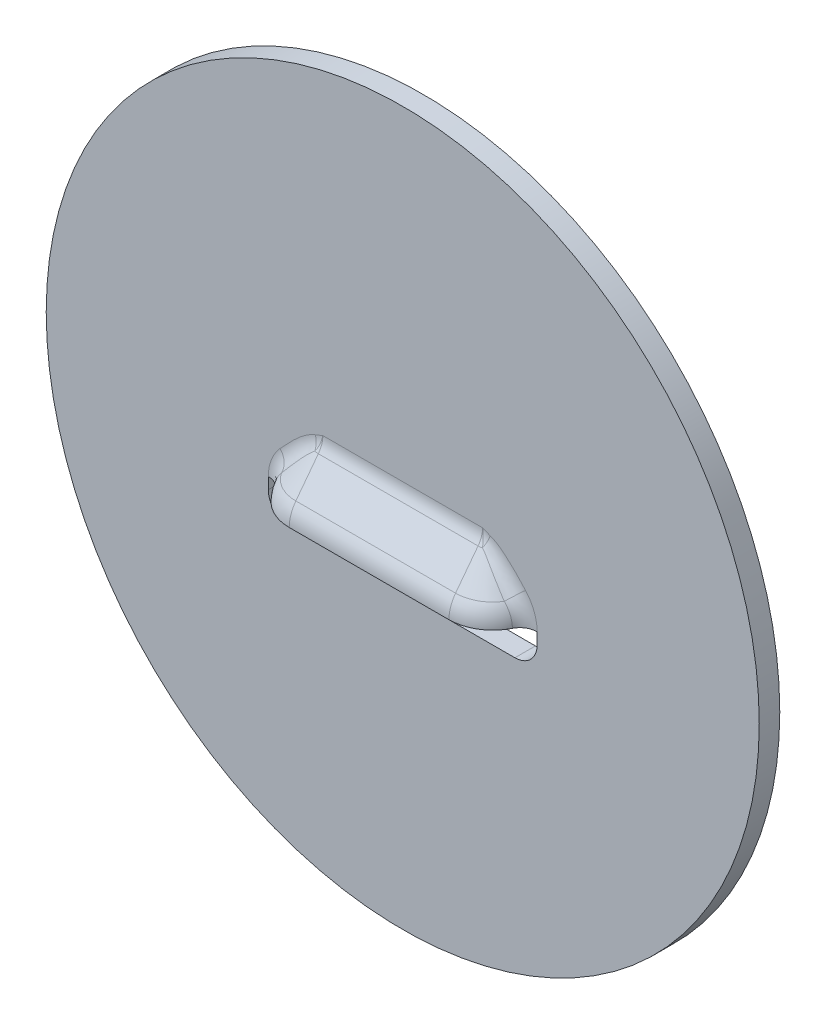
ISO-10303-21;
HEADER;
FILE_DESCRIPTION(('STEP AP214'),'2;1');
FILE_NAME('part.step','',(''),(''),'','','');
FILE_SCHEMA(('AUTOMOTIVE_DESIGN { 1 0 10303 214 1 1 1 1 }'));
ENDSEC;
DATA;
#1=APPLICATION_CONTEXT('core data for automotive mechanical design processes');
#2=APPLICATION_PROTOCOL_DEFINITION('international standard','automotive_design',2000,#1);
#3=PRODUCT_CONTEXT('',#1,'mechanical');
#4=PRODUCT('Part','Part','',(#3));
#5=PRODUCT_RELATED_PRODUCT_CATEGORY('part','',(#4));
#6=PRODUCT_DEFINITION_FORMATION('','',#4);
#7=PRODUCT_DEFINITION_CONTEXT('part definition',#1,'design');
#8=PRODUCT_DEFINITION('design','',#6,#7);
#9=PRODUCT_DEFINITION_SHAPE('','',#8);
#10=(LENGTH_UNIT() NAMED_UNIT(*) SI_UNIT(.MILLI.,.METRE.));
#11=(NAMED_UNIT(*) PLANE_ANGLE_UNIT() SI_UNIT($,.RADIAN.));
#12=(NAMED_UNIT(*) SI_UNIT($,.STERADIAN.) SOLID_ANGLE_UNIT());
#13=UNCERTAINTY_MEASURE_WITH_UNIT(LENGTH_MEASURE(1.E-05),#10,'distance_accuracy_value','');
#14=(GEOMETRIC_REPRESENTATION_CONTEXT(3) GLOBAL_UNCERTAINTY_ASSIGNED_CONTEXT((#13)) GLOBAL_UNIT_ASSIGNED_CONTEXT((#10,
#11,#12)) REPRESENTATION_CONTEXT('',''));
#15=CARTESIAN_POINT('',(0.,0.,0.));
#16=DIRECTION('',(0.,0.,1.));
#17=DIRECTION('',(1.,0.,0.));
#18=AXIS2_PLACEMENT_3D('',#15,#16,#17);
#19=CARTESIAN_POINT('',(9.54098913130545,-2.794,0.762));
#20=DIRECTION('',(0.,1.,0.));
#21=DIRECTION('',(0.851057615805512,0.,-0.52507231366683));
#22=AXIS2_PLACEMENT_3D('',#19,#20,#21);
#23=PLANE('',#22);
#24=CARTESIAN_POINT('',(9.54098913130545,-2.794,0.762));
#25=DIRECTION('',(0.,-1.,0.));
#26=DIRECTION('',(0.,0.,-1.));
#27=AXIS2_PLACEMENT_3D('',#24,#25,#26);
#28=CIRCLE('',#27,0.762);
#29=CARTESIAN_POINT('',(9.54098913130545,-2.794,0.));
#30=VERTEX_POINT('',#29);
#31=CARTESIAN_POINT('',(8.85996414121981,-2.794,0.420168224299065));
#32=VERTEX_POINT('',#31);
#33=EDGE_CURVE('E674',#30,#32,#28,.F.);
#34=ORIENTED_EDGE('',*,*,#33,.T.);
#35=CARTESIAN_POINT('',(7.112,-2.794,-0.4572));
#36=DIRECTION('',(0.,1.,0.));
#37=DIRECTION('',(0.,0.,1.));
#38=AXIS2_PLACEMENT_3D('',#35,#36,#37);
#39=CIRCLE('',#38,1.9558);
#40=CARTESIAN_POINT('',(7.112,-2.794,1.4986));
#41=VERTEX_POINT('',#40);
#42=EDGE_CURVE('E613',#41,#32,#39,.T.);
#43=ORIENTED_EDGE('',*,*,#42,.F.);
#44=DIRECTION('',(-1.,0.,0.));
#45=VECTOR('',#44,1.);
#46=CARTESIAN_POINT('',(7.112,-2.794,1.4986));
#47=LINE('',#46,#45);
#48=CARTESIAN_POINT('',(0.,-2.794,1.4986));
#49=VERTEX_POINT('',#48);
#50=EDGE_CURVE('E223',#41,#49,#47,.T.);
#51=ORIENTED_EDGE('',*,*,#50,.T.);
#52=CARTESIAN_POINT('',(0.,-2.794,-0.4572));
#53=DIRECTION('',(0.,-1.,0.));
#54=DIRECTION('',(0.,0.,1.));
#55=AXIS2_PLACEMENT_3D('',#52,#53,#54);
#56=CIRCLE('',#55,1.9558);
#57=CARTESIAN_POINT('',(-1.74796414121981,-2.794,0.420168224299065));
#58=VERTEX_POINT('',#57);
#59=EDGE_CURVE('E233',#49,#58,#56,.T.);
#60=ORIENTED_EDGE('',*,*,#59,.T.);
#61=CARTESIAN_POINT('',(-2.42898913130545,-2.794,0.762));
#62=DIRECTION('',(0.,-1.,0.));
#63=DIRECTION('',(0.,0.,-1.));
#64=AXIS2_PLACEMENT_3D('',#61,#62,#63);
#65=CIRCLE('',#64,0.762);
#66=CARTESIAN_POINT('',(-2.42898913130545,-2.794,0.));
#67=VERTEX_POINT('',#66);
#68=EDGE_CURVE('E495',#58,#67,#65,.F.);
#69=ORIENTED_EDGE('',*,*,#68,.T.);
#70=DIRECTION('',(0.,0.,1.));
#71=VECTOR('',#70,1.);
#72=CARTESIAN_POINT('',(-2.42898913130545,-2.794,0.));
#73=LINE('',#72,#71);
#74=CARTESIAN_POINT('',(-2.42898913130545,-2.794,-0.9144));
#75=VERTEX_POINT('',#74);
#76=EDGE_CURVE('E424',#75,#67,#73,.T.);
#77=ORIENTED_EDGE('',*,*,#76,.F.);
#78=CARTESIAN_POINT('',(-2.42898913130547,-2.794,0.762));
#79=DIRECTION('',(0.,1.,0.));
#80=DIRECTION('',(-1.,0.,0.));
#81=AXIS2_PLACEMENT_3D('',#78,#79,#80);
#82=CIRCLE('',#81,1.6764);
#83=CARTESIAN_POINT('',(-0.930734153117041,-2.794,0.00997009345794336));
#84=VERTEX_POINT('',#83);
#85=EDGE_CURVE('E352',#84,#75,#82,.T.);
#86=ORIENTED_EDGE('',*,*,#85,.F.);
#87=CARTESIAN_POINT('',(0.,-2.794,-0.4572));
#88=DIRECTION('',(0.,1.,0.));
#89=DIRECTION('',(0.,0.,1.));
#90=AXIS2_PLACEMENT_3D('',#87,#88,#89);
#91=CIRCLE('',#90,1.0414);
#92=CARTESIAN_POINT('',(0.,-2.794,0.5842));
#93=VERTEX_POINT('',#92);
#94=EDGE_CURVE('E452',#93,#84,#91,.F.);
#95=ORIENTED_EDGE('',*,*,#94,.F.);
#96=DIRECTION('',(-1.,0.,0.));
#97=VECTOR('',#96,1.);
#98=CARTESIAN_POINT('',(7.112,-2.794,0.5842));
#99=LINE('',#98,#97);
#100=CARTESIAN_POINT('',(7.112,-2.794,0.5842));
#101=VERTEX_POINT('',#100);
#102=EDGE_CURVE('E619',#101,#93,#99,.T.);
#103=ORIENTED_EDGE('',*,*,#102,.F.);
#104=CARTESIAN_POINT('',(7.112,-2.794,-0.4572));
#105=DIRECTION('',(0.,1.,0.));
#106=DIRECTION('',(0.,0.,1.));
#107=AXIS2_PLACEMENT_3D('',#104,#105,#106);
#108=CIRCLE('',#107,1.0414);
#109=CARTESIAN_POINT('',(8.04273415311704,-2.794,0.00997009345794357));
#110=VERTEX_POINT('',#109);
#111=EDGE_CURVE('E768',#101,#110,#108,.T.);
#112=ORIENTED_EDGE('',*,*,#111,.T.);
#113=CARTESIAN_POINT('',(9.54098913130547,-2.794,0.762));
#114=DIRECTION('',(0.,1.,0.));
#115=DIRECTION('',(-1.,0.,0.));
#116=AXIS2_PLACEMENT_3D('',#113,#114,#115);
#117=CIRCLE('',#116,1.6764);
#118=CARTESIAN_POINT('',(9.54098913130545,-2.794,-0.9144));
#119=VERTEX_POINT('',#118);
#120=EDGE_CURVE('E608',#119,#110,#117,.T.);
#121=ORIENTED_EDGE('',*,*,#120,.F.);
#122=DIRECTION('',(0.,0.,1.));
#123=VECTOR('',#122,1.);
#124=CARTESIAN_POINT('',(9.54098913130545,-2.794,0.));
#125=LINE('',#124,#123);
#126=EDGE_CURVE('E420',#119,#30,#125,.T.);
#127=ORIENTED_EDGE('',*,*,#126,.T.);
#128=EDGE_LOOP('',(#34,#43,#51,#60,#69,#77,#86,#95,#103,#112,#121,#127));
#129=FACE_BOUND('',#128,.T.);
#130=ADVANCED_FACE('F43',(#129),#23,.F.);
#131=CARTESIAN_POINT('',(9.54098913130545,-4.2926,0.));
#132=DIRECTION('',(1.,0.,0.));
#133=DIRECTION('',(0.,1.,0.));
#134=AXIS2_PLACEMENT_3D('',#131,#132,#133);
#135=PLANE('',#134);
#136=DIRECTION('',(0.,1.,0.));
#137=VECTOR('',#136,1.);
#138=CARTESIAN_POINT('',(9.54098913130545,-1.397,-0.9144));
#139=LINE('',#138,#137);
#140=CARTESIAN_POINT('',(9.54098913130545,-3.302,-0.9144));
#141=VERTEX_POINT('',#140);
#142=EDGE_CURVE('E763',#141,#119,#139,.T.);
#143=ORIENTED_EDGE('',*,*,#142,.F.);
#144=DIRECTION('',(0.,0.,-1.));
#145=VECTOR('',#144,1.);
#146=CARTESIAN_POINT('',(9.54098913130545,-3.302,0.));
#147=LINE('',#146,#145);
#148=CARTESIAN_POINT('',(9.54098913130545,-3.302,0.));
#149=VERTEX_POINT('',#148);
#150=EDGE_CURVE('E423',#141,#149,#147,.F.);
#151=ORIENTED_EDGE('',*,*,#150,.T.);
#152=DIRECTION('',(0.,1.,0.));
#153=VECTOR('',#152,1.);
#154=CARTESIAN_POINT('',(9.54098913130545,-4.2926,0.));
#155=LINE('',#154,#153);
#156=EDGE_CURVE('E995',#149,#30,#155,.T.);
#157=ORIENTED_EDGE('',*,*,#156,.T.);
#158=ORIENTED_EDGE('',*,*,#126,.F.);
#159=EDGE_LOOP('',(#143,#151,#157,#158));
#160=FACE_BOUND('',#159,.T.);
#161=ADVANCED_FACE('F1125',(#160),#135,.F.);
#162=CARTESIAN_POINT('',(0.,-4.2926,0.));
#163=DIRECTION('',(0.,-1.,0.));
#164=DIRECTION('',(1.,0.,0.));
#165=AXIS2_PLACEMENT_3D('',#162,#163,#164);
#166=PLANE('',#165);
#167=DIRECTION('',(1.,0.,0.));
#168=VECTOR('',#167,1.);
#169=CARTESIAN_POINT('',(0.,-4.2926,0.));
#170=LINE('',#169,#168);
#171=CARTESIAN_POINT('',(-1.43838913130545,-4.2926,0.));
#172=VERTEX_POINT('',#171);
#173=CARTESIAN_POINT('',(8.55038913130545,-4.2926,0.));
#174=VERTEX_POINT('',#173);
#175=EDGE_CURVE('E866',#172,#174,#170,.T.);
#176=ORIENTED_EDGE('',*,*,#175,.T.);
#177=DIRECTION('',(0.,0.,-1.));
#178=VECTOR('',#177,1.);
#179=CARTESIAN_POINT('',(8.55038913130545,-4.2926,-0.9144));
#180=LINE('',#179,#178);
#181=CARTESIAN_POINT('',(8.55038913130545,-4.2926,-0.9144));
#182=VERTEX_POINT('',#181);
#183=EDGE_CURVE('E1148',#174,#182,#180,.T.);
#184=ORIENTED_EDGE('',*,*,#183,.T.);
#185=DIRECTION('',(1.,0.,0.));
#186=VECTOR('',#185,1.);
#187=CARTESIAN_POINT('',(3.556,-4.2926,-0.9144));
#188=LINE('',#187,#186);
#189=CARTESIAN_POINT('',(-1.43838913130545,-4.2926,-0.9144));
#190=VERTEX_POINT('',#189);
#191=EDGE_CURVE('E687',#190,#182,#188,.T.);
#192=ORIENTED_EDGE('',*,*,#191,.F.);
#193=DIRECTION('',(0.,0.,-1.));
#194=VECTOR('',#193,1.);
#195=CARTESIAN_POINT('',(-1.43838913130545,-4.2926,0.));
#196=LINE('',#195,#194);
#197=EDGE_CURVE('E1156',#190,#172,#196,.F.);
#198=ORIENTED_EDGE('',*,*,#197,.T.);
#199=EDGE_LOOP('',(#176,#184,#192,#198));
#200=FACE_BOUND('',#199,.T.);
#201=ADVANCED_FACE('F1131',(#200),#166,.F.);
#202=CARTESIAN_POINT('',(-2.42898913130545,-2.794,0.));
#203=DIRECTION('',(-1.,0.,0.));
#204=DIRECTION('',(0.,-1.,0.));
#205=AXIS2_PLACEMENT_3D('',#202,#203,#204);
#206=PLANE('',#205);
#207=DIRECTION('',(0.,-1.,0.));
#208=VECTOR('',#207,1.);
#209=CARTESIAN_POINT('',(-2.42898913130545,-2.794,0.));
#210=LINE('',#209,#208);
#211=CARTESIAN_POINT('',(-2.42898913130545,-3.302,0.));
#212=VERTEX_POINT('',#211);
#213=EDGE_CURVE('E862',#67,#212,#210,.T.);
#214=ORIENTED_EDGE('',*,*,#213,.T.);
#215=DIRECTION('',(0.,0.,-1.));
#216=VECTOR('',#215,1.);
#217=CARTESIAN_POINT('',(-2.42898913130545,-3.302,-0.9144));
#218=LINE('',#217,#216);
#219=CARTESIAN_POINT('',(-2.42898913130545,-3.302,-0.9144));
#220=VERTEX_POINT('',#219);
#221=EDGE_CURVE('E64',#212,#220,#218,.T.);
#222=ORIENTED_EDGE('',*,*,#221,.T.);
#223=DIRECTION('',(0.,1.,0.));
#224=VECTOR('',#223,1.);
#225=CARTESIAN_POINT('',(-2.42898913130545,-1.397,-0.9144));
#226=LINE('',#225,#224);
#227=EDGE_CURVE('E684',#75,#220,#226,.F.);
#228=ORIENTED_EDGE('',*,*,#227,.F.);
#229=ORIENTED_EDGE('',*,*,#76,.T.);
#230=EDGE_LOOP('',(#214,#222,#228,#229));
#231=FACE_BOUND('',#230,.T.);
#232=ADVANCED_FACE('F861',(#231),#206,.F.);
#233=CARTESIAN_POINT('',(3.556,-1.397,0.));
#234=DIRECTION('',(0.,0.,1.));
#235=DIRECTION('',(1.,0.,0.));
#236=AXIS2_PLACEMENT_3D('',#233,#234,#235);
#237=CYLINDRICAL_SURFACE('',#236,15.875);
#238=CARTESIAN_POINT('',(3.556,-1.397,0.));
#239=DIRECTION('',(0.,0.,1.));
#240=DIRECTION('',(1.,0.,0.));
#241=AXIS2_PLACEMENT_3D('',#238,#239,#240);
#242=CIRCLE('',#241,15.875);
#243=CARTESIAN_POINT('',(19.431,-1.397,0.));
#244=VERTEX_POINT('',#243);
#245=EDGE_CURVE('E1163',#244,#244,#242,.T.);
#246=ORIENTED_EDGE('',*,*,#245,.F.);
#247=EDGE_LOOP('',(#246));
#248=FACE_BOUND('',#247,.T.);
#249=CARTESIAN_POINT('',(3.556,-1.397,-0.9144));
#250=DIRECTION('',(0.,0.,1.));
#251=DIRECTION('',(1.,0.,0.));
#252=AXIS2_PLACEMENT_3D('',#249,#250,#251);
#253=CIRCLE('',#252,15.875);
#254=CARTESIAN_POINT('',(19.431,-1.397,-0.9144));
#255=VERTEX_POINT('',#254);
#256=EDGE_CURVE('E765',#255,#255,#253,.T.);
#257=ORIENTED_EDGE('',*,*,#256,.T.);
#258=EDGE_LOOP('',(#257));
#259=FACE_BOUND('',#258,.T.);
#260=ADVANCED_FACE('F394',(#248,#259),#237,.T.);
#261=CARTESIAN_POINT('',(7.112,0.,-0.4572));
#262=DIRECTION('',(0.,1.,0.));
#263=DIRECTION('',(0.,0.,1.));
#264=AXIS2_PLACEMENT_3D('',#261,#262,#263);
#265=TOROIDAL_SURFACE('',#264,1.4478,0.9906);
#266=CARTESIAN_POINT('',(7.112,-0.599187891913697,-0.4572));
#267=DIRECTION('',(0.,1.,0.));
#268=DIRECTION('',(0.,0.,1.));
#269=AXIS2_PLACEMENT_3D('',#266,#267,#268);
#270=CIRCLE('',#269,0.658964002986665);
#271=CARTESIAN_POINT('',(7.112,-0.599187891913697,0.201764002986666));
#272=VERTEX_POINT('',#271);
#273=CARTESIAN_POINT('',(7.28908451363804,-0.599187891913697,0.177524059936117));
#274=VERTEX_POINT('',#273);
#275=EDGE_CURVE('E931',#272,#274,#270,.T.);
#276=ORIENTED_EDGE('',*,*,#275,.T.);
#277=CARTESIAN_POINT('',(7.39960661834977,-0.764422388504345,0.308318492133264));
#278=CARTESIAN_POINT('',(7.46321663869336,-0.544979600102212,0.));
#279=CARTESIAN_POINT('',(7.57005554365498,-0.176405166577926,0.));
#280=CARTESIAN_POINT('',(7.37804468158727,-0.739487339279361,0.284106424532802));
#281=CARTESIAN_POINT('',(7.44461269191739,-0.520110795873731,0.));
#282=CARTESIAN_POINT('',(7.55020781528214,-0.170650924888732,0.));
#283=CARTESIAN_POINT('',(7.35815518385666,-0.713094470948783,0.261007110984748));
#284=CARTESIAN_POINT('',(7.42669431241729,-0.495404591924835,0.));
#285=CARTESIAN_POINT('',(7.53046114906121,-0.164560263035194,0.));
#286=CARTESIAN_POINT('',(7.32142087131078,-0.657864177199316,0.217320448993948));
#287=CARTESIAN_POINT('',(7.39236363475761,-0.446827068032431,0.));
#288=CARTESIAN_POINT('',(7.49116552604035,-0.15181481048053,0.));
#289=CARTESIAN_POINT('',(7.30457392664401,-0.629028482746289,0.196731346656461));
#290=CARTESIAN_POINT('',(7.37588541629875,-0.422885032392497,0.));
#291=CARTESIAN_POINT('',(7.47161644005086,-0.145160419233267,0.));
#292=CARTESIAN_POINT('',(7.2440563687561,-0.512440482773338,0.121687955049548));
#293=CARTESIAN_POINT('',(7.31457536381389,-0.331902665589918,0.));
#294=CARTESIAN_POINT('',(7.39556083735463,-0.118255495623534,0.));
#295=CARTESIAN_POINT('',(7.21050046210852,-0.417200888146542,0.0775293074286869));
#296=CARTESIAN_POINT('',(7.27234494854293,-0.265128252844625,0.));
#297=CARTESIAN_POINT('',(7.33967068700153,-0.0962771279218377,0.));
#298=CARTESIAN_POINT('',(7.15600888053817,-0.218702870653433,0.0172844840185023));
#299=CARTESIAN_POINT('',(7.19264415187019,-0.13537295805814,0.));
#300=CARTESIAN_POINT('',(7.22865160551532,-0.0504698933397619,0.));
#301=CARTESIAN_POINT('',(7.13508073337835,-0.115439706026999,0.00121504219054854));
#302=CARTESIAN_POINT('',(7.15431375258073,-0.0710691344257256,0.));
#303=CARTESIAN_POINT('',(7.17352314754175,-0.0266399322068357,0.));
#304=CARTESIAN_POINT('',(7.11400280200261,-0.0100203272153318,4.4410875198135E-05));
#305=CARTESIAN_POINT('',(7.11567153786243,-0.00616646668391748,0.));
#306=CARTESIAN_POINT('',(7.11734034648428,-0.00231238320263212,0.));
#307=CARTESIAN_POINT('',(7.1136021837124,-0.00801614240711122,2.77597891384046E-05));
#308=CARTESIAN_POINT('',(7.11493720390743,-0.00493306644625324,0.));
#309=CARTESIAN_POINT('',(7.11627226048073,-0.00184987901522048,0.));
#310=CARTESIAN_POINT('',(7.1128010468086,-0.00400792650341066,5.57011694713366E-06));
#311=CARTESIAN_POINT('',(7.11346858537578,-0.00246642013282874,0.));
#312=CARTESIAN_POINT('',(7.11413612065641,-0.000924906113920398,0.));
#313=CARTESIAN_POINT('',(7.11240052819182,-0.0020038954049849,3.11142979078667E-08));
#314=CARTESIAN_POINT('',(7.11273429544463,-0.00123316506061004,0.));
#315=CARTESIAN_POINT('',(7.11306806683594,-0.000462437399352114,0.));
#316=CARTESIAN_POINT('',(7.112,0.,0.));
#317=CARTESIAN_POINT('',(7.112,0.,0.));
#318=CARTESIAN_POINT('',(7.112,0.,0.));
#319=(BOUNDED_SURFACE() B_SPLINE_SURFACE(3,2,((#277,#278,#279),(#280,#281,#282),(#283,#284,
#285),(#286,#287,#288),(#289,#290,#291),(#292,#293,#294),(#295,#296,#297),(#298,#299,#300),
(#301,#302,#303),(#304,#305,#306),(#307,#308,#309),(#310,#311,#312),(#313,#314,#315),(#316,#317,
#318)),.UNSPECIFIED.,.F.,.F.,.F.) B_SPLINE_SURFACE_WITH_KNOTS((4,2,2,2,2,2,4),(3,3),(0.,
0.0619872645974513,0.123930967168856,0.304002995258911,0.484182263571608,0.487674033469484,
0.491165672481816),(0.,1.),
.UNSPECIFIED.) GEOMETRIC_REPRESENTATION_ITEM() RATIONAL_B_SPLINE_SURFACE(((1.,0.893135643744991,
1.),(1.,0.902029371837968,1.),(1.,0.910382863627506,1.),(1.,0.925992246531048,1.),(1.,
0.933248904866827,1.),(1.,0.959447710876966,1.),(1.,0.97428373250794,1.),(1.,0.994363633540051,
1.),(1.,0.999601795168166,1.),(1.,0.999985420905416,1.),(1.,0.999990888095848,1.),(1.,
0.999998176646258,1.),(1.,0.999999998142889,1.),(1.,1.,1.))) REPRESENTATION_ITEM('') SURFACE());
#320=CARTESIAN_POINT('',(7.39960661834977,-0.764422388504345,0.308318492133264));
#321=CARTESIAN_POINT('',(7.37804468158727,-0.739487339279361,0.284106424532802));
#322=CARTESIAN_POINT('',(7.35815518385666,-0.713094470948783,0.261007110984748));
#323=CARTESIAN_POINT('',(7.32142087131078,-0.657864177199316,0.217320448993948));
#324=CARTESIAN_POINT('',(7.30457392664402,-0.629028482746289,0.196731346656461));
#325=CARTESIAN_POINT('',(7.2440563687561,-0.512440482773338,0.121687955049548));
#326=CARTESIAN_POINT('',(7.21050046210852,-0.417200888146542,0.0775293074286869));
#327=CARTESIAN_POINT('',(7.15600888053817,-0.218702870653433,0.0172844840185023));
#328=CARTESIAN_POINT('',(7.13508073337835,-0.115439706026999,0.00121504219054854));
#329=CARTESIAN_POINT('',(7.11400280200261,-0.0100203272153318,4.4410875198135E-05));
#330=CARTESIAN_POINT('',(7.1136021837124,-0.00801614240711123,2.77597891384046E-05));
#331=CARTESIAN_POINT('',(7.1128010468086,-0.00400792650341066,5.57011694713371E-06));
#332=CARTESIAN_POINT('',(7.11240052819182,-0.0020038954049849,3.11142979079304E-08));
#333=CARTESIAN_POINT('',(7.112,0.,0.));
#334=B_SPLINE_CURVE_WITH_KNOTS('',3,(#320,#321,#322,#323,#324,#325,#326,#327,#328,#329,#330,
#331,#332,#333),.UNSPECIFIED.,.F.,.F.,(4,2,2,2,2,2,4),(0.,0.0619872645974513,0.123930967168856,
0.304002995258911,0.484182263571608,0.487674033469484,0.491165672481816),.UNSPECIFIED.);
#335=CARTESIAN_POINT('',(7.112,0.,0.));
#336=VERTEX_POINT('',#335);
#337=EDGE_CURVE('E412',#274,#336,#334,.T.);
#338=ORIENTED_EDGE('',*,*,#337,.T.);
#339=CARTESIAN_POINT('',(7.112,0.,0.));
#340=CARTESIAN_POINT('',(7.112,-0.0134062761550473,-1.60971222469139E-07));
#341=CARTESIAN_POINT('',(7.112,-0.0268125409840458,0.000272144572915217));
#342=CARTESIAN_POINT('',(7.112,-0.053602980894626,0.00136053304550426));
#343=CARTESIAN_POINT('',(7.112,-0.0669871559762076,0.00217661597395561));
#344=CARTESIAN_POINT('',(7.112,-0.0937113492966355,0.00435140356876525));
#345=CARTESIAN_POINT('',(7.112,-0.107051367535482,0.00571010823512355));
#346=CARTESIAN_POINT('',(7.112,-0.133665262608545,0.00896784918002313));
#347=CARTESIAN_POINT('',(7.112,-0.146939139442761,0.0108668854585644));
#348=CARTESIAN_POINT('',(7.112,-0.173398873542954,0.0152021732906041));
#349=CARTESIAN_POINT('',(7.112,-0.186584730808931,0.0176384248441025));
#350=CARTESIAN_POINT('',(7.112,-0.21284669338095,0.0230441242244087));
#351=CARTESIAN_POINT('',(7.112,-0.225922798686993,0.0260135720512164));
#352=CARTESIAN_POINT('',(7.112,-0.251943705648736,0.0324807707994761));
#353=CARTESIAN_POINT('',(7.112,-0.264888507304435,0.035978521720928));
#354=CARTESIAN_POINT('',(7.112,-0.290625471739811,0.0434965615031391));
#355=CARTESIAN_POINT('',(7.112,-0.303417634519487,0.0475168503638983));
#356=CARTESIAN_POINT('',(7.112,-0.328828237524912,0.0560733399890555));
#357=CARTESIAN_POINT('',(7.112,-0.341446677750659,0.0606095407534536));
#358=CARTESIAN_POINT('',(7.112,-0.366489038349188,0.0701903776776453));
#359=CARTESIAN_POINT('',(7.112,-0.37891295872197,0.0752350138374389));
#360=CARTESIAN_POINT('',(7.112,-0.403545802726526,0.0858244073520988));
#361=CARTESIAN_POINT('',(7.112,-0.415754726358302,0.0913691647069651));
#362=CARTESIAN_POINT('',(7.112,-0.439937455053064,0.102949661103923));
#363=CARTESIAN_POINT('',(7.112,-0.45191126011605,0.108985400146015));
#364=CARTESIAN_POINT('',(7.112,-0.47560401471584,0.12153791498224));
#365=CARTESIAN_POINT('',(7.112,-0.487322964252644,0.128054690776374));
#366=CARTESIAN_POINT('',(7.112,-0.51048670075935,0.141558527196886));
#367=CARTESIAN_POINT('',(7.112,-0.521931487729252,0.148545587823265));
#368=CARTESIAN_POINT('',(7.112,-0.544528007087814,0.162978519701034));
#369=CARTESIAN_POINT('',(7.112,-0.555679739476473,0.170424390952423));
#370=CARTESIAN_POINT('',(7.112,-0.577671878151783,0.1857625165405));
#371=CARTESIAN_POINT('',(7.112,-0.588512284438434,0.193654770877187));
#372=CARTESIAN_POINT('',(7.112,-0.599187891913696,0.201764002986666));
#373=B_SPLINE_CURVE_WITH_KNOTS('',3,(#339,#340,#341,#342,#343,#344,#345,#346,#347,#348,#349,
#350,#351,#352,#353,#354,#355,#356,#357,#358,#359,#360,#361,#362,#363,#364,#365,#366,#367,#368,
#369,#370,#371,#372),.UNSPECIFIED.,.F.,.F.,(4,2,2,2,2,2,2,2,2,2,2,2,2,2,2,2,4),(0.,
0.0402160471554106,0.0804320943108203,0.12064814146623,0.160864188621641,0.201080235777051,
0.241296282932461,0.281512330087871,0.321728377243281,0.361944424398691,0.402160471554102,
0.442376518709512,0.482592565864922,0.522808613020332,0.563024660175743,0.603240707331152,
0.643456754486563),.UNSPECIFIED.);
#374=EDGE_CURVE('E426',#336,#272,#373,.T.);
#375=ORIENTED_EDGE('',*,*,#374,.T.);
#376=EDGE_LOOP('',(#276,#338,#375));
#377=FACE_BOUND('',#376,.T.);
#378=ADVANCED_FACE('F389',(#377),#265,.F.);
#379=CARTESIAN_POINT('',(7.39960661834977,-0.764422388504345,0.308318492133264));
#380=CARTESIAN_POINT('',(7.46321663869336,-0.544979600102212,0.));
#381=CARTESIAN_POINT('',(7.57005554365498,-0.176405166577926,0.));
#382=CARTESIAN_POINT('',(7.37804468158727,-0.739487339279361,0.284106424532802));
#383=CARTESIAN_POINT('',(7.44461269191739,-0.520110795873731,0.));
#384=CARTESIAN_POINT('',(7.55020781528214,-0.170650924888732,0.));
#385=CARTESIAN_POINT('',(7.35815518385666,-0.713094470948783,0.261007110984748));
#386=CARTESIAN_POINT('',(7.42669431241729,-0.495404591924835,0.));
#387=CARTESIAN_POINT('',(7.53046114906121,-0.164560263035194,0.));
#388=CARTESIAN_POINT('',(7.32142087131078,-0.657864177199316,0.217320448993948));
#389=CARTESIAN_POINT('',(7.39236363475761,-0.446827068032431,0.));
#390=CARTESIAN_POINT('',(7.49116552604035,-0.15181481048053,0.));
#391=CARTESIAN_POINT('',(7.30457392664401,-0.629028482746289,0.196731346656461));
#392=CARTESIAN_POINT('',(7.37588541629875,-0.422885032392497,0.));
#393=CARTESIAN_POINT('',(7.47161644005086,-0.145160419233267,0.));
#394=CARTESIAN_POINT('',(7.2440563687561,-0.512440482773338,0.121687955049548));
#395=CARTESIAN_POINT('',(7.31457536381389,-0.331902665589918,0.));
#396=CARTESIAN_POINT('',(7.39556083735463,-0.118255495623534,0.));
#397=CARTESIAN_POINT('',(7.21050046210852,-0.417200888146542,0.0775293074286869));
#398=CARTESIAN_POINT('',(7.27234494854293,-0.265128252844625,0.));
#399=CARTESIAN_POINT('',(7.33967068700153,-0.0962771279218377,0.));
#400=CARTESIAN_POINT('',(7.15600888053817,-0.218702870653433,0.0172844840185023));
#401=CARTESIAN_POINT('',(7.19264415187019,-0.13537295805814,0.));
#402=CARTESIAN_POINT('',(7.22865160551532,-0.0504698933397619,0.));
#403=CARTESIAN_POINT('',(7.13508073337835,-0.115439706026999,0.00121504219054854));
#404=CARTESIAN_POINT('',(7.15431375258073,-0.0710691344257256,0.));
#405=CARTESIAN_POINT('',(7.17352314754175,-0.0266399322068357,0.));
#406=CARTESIAN_POINT('',(7.11400280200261,-0.0100203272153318,4.4410875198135E-05));
#407=CARTESIAN_POINT('',(7.11567153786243,-0.00616646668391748,0.));
#408=CARTESIAN_POINT('',(7.11734034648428,-0.00231238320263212,0.));
#409=CARTESIAN_POINT('',(7.1136021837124,-0.00801614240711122,2.77597891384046E-05));
#410=CARTESIAN_POINT('',(7.11493720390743,-0.00493306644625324,0.));
#411=CARTESIAN_POINT('',(7.11627226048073,-0.00184987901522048,0.));
#412=CARTESIAN_POINT('',(7.1128010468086,-0.00400792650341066,5.57011694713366E-06));
#413=CARTESIAN_POINT('',(7.11346858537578,-0.00246642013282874,0.));
#414=CARTESIAN_POINT('',(7.11413612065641,-0.000924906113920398,0.));
#415=CARTESIAN_POINT('',(7.11240052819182,-0.0020038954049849,3.11142979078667E-08));
#416=CARTESIAN_POINT('',(7.11273429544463,-0.00123316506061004,0.));
#417=CARTESIAN_POINT('',(7.11306806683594,-0.000462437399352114,0.));
#418=CARTESIAN_POINT('',(7.112,0.,0.));
#419=CARTESIAN_POINT('',(7.112,0.,0.));
#420=CARTESIAN_POINT('',(7.112,0.,0.));
#421=(BOUNDED_SURFACE() B_SPLINE_SURFACE(3,2,((#379,#380,#381),(#382,#383,#384),(#385,#386,
#387),(#388,#389,#390),(#391,#392,#393),(#394,#395,#396),(#397,#398,#399),(#400,#401,#402),
(#403,#404,#405),(#406,#407,#408),(#409,#410,#411),(#412,#413,#414),(#415,#416,#417),(#418,#419,
#420)),.UNSPECIFIED.,.F.,.F.,.F.) B_SPLINE_SURFACE_WITH_KNOTS((4,2,2,2,2,2,4),(3,3),(0.,
0.0619872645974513,0.123930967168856,0.304002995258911,0.484182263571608,0.487674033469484,
0.491165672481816),(0.,1.),
.UNSPECIFIED.) GEOMETRIC_REPRESENTATION_ITEM() RATIONAL_B_SPLINE_SURFACE(((1.,0.893135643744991,
1.),(1.,0.902029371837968,1.),(1.,0.910382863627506,1.),(1.,0.925992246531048,1.),(1.,
0.933248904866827,1.),(1.,0.959447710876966,1.),(1.,0.97428373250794,1.),(1.,0.994363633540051,
1.),(1.,0.999601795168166,1.),(1.,0.999985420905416,1.),(1.,0.999990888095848,1.),(1.,
0.999998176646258,1.),(1.,0.999999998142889,1.),(1.,1.,1.))) REPRESENTATION_ITEM('') SURFACE());
#422=CARTESIAN_POINT('',(7.57005554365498,-0.176405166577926,0.));
#423=CARTESIAN_POINT('',(7.55020781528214,-0.170650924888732,0.));
#424=CARTESIAN_POINT('',(7.53046114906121,-0.164560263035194,0.));
#425=CARTESIAN_POINT('',(7.49116552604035,-0.15181481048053,0.));
#426=CARTESIAN_POINT('',(7.47161644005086,-0.145160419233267,0.));
#427=CARTESIAN_POINT('',(7.39556083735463,-0.118255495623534,0.));
#428=CARTESIAN_POINT('',(7.33967068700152,-0.0962771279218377,0.));
#429=CARTESIAN_POINT('',(7.22865160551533,-0.0504698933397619,0.));
#430=CARTESIAN_POINT('',(7.17352314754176,-0.0266399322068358,0.));
#431=CARTESIAN_POINT('',(7.11734034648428,-0.00231238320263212,0.));
#432=CARTESIAN_POINT('',(7.11627226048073,-0.00184987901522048,0.));
#433=CARTESIAN_POINT('',(7.11413612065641,-0.0009249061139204,0.));
#434=CARTESIAN_POINT('',(7.11306806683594,-0.000462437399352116,0.));
#435=CARTESIAN_POINT('',(7.112,0.,0.));
#436=B_SPLINE_CURVE_WITH_KNOTS('',3,(#422,#423,#424,#425,#426,#427,#428,#429,#430,#431,#432,
#433,#434,#435),.UNSPECIFIED.,.F.,.F.,(4,2,2,2,2,2,4),(0.,0.0619872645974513,0.123930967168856,
0.304002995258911,0.484182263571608,0.487674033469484,0.491165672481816),.UNSPECIFIED.);
#437=CARTESIAN_POINT('',(7.45215007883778,-0.138274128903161,0.));
#438=VERTEX_POINT('',#437);
#439=EDGE_CURVE('E416',#336,#438,#436,.F.);
#440=ORIENTED_EDGE('',*,*,#439,.F.);
#441=ORIENTED_EDGE('',*,*,#337,.F.);
#442=CARTESIAN_POINT('',(7.45215007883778,-0.138274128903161,0.762));
#443=DIRECTION('',(0.942739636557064,-0.333529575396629,0.));
#444=DIRECTION('',(0.333529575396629,0.942739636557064,0.));
#445=AXIS2_PLACEMENT_3D('',#442,#443,#444);
#446=CIRCLE('',#445,0.762);
#447=EDGE_CURVE('E889',#274,#438,#446,.T.);
#448=ORIENTED_EDGE('',*,*,#447,.T.);
#449=EDGE_LOOP('',(#440,#441,#448));
#450=FACE_BOUND('',#449,.T.);
#451=ADVANCED_FACE('F393',(#450),#421,.F.);
#452=CARTESIAN_POINT('',(7.112,-0.599187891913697,-0.4572));
#453=DIRECTION('',(0.,-1.,0.));
#454=DIRECTION('',(0.,0.,-1.));
#455=AXIS2_PLACEMENT_3D('',#452,#453,#454);
#456=CONICAL_SURFACE('',#455,0.658964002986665,0.649607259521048);
#457=CARTESIAN_POINT('',(7.112,-1.91826385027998,-0.4572));
#458=DIRECTION('',(0.,1.,0.));
#459=DIRECTION('',(0.,0.,1.));
#460=AXIS2_PLACEMENT_3D('',#457,#458,#459);
#461=CIRCLE('',#460,1.66091414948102);
#462=CARTESIAN_POINT('',(7.112,-1.91826385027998,1.20371414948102));
#463=VERTEX_POINT('',#462);
#464=CARTESIAN_POINT('',(8.51244613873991,-1.91826385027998,0.435764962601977));
#465=VERTEX_POINT('',#464);
#466=EDGE_CURVE('E932',#463,#465,#461,.T.);
#467=ORIENTED_EDGE('',*,*,#466,.T.);
#468=CARTESIAN_POINT('',(10.2584540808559,-4.09043633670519,0.573161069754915));
#469=CARTESIAN_POINT('',(10.3729811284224,-3.99889773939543,0.));
#470=CARTESIAN_POINT('',(10.835118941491,-3.62952257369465,0.));
#471=CARTESIAN_POINT('',(10.1137697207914,-3.90669430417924,0.566381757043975));
#472=CARTESIAN_POINT('',(10.231511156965,-3.81306813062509,0.));
#473=CARTESIAN_POINT('',(10.6881681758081,-3.44578054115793,0.));
#474=CARTESIAN_POINT('',(9.96891385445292,-3.72327465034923,0.558992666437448));
#475=CARTESIAN_POINT('',(10.0898526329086,-3.62705942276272,0.));
#476=CARTESIAN_POINT('',(10.54080087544,-3.26236088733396,0.));
#477=CARTESIAN_POINT('',(9.67879412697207,-3.35753883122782,0.542244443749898));
#478=CARTESIAN_POINT('',(9.80611473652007,-3.25516836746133,0.));
#479=CARTESIAN_POINT('',(10.2444841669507,-2.89662506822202,0.));
#480=CARTESIAN_POINT('',(9.53353007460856,-3.17522338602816,0.532884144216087));
#481=CARTESIAN_POINT('',(9.66430525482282,-3.06963437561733,0.));
#482=CARTESIAN_POINT('',(10.0955338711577,-2.71430962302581,0.));
#483=CARTESIAN_POINT('',(9.24228399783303,-2.81185417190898,0.511418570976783));
#484=CARTESIAN_POINT('',(9.37991354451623,-2.69873870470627,0.));
#485=CARTESIAN_POINT('',(9.79504497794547,-2.3509404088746,0.));
#486=CARTESIAN_POINT('',(9.09630110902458,-2.63080551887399,0.499305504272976));
#487=CARTESIAN_POINT('',(9.23768986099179,-2.51383544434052,0.));
#488=CARTESIAN_POINT('',(9.64350018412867,-2.16989175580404,0.));
#489=CARTESIAN_POINT('',(8.80425614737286,-2.27168245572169,0.471061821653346));
#490=CARTESIAN_POINT('',(8.95258393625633,-2.14551433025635,0.));
#491=CARTESIAN_POINT('',(9.33701117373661,-1.81076869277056,0.));
#492=CARTESIAN_POINT('',(8.65819411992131,-2.09360703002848,0.45493260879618));
#493=CARTESIAN_POINT('',(8.8102191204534,-1.96273282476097,0.));
#494=CARTESIAN_POINT('',(9.18206816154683,-1.63269326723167,0.));
#495=CARTESIAN_POINT('',(8.43988510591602,-1.83096876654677,0.426222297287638));
#496=CARTESIAN_POINT('',(8.59488467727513,-1.69035409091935,0.));
#497=CARTESIAN_POINT('',(8.94543100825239,-1.37005500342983,0.));
#498=CARTESIAN_POINT('',(8.36740191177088,-1.74435089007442,0.415926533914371));
#499=CARTESIAN_POINT('',(8.52358034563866,-1.60081355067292,0.));
#500=CARTESIAN_POINT('',(8.8660243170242,-1.28343712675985,0.));
#501=CARTESIAN_POINT('',(8.2227786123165,-1.57305002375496,0.393474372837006));
#502=CARTESIAN_POINT('',(8.3804369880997,-1.42321489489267,0.));
#503=CARTESIAN_POINT('',(8.70505281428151,-1.11213626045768,0.));
#504=CARTESIAN_POINT('',(8.15063868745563,-1.48836797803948,0.381317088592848));
#505=CARTESIAN_POINT('',(8.30870927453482,-1.33527458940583,0.));
#506=CARTESIAN_POINT('',(8.62348698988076,-1.02745421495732,0.));
#507=CARTESIAN_POINT('',(8.00674200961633,-1.32156181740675,0.354739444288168));
#508=CARTESIAN_POINT('',(8.16407922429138,-1.16148214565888,0.));
#509=CARTESIAN_POINT('',(8.45690785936,-0.860648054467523,0.));
#510=CARTESIAN_POINT('',(7.93498925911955,-1.23945347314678,0.340307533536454));
#511=CARTESIAN_POINT('',(8.09130050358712,-1.07575679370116,0.));
#512=CARTESIAN_POINT('',(8.37187869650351,-0.778539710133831,0.));
#513=CARTESIAN_POINT('',(7.79298148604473,-1.08014462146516,0.309005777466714));
#514=CARTESIAN_POINT('',(7.94439930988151,-0.908784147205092,0.));
#515=CARTESIAN_POINT('',(8.19736083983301,-0.619230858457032,0.));
#516=CARTESIAN_POINT('',(7.72272506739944,-1.00293939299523,0.292138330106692));
#517=CARTESIAN_POINT('',(7.87042672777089,-0.827624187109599,0.));
#518=CARTESIAN_POINT('',(8.10787658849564,-0.542025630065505,0.));
#519=CARTESIAN_POINT('',(7.6216474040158,-0.896185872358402,0.266082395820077));
#520=CARTESIAN_POINT('',(7.75977480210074,-0.714584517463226,0.));
#521=CARTESIAN_POINT('',(7.97158251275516,-0.435272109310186,0.));
#522=CARTESIAN_POINT('',(7.58979142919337,-0.863194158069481,0.25760018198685));
#523=CARTESIAN_POINT('',(7.72447714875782,-0.679715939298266,0.));
#524=CARTESIAN_POINT('',(7.92748608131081,-0.402280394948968,0.));
#525=CARTESIAN_POINT('',(7.52681993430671,-0.799861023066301,0.240488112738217));
#526=CARTESIAN_POINT('',(7.65321224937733,-0.612683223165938,0.));
#527=CARTESIAN_POINT('',(7.83744247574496,-0.33894725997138,0.));
#528=CARTESIAN_POINT('',(7.49570400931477,-0.769518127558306,0.23185834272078));
#529=CARTESIAN_POINT('',(7.6172519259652,-0.580501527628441,0.));
#530=CARTESIAN_POINT('',(7.79149635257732,-0.308604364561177,0.));
#531=CARTESIAN_POINT('',(7.43477741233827,-0.712858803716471,0.21497985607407));
#532=CARTESIAN_POINT('',(7.54496946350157,-0.520334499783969,0.));
#533=CARTESIAN_POINT('',(7.69803116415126,-0.251945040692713,0.));
#534=CARTESIAN_POINT('',(7.40495460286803,-0.686492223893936,0.206727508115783));
#535=CARTESIAN_POINT('',(7.50865864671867,-0.492268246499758,0.));
#536=CARTESIAN_POINT('',(7.65054288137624,-0.22557846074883,0.));
#537=CARTESIAN_POINT('',(7.34629346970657,-0.638697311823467,0.19116945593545));
#538=CARTESIAN_POINT('',(7.4350599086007,-0.441360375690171,0.));
#539=CARTESIAN_POINT('',(7.55314521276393,-0.177783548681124,0.));
#540=CARTESIAN_POINT('',(7.31745382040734,-0.617262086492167,0.18386243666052));
#541=CARTESIAN_POINT('',(7.39775200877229,-0.418462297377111,0.));
#542=CARTESIAN_POINT('',(7.5032393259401,-0.156348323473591,0.));
#543=CARTESIAN_POINT('',(7.27441259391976,-0.589840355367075,0.174246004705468));
#544=CARTESIAN_POINT('',(7.34034478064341,-0.389145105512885,0.));
#545=CARTESIAN_POINT('',(7.42572795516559,-0.128926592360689,0.));
#546=CARTESIAN_POINT('',(7.25986647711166,-0.581391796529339,0.171227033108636));
#547=CARTESIAN_POINT('',(7.32065735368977,-0.380111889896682,0.));
#548=CARTESIAN_POINT('',(7.39898931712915,-0.120478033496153,0.));
#549=CARTESIAN_POINT('',(7.23098949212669,-0.566556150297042,0.165862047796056));
#550=CARTESIAN_POINT('',(7.28104574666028,-0.364250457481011,0.));
#551=CARTESIAN_POINT('',(7.34495257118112,-0.105642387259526,0.));
#552=CARTESIAN_POINT('',(7.2166585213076,-0.560168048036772,0.163515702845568));
#553=CARTESIAN_POINT('',(7.26111229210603,-0.357412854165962,0.));
#554=CARTESIAN_POINT('',(7.31765474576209,-0.0992542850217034,0.));
#555=CARTESIAN_POINT('',(7.18786958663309,-0.549589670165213,0.15960104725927));
#556=CARTESIAN_POINT('',(7.22065024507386,-0.346094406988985,0.));
#557=CARTESIAN_POINT('',(7.26205741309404,-0.0886759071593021,0.));
#558=CARTESIAN_POINT('',(7.1734149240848,-0.545446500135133,0.158049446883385));
#559=CARTESIAN_POINT('',(7.20010478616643,-0.341656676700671,0.));
#560=CARTESIAN_POINT('',(7.2337488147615,-0.0845327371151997,0.));
#561=CARTESIAN_POINT('',(7.14457034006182,-0.539716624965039,0.155893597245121));
#562=CARTESIAN_POINT('',(7.15887411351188,-0.335520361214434,0.));
#563=CARTESIAN_POINT('',(7.17682257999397,-0.0788028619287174,0.));
#564=CARTESIAN_POINT('',(7.13018059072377,-0.538134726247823,0.155291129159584));
#565=CARTESIAN_POINT('',(7.13817437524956,-0.33382261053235,0.));
#566=CARTESIAN_POINT('',(7.14820446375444,-0.0772209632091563,0.));
#567=CARTESIAN_POINT('',(7.11579851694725,-0.537920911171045,0.155214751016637));
#568=CARTESIAN_POINT('',(7.11746692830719,-0.333596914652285,0.));
#569=CARTESIAN_POINT('',(7.11956211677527,-0.0770071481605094,0.));
#570=(BOUNDED_SURFACE() B_SPLINE_SURFACE(3,2,((#468,#469,#470),(#471,#472,#473),(#474,#475,
#476),(#477,#478,#479),(#480,#481,#482),(#483,#484,#485),(#486,#487,#488),(#489,#490,#491),
(#492,#493,#494),(#495,#496,#497),(#498,#499,#500),(#501,#502,#503),(#504,#505,#506),(#507,#508,
#509),(#510,#511,#512),(#513,#514,#515),(#516,#517,#518),(#519,#520,#521),(#522,#523,#524),
(#525,#526,#527),(#528,#529,#530),(#531,#532,#533),(#534,#535,#536),(#537,#538,#539),(#540,#541,
#542),(#543,#544,#545),(#546,#547,#548),(#549,#550,#551),(#552,#553,#554),(#555,#556,#557),
(#558,#559,#560),(#561,#562,#563),(#564,#565,#566),(#567,#568,#569)),.UNSPECIFIED.,.F.,.F.,
.F.) B_SPLINE_SURFACE_WITH_KNOTS((4,2,2,2,2,2,2,2,2,2,2,2,2,2,2,2,4),(3,3),(0.,
0.705846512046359,1.41211224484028,2.12040286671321,2.82844639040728,3.18094780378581,
3.53361761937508,3.88813971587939,4.24231511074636,4.40746424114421,4.57252082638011,
4.73528073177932,4.89781172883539,4.98186883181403,5.06588446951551,5.15160074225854,
5.23747768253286),(0.,1.),
.UNSPECIFIED.) GEOMETRIC_REPRESENTATION_ITEM() RATIONAL_B_SPLINE_SURFACE(((1.,0.789879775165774,
1.),(1.,0.792691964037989,1.),(1.,0.795749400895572,1.),(1.,0.80262694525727,1.),(1.,
0.806447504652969,1.),(1.,0.815133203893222,1.),(1.,0.820001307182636,1.),(1.,0.831226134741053,
1.),(1.,0.837582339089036,1.),(1.,0.848728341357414,1.),(1.,0.852701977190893,1.),(1.,
0.86129746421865,1.),(1.,0.865919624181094,1.),(1.,0.875931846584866,1.),(1.,0.88132581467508,
1.),(1.,0.892901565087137,1.),(1.,0.899082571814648,1.),(1.,0.908523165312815,1.),(1.,
0.911581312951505,1.),(1.,0.917719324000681,1.),(1.,0.920799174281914,1.),(1.,0.926793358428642,
1.),(1.,0.929709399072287,1.),(1.,0.935183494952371,1.),(1.,0.937742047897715,1.),(1.,
0.941098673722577,1.),(1.,0.942150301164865,1.),(1.,0.944016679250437,1.),(1.,0.94483154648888,
1.),(1.,0.946189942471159,1.),(1.,0.946727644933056,1.),(1.,0.947474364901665,1.),(1.,
0.947682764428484,1.),(1.,0.947709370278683,1.))) REPRESENTATION_ITEM('') SURFACE());
#571=CARTESIAN_POINT('',(10.2584540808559,-4.09043633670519,0.573161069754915));
#572=CARTESIAN_POINT('',(10.1137697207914,-3.90669430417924,0.566381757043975));
#573=CARTESIAN_POINT('',(9.96891385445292,-3.72327465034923,0.558992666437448));
#574=CARTESIAN_POINT('',(9.67879412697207,-3.35753883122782,0.542244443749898));
#575=CARTESIAN_POINT('',(9.53353007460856,-3.17522338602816,0.532884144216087));
#576=CARTESIAN_POINT('',(9.24228399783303,-2.81185417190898,0.511418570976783));
#577=CARTESIAN_POINT('',(9.09630110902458,-2.63080551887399,0.499305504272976));
#578=CARTESIAN_POINT('',(8.80425614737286,-2.27168245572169,0.471061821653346));
#579=CARTESIAN_POINT('',(8.65819411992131,-2.09360703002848,0.45493260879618));
#580=CARTESIAN_POINT('',(8.43988510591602,-1.83096876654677,0.426222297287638));
#581=CARTESIAN_POINT('',(8.36740191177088,-1.74435089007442,0.415926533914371));
#582=CARTESIAN_POINT('',(8.2227786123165,-1.57305002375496,0.393474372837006));
#583=CARTESIAN_POINT('',(8.15063868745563,-1.48836797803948,0.381317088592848));
#584=CARTESIAN_POINT('',(8.00674200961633,-1.32156181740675,0.354739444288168));
#585=CARTESIAN_POINT('',(7.93498925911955,-1.23945347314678,0.340307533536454));
#586=CARTESIAN_POINT('',(7.79298148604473,-1.08014462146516,0.309005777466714));
#587=CARTESIAN_POINT('',(7.72272506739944,-1.00293939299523,0.292138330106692));
#588=CARTESIAN_POINT('',(7.6216474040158,-0.896185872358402,0.266082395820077));
#589=CARTESIAN_POINT('',(7.58979142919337,-0.863194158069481,0.25760018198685));
#590=CARTESIAN_POINT('',(7.52681993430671,-0.7998610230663,0.240488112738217));
#591=CARTESIAN_POINT('',(7.49570400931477,-0.769518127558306,0.23185834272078));
#592=CARTESIAN_POINT('',(7.43477741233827,-0.712858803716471,0.21497985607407));
#593=CARTESIAN_POINT('',(7.40495460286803,-0.686492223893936,0.206727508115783));
#594=CARTESIAN_POINT('',(7.34629346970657,-0.638697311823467,0.191169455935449));
#595=CARTESIAN_POINT('',(7.31745382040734,-0.617262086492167,0.18386243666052));
#596=CARTESIAN_POINT('',(7.27441259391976,-0.589840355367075,0.174246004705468));
#597=CARTESIAN_POINT('',(7.25986647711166,-0.581391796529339,0.171227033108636));
#598=CARTESIAN_POINT('',(7.23098949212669,-0.566556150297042,0.165862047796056));
#599=CARTESIAN_POINT('',(7.2166585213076,-0.560168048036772,0.163515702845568));
#600=CARTESIAN_POINT('',(7.18786958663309,-0.549589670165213,0.15960104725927));
#601=CARTESIAN_POINT('',(7.1734149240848,-0.545446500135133,0.158049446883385));
#602=CARTESIAN_POINT('',(7.14457034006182,-0.539716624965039,0.155893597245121));
#603=CARTESIAN_POINT('',(7.13018059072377,-0.538134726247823,0.155291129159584));
#604=CARTESIAN_POINT('',(7.11579851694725,-0.537920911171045,0.155214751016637));
#605=B_SPLINE_CURVE_WITH_KNOTS('',3,(#571,#572,#573,#574,#575,#576,#577,#578,#579,#580,#581,
#582,#583,#584,#585,#586,#587,#588,#589,#590,#591,#592,#593,#594,#595,#596,#597,#598,#599,#600,
#601,#602,#603,#604),.UNSPECIFIED.,.F.,.F.,(4,2,2,2,2,2,2,2,2,2,2,2,2,2,2,2,4),(0.,
0.705846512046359,1.41211224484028,2.12040286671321,2.82844639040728,3.18094780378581,
3.53361761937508,3.88813971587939,4.24231511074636,4.40746424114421,4.57252082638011,
4.73528073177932,4.89781172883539,4.98186883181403,5.06588446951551,5.15160074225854,
5.23747768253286),.UNSPECIFIED.);
#606=EDGE_CURVE('E417',#465,#274,#605,.T.);
#607=ORIENTED_EDGE('',*,*,#606,.T.);
#608=ORIENTED_EDGE('',*,*,#275,.F.);
#609=DIRECTION('',(0.,-0.796321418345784,0.604873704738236));
#610=VECTOR('',#609,1.);
#611=CARTESIAN_POINT('',(7.112,-1.91826385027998,1.20371414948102));
#612=LINE('',#611,#610);
#613=EDGE_CURVE('E414',#272,#463,#612,.T.);
#614=ORIENTED_EDGE('',*,*,#613,.T.);
#615=EDGE_LOOP('',(#467,#607,#608,#614));
#616=FACE_BOUND('',#615,.T.);
#617=ADVANCED_FACE('F905',(#616),#456,.T.);
#618=CARTESIAN_POINT('',(10.2584540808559,-4.09043633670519,0.573161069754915));
#619=CARTESIAN_POINT('',(10.3729811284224,-3.99889773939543,0.));
#620=CARTESIAN_POINT('',(10.835118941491,-3.62952257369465,0.));
#621=CARTESIAN_POINT('',(10.1137697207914,-3.90669430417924,0.566381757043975));
#622=CARTESIAN_POINT('',(10.231511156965,-3.81306813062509,0.));
#623=CARTESIAN_POINT('',(10.6881681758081,-3.44578054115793,0.));
#624=CARTESIAN_POINT('',(9.96891385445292,-3.72327465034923,0.558992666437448));
#625=CARTESIAN_POINT('',(10.0898526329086,-3.62705942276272,0.));
#626=CARTESIAN_POINT('',(10.54080087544,-3.26236088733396,0.));
#627=CARTESIAN_POINT('',(9.67879412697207,-3.35753883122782,0.542244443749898));
#628=CARTESIAN_POINT('',(9.80611473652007,-3.25516836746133,0.));
#629=CARTESIAN_POINT('',(10.2444841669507,-2.89662506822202,0.));
#630=CARTESIAN_POINT('',(9.53353007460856,-3.17522338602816,0.532884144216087));
#631=CARTESIAN_POINT('',(9.66430525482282,-3.06963437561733,0.));
#632=CARTESIAN_POINT('',(10.0955338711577,-2.71430962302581,0.));
#633=CARTESIAN_POINT('',(9.24228399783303,-2.81185417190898,0.511418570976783));
#634=CARTESIAN_POINT('',(9.37991354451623,-2.69873870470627,0.));
#635=CARTESIAN_POINT('',(9.79504497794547,-2.3509404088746,0.));
#636=CARTESIAN_POINT('',(9.09630110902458,-2.63080551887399,0.499305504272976));
#637=CARTESIAN_POINT('',(9.23768986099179,-2.51383544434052,0.));
#638=CARTESIAN_POINT('',(9.64350018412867,-2.16989175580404,0.));
#639=CARTESIAN_POINT('',(8.80425614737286,-2.27168245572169,0.471061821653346));
#640=CARTESIAN_POINT('',(8.95258393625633,-2.14551433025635,0.));
#641=CARTESIAN_POINT('',(9.33701117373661,-1.81076869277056,0.));
#642=CARTESIAN_POINT('',(8.65819411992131,-2.09360703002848,0.45493260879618));
#643=CARTESIAN_POINT('',(8.8102191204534,-1.96273282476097,0.));
#644=CARTESIAN_POINT('',(9.18206816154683,-1.63269326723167,0.));
#645=CARTESIAN_POINT('',(8.43988510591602,-1.83096876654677,0.426222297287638));
#646=CARTESIAN_POINT('',(8.59488467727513,-1.69035409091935,0.));
#647=CARTESIAN_POINT('',(8.94543100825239,-1.37005500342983,0.));
#648=CARTESIAN_POINT('',(8.36740191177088,-1.74435089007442,0.415926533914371));
#649=CARTESIAN_POINT('',(8.52358034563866,-1.60081355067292,0.));
#650=CARTESIAN_POINT('',(8.8660243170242,-1.28343712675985,0.));
#651=CARTESIAN_POINT('',(8.2227786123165,-1.57305002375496,0.393474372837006));
#652=CARTESIAN_POINT('',(8.3804369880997,-1.42321489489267,0.));
#653=CARTESIAN_POINT('',(8.70505281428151,-1.11213626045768,0.));
#654=CARTESIAN_POINT('',(8.15063868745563,-1.48836797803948,0.381317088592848));
#655=CARTESIAN_POINT('',(8.30870927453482,-1.33527458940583,0.));
#656=CARTESIAN_POINT('',(8.62348698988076,-1.02745421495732,0.));
#657=CARTESIAN_POINT('',(8.00674200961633,-1.32156181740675,0.354739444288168));
#658=CARTESIAN_POINT('',(8.16407922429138,-1.16148214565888,0.));
#659=CARTESIAN_POINT('',(8.45690785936,-0.860648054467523,0.));
#660=CARTESIAN_POINT('',(7.93498925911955,-1.23945347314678,0.340307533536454));
#661=CARTESIAN_POINT('',(8.09130050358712,-1.07575679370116,0.));
#662=CARTESIAN_POINT('',(8.37187869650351,-0.778539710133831,0.));
#663=CARTESIAN_POINT('',(7.79298148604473,-1.08014462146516,0.309005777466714));
#664=CARTESIAN_POINT('',(7.94439930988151,-0.908784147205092,0.));
#665=CARTESIAN_POINT('',(8.19736083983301,-0.619230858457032,0.));
#666=CARTESIAN_POINT('',(7.72272506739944,-1.00293939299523,0.292138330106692));
#667=CARTESIAN_POINT('',(7.87042672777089,-0.827624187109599,0.));
#668=CARTESIAN_POINT('',(8.10787658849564,-0.542025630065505,0.));
#669=CARTESIAN_POINT('',(7.6216474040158,-0.896185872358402,0.266082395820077));
#670=CARTESIAN_POINT('',(7.75977480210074,-0.714584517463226,0.));
#671=CARTESIAN_POINT('',(7.97158251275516,-0.435272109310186,0.));
#672=CARTESIAN_POINT('',(7.58979142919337,-0.863194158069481,0.25760018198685));
#673=CARTESIAN_POINT('',(7.72447714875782,-0.679715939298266,0.));
#674=CARTESIAN_POINT('',(7.92748608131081,-0.402280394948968,0.));
#675=CARTESIAN_POINT('',(7.52681993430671,-0.799861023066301,0.240488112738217));
#676=CARTESIAN_POINT('',(7.65321224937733,-0.612683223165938,0.));
#677=CARTESIAN_POINT('',(7.83744247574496,-0.33894725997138,0.));
#678=CARTESIAN_POINT('',(7.49570400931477,-0.769518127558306,0.23185834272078));
#679=CARTESIAN_POINT('',(7.6172519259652,-0.580501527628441,0.));
#680=CARTESIAN_POINT('',(7.79149635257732,-0.308604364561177,0.));
#681=CARTESIAN_POINT('',(7.43477741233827,-0.712858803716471,0.21497985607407));
#682=CARTESIAN_POINT('',(7.54496946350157,-0.520334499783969,0.));
#683=CARTESIAN_POINT('',(7.69803116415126,-0.251945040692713,0.));
#684=CARTESIAN_POINT('',(7.40495460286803,-0.686492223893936,0.206727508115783));
#685=CARTESIAN_POINT('',(7.50865864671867,-0.492268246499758,0.));
#686=CARTESIAN_POINT('',(7.65054288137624,-0.22557846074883,0.));
#687=CARTESIAN_POINT('',(7.34629346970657,-0.638697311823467,0.19116945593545));
#688=CARTESIAN_POINT('',(7.4350599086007,-0.441360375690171,0.));
#689=CARTESIAN_POINT('',(7.55314521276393,-0.177783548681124,0.));
#690=CARTESIAN_POINT('',(7.31745382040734,-0.617262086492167,0.18386243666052));
#691=CARTESIAN_POINT('',(7.39775200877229,-0.418462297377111,0.));
#692=CARTESIAN_POINT('',(7.5032393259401,-0.156348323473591,0.));
#693=CARTESIAN_POINT('',(7.27441259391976,-0.589840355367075,0.174246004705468));
#694=CARTESIAN_POINT('',(7.34034478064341,-0.389145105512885,0.));
#695=CARTESIAN_POINT('',(7.42572795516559,-0.128926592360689,0.));
#696=CARTESIAN_POINT('',(7.25986647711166,-0.581391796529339,0.171227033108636));
#697=CARTESIAN_POINT('',(7.32065735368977,-0.380111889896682,0.));
#698=CARTESIAN_POINT('',(7.39898931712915,-0.120478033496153,0.));
#699=CARTESIAN_POINT('',(7.23098949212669,-0.566556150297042,0.165862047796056));
#700=CARTESIAN_POINT('',(7.28104574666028,-0.364250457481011,0.));
#701=CARTESIAN_POINT('',(7.34495257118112,-0.105642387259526,0.));
#702=CARTESIAN_POINT('',(7.2166585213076,-0.560168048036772,0.163515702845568));
#703=CARTESIAN_POINT('',(7.26111229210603,-0.357412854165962,0.));
#704=CARTESIAN_POINT('',(7.31765474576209,-0.0992542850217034,0.));
#705=CARTESIAN_POINT('',(7.18786958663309,-0.549589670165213,0.15960104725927));
#706=CARTESIAN_POINT('',(7.22065024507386,-0.346094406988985,0.));
#707=CARTESIAN_POINT('',(7.26205741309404,-0.0886759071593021,0.));
#708=CARTESIAN_POINT('',(7.1734149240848,-0.545446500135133,0.158049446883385));
#709=CARTESIAN_POINT('',(7.20010478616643,-0.341656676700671,0.));
#710=CARTESIAN_POINT('',(7.2337488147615,-0.0845327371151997,0.));
#711=CARTESIAN_POINT('',(7.14457034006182,-0.539716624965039,0.155893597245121));
#712=CARTESIAN_POINT('',(7.15887411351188,-0.335520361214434,0.));
#713=CARTESIAN_POINT('',(7.17682257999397,-0.0788028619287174,0.));
#714=CARTESIAN_POINT('',(7.13018059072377,-0.538134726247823,0.155291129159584));
#715=CARTESIAN_POINT('',(7.13817437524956,-0.33382261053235,0.));
#716=CARTESIAN_POINT('',(7.14820446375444,-0.0772209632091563,0.));
#717=CARTESIAN_POINT('',(7.11579851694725,-0.537920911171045,0.155214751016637));
#718=CARTESIAN_POINT('',(7.11746692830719,-0.333596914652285,0.));
#719=CARTESIAN_POINT('',(7.11956211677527,-0.0770071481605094,0.));
#720=(BOUNDED_SURFACE() B_SPLINE_SURFACE(3,2,((#618,#619,#620),(#621,#622,#623),(#624,#625,
#626),(#627,#628,#629),(#630,#631,#632),(#633,#634,#635),(#636,#637,#638),(#639,#640,#641),
(#642,#643,#644),(#645,#646,#647),(#648,#649,#650),(#651,#652,#653),(#654,#655,#656),(#657,#658,
#659),(#660,#661,#662),(#663,#664,#665),(#666,#667,#668),(#669,#670,#671),(#672,#673,#674),
(#675,#676,#677),(#678,#679,#680),(#681,#682,#683),(#684,#685,#686),(#687,#688,#689),(#690,#691,
#692),(#693,#694,#695),(#696,#697,#698),(#699,#700,#701),(#702,#703,#704),(#705,#706,#707),
(#708,#709,#710),(#711,#712,#713),(#714,#715,#716),(#717,#718,#719)),.UNSPECIFIED.,.F.,.F.,
.F.) B_SPLINE_SURFACE_WITH_KNOTS((4,2,2,2,2,2,2,2,2,2,2,2,2,2,2,2,4),(3,3),(0.,
0.705846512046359,1.41211224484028,2.12040286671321,2.82844639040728,3.18094780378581,
3.53361761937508,3.88813971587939,4.24231511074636,4.40746424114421,4.57252082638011,
4.73528073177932,4.89781172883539,4.98186883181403,5.06588446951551,5.15160074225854,
5.23747768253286),(0.,1.),
.UNSPECIFIED.) GEOMETRIC_REPRESENTATION_ITEM() RATIONAL_B_SPLINE_SURFACE(((1.,0.789879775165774,
1.),(1.,0.792691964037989,1.),(1.,0.795749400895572,1.),(1.,0.80262694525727,1.),(1.,
0.806447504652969,1.),(1.,0.815133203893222,1.),(1.,0.820001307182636,1.),(1.,0.831226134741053,
1.),(1.,0.837582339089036,1.),(1.,0.848728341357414,1.),(1.,0.852701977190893,1.),(1.,
0.86129746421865,1.),(1.,0.865919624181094,1.),(1.,0.875931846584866,1.),(1.,0.88132581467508,
1.),(1.,0.892901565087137,1.),(1.,0.899082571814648,1.),(1.,0.908523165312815,1.),(1.,
0.911581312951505,1.),(1.,0.917719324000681,1.),(1.,0.920799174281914,1.),(1.,0.926793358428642,
1.),(1.,0.929709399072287,1.),(1.,0.935183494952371,1.),(1.,0.937742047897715,1.),(1.,
0.941098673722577,1.),(1.,0.942150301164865,1.),(1.,0.944016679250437,1.),(1.,0.94483154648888,
1.),(1.,0.946189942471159,1.),(1.,0.946727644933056,1.),(1.,0.947474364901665,1.),(1.,
0.947682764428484,1.),(1.,0.947709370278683,1.))) REPRESENTATION_ITEM('') SURFACE());
#721=CARTESIAN_POINT('',(9.02408390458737,-1.45735008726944,0.762));
#722=DIRECTION('',(0.669317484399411,-0.742976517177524,0.));
#723=DIRECTION('',(0.742976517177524,0.669317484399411,0.));
#724=AXIS2_PLACEMENT_3D('',#721,#722,#723);
#725=CIRCLE('',#724,0.762);
#726=CARTESIAN_POINT('',(9.02408390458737,-1.45735008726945,0.));
#727=VERTEX_POINT('',#726);
#728=EDGE_CURVE('E975',#465,#727,#725,.T.);
#729=ORIENTED_EDGE('',*,*,#728,.T.);
#730=CARTESIAN_POINT('',(7.11956211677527,-0.0770071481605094,0.));
#731=CARTESIAN_POINT('',(7.14820446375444,-0.0772209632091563,0.));
#732=CARTESIAN_POINT('',(7.17682257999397,-0.0788028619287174,0.));
#733=CARTESIAN_POINT('',(7.2337488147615,-0.0845327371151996,0.));
#734=CARTESIAN_POINT('',(7.26205741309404,-0.088675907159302,0.));
#735=CARTESIAN_POINT('',(7.31765474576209,-0.0992542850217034,0.));
#736=CARTESIAN_POINT('',(7.34495257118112,-0.105642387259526,0.));
#737=CARTESIAN_POINT('',(7.39898931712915,-0.120478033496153,0.));
#738=CARTESIAN_POINT('',(7.42572795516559,-0.128926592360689,0.));
#739=CARTESIAN_POINT('',(7.5032393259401,-0.156348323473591,0.));
#740=CARTESIAN_POINT('',(7.55314521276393,-0.177783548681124,0.));
#741=CARTESIAN_POINT('',(7.65054288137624,-0.22557846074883,0.));
#742=CARTESIAN_POINT('',(7.69803116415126,-0.251945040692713,0.));
#743=CARTESIAN_POINT('',(7.79149635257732,-0.308604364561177,0.));
#744=CARTESIAN_POINT('',(7.83744247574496,-0.33894725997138,0.));
#745=CARTESIAN_POINT('',(7.92748608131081,-0.402280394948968,0.));
#746=CARTESIAN_POINT('',(7.97158251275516,-0.435272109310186,0.));
#747=CARTESIAN_POINT('',(8.10787658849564,-0.542025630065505,0.));
#748=CARTESIAN_POINT('',(8.19736083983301,-0.619230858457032,0.));
#749=CARTESIAN_POINT('',(8.37187869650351,-0.778539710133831,0.));
#750=CARTESIAN_POINT('',(8.45690785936,-0.860648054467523,0.));
#751=CARTESIAN_POINT('',(8.62348698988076,-1.02745421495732,0.));
#752=CARTESIAN_POINT('',(8.70505281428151,-1.11213626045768,0.));
#753=CARTESIAN_POINT('',(8.8660243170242,-1.28343712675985,0.));
#754=CARTESIAN_POINT('',(8.94543100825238,-1.37005500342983,0.));
#755=CARTESIAN_POINT('',(9.18206816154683,-1.63269326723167,0.));
#756=CARTESIAN_POINT('',(9.33701117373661,-1.81076869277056,0.));
#757=CARTESIAN_POINT('',(9.64350018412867,-2.16989175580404,0.));
#758=CARTESIAN_POINT('',(9.79504497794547,-2.3509404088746,0.));
#759=CARTESIAN_POINT('',(10.0955338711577,-2.71430962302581,0.));
#760=CARTESIAN_POINT('',(10.2444841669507,-2.89662506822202,0.));
#761=CARTESIAN_POINT('',(10.54080087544,-3.26236088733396,0.));
#762=CARTESIAN_POINT('',(10.6881681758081,-3.44578054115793,0.));
#763=CARTESIAN_POINT('',(10.835118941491,-3.62952257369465,0.));
#764=B_SPLINE_CURVE_WITH_KNOTS('',3,(#730,#731,#732,#733,#734,#735,#736,#737,#738,#739,#740,
#741,#742,#743,#744,#745,#746,#747,#748,#749,#750,#751,#752,#753,#754,#755,#756,#757,#758,#759,
#760,#761,#762,#763),.UNSPECIFIED.,.F.,.F.,(4,2,2,2,2,2,2,2,2,2,2,2,2,2,2,2,4),(0.,
0.0858769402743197,0.17159321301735,0.255608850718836,0.339665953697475,0.502196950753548,
0.664956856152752,0.830013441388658,0.995162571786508,1.34933796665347,1.70386006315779,
2.05652987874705,2.40903129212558,3.11707481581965,3.82536543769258,4.5316311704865,
5.23747768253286),.UNSPECIFIED.);
#765=EDGE_CURVE('E935',#438,#727,#764,.T.);
#766=ORIENTED_EDGE('',*,*,#765,.F.);
#767=ORIENTED_EDGE('',*,*,#447,.F.);
#768=ORIENTED_EDGE('',*,*,#606,.F.);
#769=EDGE_LOOP('',(#729,#766,#767,#768));
#770=FACE_BOUND('',#769,.T.);
#771=ADVANCED_FACE('F958',(#770),#720,.F.);
#772=CARTESIAN_POINT('',(3.556,-1.397,0.));
#773=DIRECTION('',(0.,0.,1.));
#774=DIRECTION('',(1.,0.,0.));
#775=AXIS2_PLACEMENT_3D('',#772,#773,#774);
#776=PLANE('',#775);
#777=ORIENTED_EDGE('',*,*,#175,.F.);
#778=CARTESIAN_POINT('',(-1.43838913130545,-3.302,0.));
#779=DIRECTION('',(0.,0.,1.));
#780=DIRECTION('',(1.,0.,0.));
#781=AXIS2_PLACEMENT_3D('',#778,#779,#780);
#782=CIRCLE('',#781,0.9906);
#783=EDGE_CURVE('E51',#172,#212,#782,.F.);
#784=ORIENTED_EDGE('',*,*,#783,.T.);
#785=ORIENTED_EDGE('',*,*,#213,.F.);
#786=CARTESIAN_POINT('',(-2.42898913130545,-2.794,0.));
#787=CARTESIAN_POINT('',(-2.42898913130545,-2.42350562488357,0.));
#788=CARTESIAN_POINT('',(-2.29451322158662,-2.07720137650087,0.));
#789=CARTESIAN_POINT('',(-2.16119341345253,-1.73387433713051,0.));
#790=CARTESIAN_POINT('',(-1.91208390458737,-1.45735008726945,0.));
#791=B_SPLINE_CURVE_WITH_KNOTS('',2,(#786,#787,#788,#789,#790),.UNSPECIFIED.,.F.,.F.,(3,2,3),
(0.,0.5,1.),.UNSPECIFIED.);
#792=CARTESIAN_POINT('',(-1.91208390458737,-1.45735008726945,0.));
#793=VERTEX_POINT('',#792);
#794=EDGE_CURVE('E511',#67,#793,#791,.T.);
#795=ORIENTED_EDGE('',*,*,#794,.T.);
#796=CARTESIAN_POINT('',(-1.91208390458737,-1.45735008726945,0.));
#797=CARTESIAN_POINT('',(-1.50103514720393,-1.00106501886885,0.));
#798=CARTESIAN_POINT('',(-1.19197245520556,-0.716621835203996,0.));
#799=CARTESIAN_POINT('',(-0.703080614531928,-0.266674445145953,0.));
#800=CARTESIAN_POINT('',(-0.340150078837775,-0.13827412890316,0.));
#801=B_SPLINE_CURVE_WITH_KNOTS('',2,(#796,#797,#798,#799,#800),.UNSPECIFIED.,.F.,.F.,(3,2,3),
(0.,0.5,1.),.UNSPECIFIED.);
#802=CARTESIAN_POINT('',(-0.340150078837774,-0.138274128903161,0.));
#803=VERTEX_POINT('',#802);
#804=EDGE_CURVE('E606',#793,#803,#801,.T.);
#805=ORIENTED_EDGE('',*,*,#804,.T.);
#806=CARTESIAN_POINT('',(-0.340150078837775,-0.13827412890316,0.));
#807=CARTESIAN_POINT('',(-0.226385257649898,-0.0980255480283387,0.));
#808=CARTESIAN_POINT('',(0.,0.,0.));
#809=B_SPLINE_CURVE_WITH_KNOTS('',2,(#806,#807,#808),.UNSPECIFIED.,.F.,.F.,(3,3),(0.,1.),.UNSPECIFIED.);
#810=CARTESIAN_POINT('',(0.,0.,0.));
#811=VERTEX_POINT('',#810);
#812=EDGE_CURVE('E594',#803,#811,#809,.T.);
#813=ORIENTED_EDGE('',*,*,#812,.T.);
#814=DIRECTION('',(-1.,0.,0.));
#815=VECTOR('',#814,1.);
#816=CARTESIAN_POINT('',(7.112,0.,0.));
#817=LINE('',#816,#815);
#818=EDGE_CURVE('E605',#336,#811,#817,.T.);
#819=ORIENTED_EDGE('',*,*,#818,.F.);
#820=ORIENTED_EDGE('',*,*,#439,.T.);
#821=ORIENTED_EDGE('',*,*,#765,.T.);
#822=CARTESIAN_POINT('',(8.5414691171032,-1.06074689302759,0.));
#823=CARTESIAN_POINT('',(8.28504890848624,-1.48688194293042,0.));
#824=CARTESIAN_POINT('',(8.18182829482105,-1.65842037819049,0.455260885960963));
#825=CARTESIAN_POINT('',(8.63093574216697,-1.11446892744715,0.));
#826=CARTESIAN_POINT('',(8.35587071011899,-1.52566444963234,0.));
#827=CARTESIAN_POINT('',(8.243922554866,-1.69361757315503,0.451135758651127));
#828=CARTESIAN_POINT('',(8.71652356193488,-1.17472354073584,0.));
#829=CARTESIAN_POINT('',(8.42354536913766,-1.569835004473,0.));
#830=CARTESIAN_POINT('',(8.30282074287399,-1.73309473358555,0.447490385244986));
#831=CARTESIAN_POINT('',(8.87809357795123,-1.30728552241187,0.));
#832=CARTESIAN_POINT('',(8.55095257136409,-1.66788182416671,0.));
#833=CARTESIAN_POINT('',(8.41336932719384,-1.81994568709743,0.441030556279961));
#834=CARTESIAN_POINT('',(8.95405436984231,-1.37961894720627,0.));
#835=CARTESIAN_POINT('',(8.61074245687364,-1.72178944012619,0.));
#836=CARTESIAN_POINT('',(8.46500360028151,-1.8673365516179,0.438217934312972));
#837=CARTESIAN_POINT('',(9.10460885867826,-1.54673089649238,0.));
#838=CARTESIAN_POINT('',(8.72901335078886,-1.84696475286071,0.));
#839=CARTESIAN_POINT('',(8.5669989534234,-1.97682369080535,0.432944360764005));
#840=CARTESIAN_POINT('',(9.1772914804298,-1.64324858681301,0.));
#841=CARTESIAN_POINT('',(8.78606045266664,-1.91967550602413,0.));
#842=CARTESIAN_POINT('',(8.61600943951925,-2.04005941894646,0.430599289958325));
#843=CARTESIAN_POINT('',(9.30423054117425,-1.84760411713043,0.));
#844=CARTESIAN_POINT('',(8.88555164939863,-2.07411236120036,0.));
#845=CARTESIAN_POINT('',(8.70141577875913,-2.17394752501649,0.426690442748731));
#846=CARTESIAN_POINT('',(9.35850429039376,-1.95543119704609,0.));
#847=CARTESIAN_POINT('',(8.92807076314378,-2.15586871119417,0.));
#848=CARTESIAN_POINT('',(8.73782348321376,-2.24459285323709,0.425125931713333));
#849=CARTESIAN_POINT('',(9.44430225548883,-2.17290979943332,0.));
#850=CARTESIAN_POINT('',(8.9952246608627,-2.32102907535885,0.));
#851=CARTESIAN_POINT('',(8.79531382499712,-2.38707883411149,0.422723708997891));
#852=CARTESIAN_POINT('',(9.47691680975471,-2.28213210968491,0.));
#853=CARTESIAN_POINT('',(9.02074874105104,-2.40412623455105,0.));
#854=CARTESIAN_POINT('',(8.81713142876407,-2.45863827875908,0.421850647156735));
#855=CARTESIAN_POINT('',(9.52297124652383,-2.50460529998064,0.));
#856=CARTESIAN_POINT('',(9.05676943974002,-2.5734844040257,0.));
#857=CARTESIAN_POINT('',(8.84792692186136,-2.60439657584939,0.420632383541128));
#858=CARTESIAN_POINT('',(9.53640390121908,-2.61785768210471,0.));
#859=CARTESIAN_POINT('',(9.06727733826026,-2.65978547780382,0.));
#860=CARTESIAN_POINT('',(8.85689997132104,-2.67859641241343,0.420287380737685));
#861=CARTESIAN_POINT('',(9.54351989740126,-2.84273725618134,0.));
#862=CARTESIAN_POINT('',(9.07284041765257,-2.8311307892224,0.));
#863=CARTESIAN_POINT('',(8.86165561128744,-2.82593130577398,0.420102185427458));
#864=CARTESIAN_POINT('',(9.53758652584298,-2.95435259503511,0.));
#865=CARTESIAN_POINT('',(9.06819798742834,-2.91620368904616,0.));
#866=CARTESIAN_POINT('',(8.85769419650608,-2.89905859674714,0.420252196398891));
#867=CARTESIAN_POINT('',(9.50711761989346,-3.17505735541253,0.));
#868=CARTESIAN_POINT('',(9.04437507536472,-3.08430174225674,0.));
#869=CARTESIAN_POINT('',(8.83732516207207,-3.04365826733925,0.421052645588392));
#870=CARTESIAN_POINT('',(9.4825745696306,-3.28414573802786,0.));
#871=CARTESIAN_POINT('',(9.02517803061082,-3.16736346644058,0.));
#872=CARTESIAN_POINT('',(8.82091251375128,-3.11512996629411,0.421703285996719));
#873=CARTESIAN_POINT('',(9.4488842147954,-3.39036824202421,0.));
#874=CARTESIAN_POINT('',(8.99882182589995,-3.24809231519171,0.));
#875=CARTESIAN_POINT('',(8.79836847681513,-3.18472402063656,0.42261271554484));
#876=(BOUNDED_SURFACE() B_SPLINE_SURFACE(3,2,((#822,#823,#824),(#825,#826,#827),(#828,#829,
#830),(#831,#832,#833),(#834,#835,#836),(#837,#838,#839),(#840,#841,#842),(#843,#844,#845),
(#846,#847,#848),(#849,#850,#851),(#852,#853,#854),(#855,#856,#857),(#858,#859,#860),(#861,#862,
#863),(#864,#865,#866),(#867,#868,#869),(#870,#871,#872),(#873,#874,#875)),.UNSPECIFIED.,.F.,
.F.,.F.) B_SPLINE_SURFACE_WITH_KNOTS((4,2,2,2,2,2,2,2,4),(3,3),(0.,0.312850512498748,
0.626384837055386,0.986908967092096,1.3470931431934,1.68739647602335,2.02782800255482,
2.36156297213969,2.69543279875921),(0.,1.),
.UNSPECIFIED.) GEOMETRIC_REPRESENTATION_ITEM() RATIONAL_B_SPLINE_SURFACE(((1.,0.837420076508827,
1.),(1.,0.839035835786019,1.),(1.,0.840459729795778,1.),(1.,0.842977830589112,1.),(1.,
0.844071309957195,1.),(1.,0.84611873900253,1.),(1.,0.847027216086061,1.),(1.,0.84853990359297,
1.),(1.,0.849144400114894,1.),(1.,0.850072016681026,1.),(1.,0.850408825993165,1.),(1.,
0.850878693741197,1.),(1.,0.85101167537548,1.),(1.,0.85108307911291,1.),(1.,0.851025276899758,
1.),(1.,0.850716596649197,1.),(1.,0.850465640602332,1.),(1.,0.850114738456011,1.))) REPRESENTATION_ITEM('') SURFACE());
#877=CARTESIAN_POINT('',(8.5414691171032,-1.06074689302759,0.));
#878=CARTESIAN_POINT('',(8.63093574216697,-1.11446892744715,0.));
#879=CARTESIAN_POINT('',(8.71652356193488,-1.17472354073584,0.));
#880=CARTESIAN_POINT('',(8.87809357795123,-1.30728552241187,0.));
#881=CARTESIAN_POINT('',(8.9540543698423,-1.37961894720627,0.));
#882=CARTESIAN_POINT('',(9.10460885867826,-1.54673089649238,0.));
#883=CARTESIAN_POINT('',(9.1772914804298,-1.64324858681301,0.));
#884=CARTESIAN_POINT('',(9.30423054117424,-1.84760411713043,0.));
#885=CARTESIAN_POINT('',(9.35850429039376,-1.95543119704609,0.));
#886=CARTESIAN_POINT('',(9.44430225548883,-2.17290979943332,0.));
#887=CARTESIAN_POINT('',(9.47691680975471,-2.28213210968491,0.));
#888=CARTESIAN_POINT('',(9.52297124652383,-2.50460529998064,0.));
#889=CARTESIAN_POINT('',(9.53640390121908,-2.61785768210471,0.));
#890=CARTESIAN_POINT('',(9.54351989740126,-2.84273725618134,0.));
#891=CARTESIAN_POINT('',(9.53758652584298,-2.95435259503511,0.));
#892=CARTESIAN_POINT('',(9.50711761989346,-3.17505735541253,0.));
#893=CARTESIAN_POINT('',(9.4825745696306,-3.28414573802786,0.));
#894=CARTESIAN_POINT('',(9.4488842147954,-3.39036824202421,0.));
#895=B_SPLINE_CURVE_WITH_KNOTS('',3,(#877,#878,#879,#880,#881,#882,#883,#884,#885,#886,#887,
#888,#889,#890,#891,#892,#893,#894),.UNSPECIFIED.,.F.,.F.,(4,2,2,2,2,2,2,2,4),(0.,
0.312850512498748,0.626384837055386,0.986908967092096,1.3470931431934,1.68739647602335,
2.02782800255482,2.36156297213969,2.69543279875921),.UNSPECIFIED.);
#896=EDGE_CURVE('E988',#727,#30,#895,.T.);
#897=ORIENTED_EDGE('',*,*,#896,.T.);
#898=ORIENTED_EDGE('',*,*,#156,.F.);
#899=CARTESIAN_POINT('',(8.55038913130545,-3.302,0.));
#900=DIRECTION('',(0.,0.,1.));
#901=DIRECTION('',(1.,0.,0.));
#902=AXIS2_PLACEMENT_3D('',#899,#900,#901);
#903=CIRCLE('',#902,0.9906);
#904=EDGE_CURVE('E1151',#149,#174,#903,.F.);
#905=ORIENTED_EDGE('',*,*,#904,.T.);
#906=EDGE_LOOP('',(#777,#784,#785,#795,#805,#813,#819,#820,#821,#897,#898,#905));
#907=FACE_BOUND('',#906,.T.);
#908=ORIENTED_EDGE('',*,*,#245,.T.);
#909=EDGE_LOOP('',(#908));
#910=FACE_BOUND('',#909,.T.);
#911=ADVANCED_FACE('F863',(#907,#910),#776,.T.);
#912=CARTESIAN_POINT('',(7.112,-2.794,-0.4572));
#913=DIRECTION('',(0.,1.,0.));
#914=DIRECTION('',(0.,0.,1.));
#915=AXIS2_PLACEMENT_3D('',#912,#913,#914);
#916=DEGENERATE_TOROIDAL_SURFACE('',#915,0.508,1.4478,.T.);
#917=ORIENTED_EDGE('',*,*,#42,.T.);
#918=CARTESIAN_POINT('',(8.5414691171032,-1.06074689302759,0.));
#919=CARTESIAN_POINT('',(8.28504890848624,-1.48688194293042,0.));
#920=CARTESIAN_POINT('',(8.18182829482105,-1.65842037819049,0.455260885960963));
#921=CARTESIAN_POINT('',(8.63093574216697,-1.11446892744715,0.));
#922=CARTESIAN_POINT('',(8.35587071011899,-1.52566444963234,0.));
#923=CARTESIAN_POINT('',(8.243922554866,-1.69361757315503,0.451135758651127));
#924=CARTESIAN_POINT('',(8.71652356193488,-1.17472354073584,0.));
#925=CARTESIAN_POINT('',(8.42354536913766,-1.569835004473,0.));
#926=CARTESIAN_POINT('',(8.30282074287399,-1.73309473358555,0.447490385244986));
#927=CARTESIAN_POINT('',(8.87809357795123,-1.30728552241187,0.));
#928=CARTESIAN_POINT('',(8.55095257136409,-1.66788182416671,0.));
#929=CARTESIAN_POINT('',(8.41336932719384,-1.81994568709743,0.441030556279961));
#930=CARTESIAN_POINT('',(8.95405436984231,-1.37961894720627,0.));
#931=CARTESIAN_POINT('',(8.61074245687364,-1.72178944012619,0.));
#932=CARTESIAN_POINT('',(8.46500360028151,-1.8673365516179,0.438217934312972));
#933=CARTESIAN_POINT('',(9.10460885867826,-1.54673089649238,0.));
#934=CARTESIAN_POINT('',(8.72901335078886,-1.84696475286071,0.));
#935=CARTESIAN_POINT('',(8.5669989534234,-1.97682369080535,0.432944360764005));
#936=CARTESIAN_POINT('',(9.1772914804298,-1.64324858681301,0.));
#937=CARTESIAN_POINT('',(8.78606045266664,-1.91967550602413,0.));
#938=CARTESIAN_POINT('',(8.61600943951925,-2.04005941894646,0.430599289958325));
#939=CARTESIAN_POINT('',(9.30423054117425,-1.84760411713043,0.));
#940=CARTESIAN_POINT('',(8.88555164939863,-2.07411236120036,0.));
#941=CARTESIAN_POINT('',(8.70141577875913,-2.17394752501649,0.426690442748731));
#942=CARTESIAN_POINT('',(9.35850429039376,-1.95543119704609,0.));
#943=CARTESIAN_POINT('',(8.92807076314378,-2.15586871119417,0.));
#944=CARTESIAN_POINT('',(8.73782348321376,-2.24459285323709,0.425125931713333));
#945=CARTESIAN_POINT('',(9.44430225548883,-2.17290979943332,0.));
#946=CARTESIAN_POINT('',(8.9952246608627,-2.32102907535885,0.));
#947=CARTESIAN_POINT('',(8.79531382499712,-2.38707883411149,0.422723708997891));
#948=CARTESIAN_POINT('',(9.47691680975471,-2.28213210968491,0.));
#949=CARTESIAN_POINT('',(9.02074874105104,-2.40412623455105,0.));
#950=CARTESIAN_POINT('',(8.81713142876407,-2.45863827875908,0.421850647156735));
#951=CARTESIAN_POINT('',(9.52297124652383,-2.50460529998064,0.));
#952=CARTESIAN_POINT('',(9.05676943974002,-2.5734844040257,0.));
#953=CARTESIAN_POINT('',(8.84792692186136,-2.60439657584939,0.420632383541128));
#954=CARTESIAN_POINT('',(9.53640390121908,-2.61785768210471,0.));
#955=CARTESIAN_POINT('',(9.06727733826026,-2.65978547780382,0.));
#956=CARTESIAN_POINT('',(8.85689997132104,-2.67859641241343,0.420287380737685));
#957=CARTESIAN_POINT('',(9.54351989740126,-2.84273725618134,0.));
#958=CARTESIAN_POINT('',(9.07284041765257,-2.8311307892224,0.));
#959=CARTESIAN_POINT('',(8.86165561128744,-2.82593130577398,0.420102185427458));
#960=CARTESIAN_POINT('',(9.53758652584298,-2.95435259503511,0.));
#961=CARTESIAN_POINT('',(9.06819798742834,-2.91620368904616,0.));
#962=CARTESIAN_POINT('',(8.85769419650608,-2.89905859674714,0.420252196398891));
#963=CARTESIAN_POINT('',(9.50711761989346,-3.17505735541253,0.));
#964=CARTESIAN_POINT('',(9.04437507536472,-3.08430174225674,0.));
#965=CARTESIAN_POINT('',(8.83732516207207,-3.04365826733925,0.421052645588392));
#966=CARTESIAN_POINT('',(9.4825745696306,-3.28414573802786,0.));
#967=CARTESIAN_POINT('',(9.02517803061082,-3.16736346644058,0.));
#968=CARTESIAN_POINT('',(8.82091251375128,-3.11512996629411,0.421703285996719));
#969=CARTESIAN_POINT('',(9.4488842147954,-3.39036824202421,0.));
#970=CARTESIAN_POINT('',(8.99882182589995,-3.24809231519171,0.));
#971=CARTESIAN_POINT('',(8.79836847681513,-3.18472402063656,0.42261271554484));
#972=(BOUNDED_SURFACE() B_SPLINE_SURFACE(3,2,((#918,#919,#920),(#921,#922,#923),(#924,#925,
#926),(#927,#928,#929),(#930,#931,#932),(#933,#934,#935),(#936,#937,#938),(#939,#940,#941),
(#942,#943,#944),(#945,#946,#947),(#948,#949,#950),(#951,#952,#953),(#954,#955,#956),(#957,#958,
#959),(#960,#961,#962),(#963,#964,#965),(#966,#967,#968),(#969,#970,#971)),.UNSPECIFIED.,.F.,
.F.,.F.) B_SPLINE_SURFACE_WITH_KNOTS((4,2,2,2,2,2,2,2,4),(3,3),(0.,0.312850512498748,
0.626384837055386,0.986908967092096,1.3470931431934,1.68739647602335,2.02782800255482,
2.36156297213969,2.69543279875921),(0.,1.),
.UNSPECIFIED.) GEOMETRIC_REPRESENTATION_ITEM() RATIONAL_B_SPLINE_SURFACE(((1.,0.837420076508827,
1.),(1.,0.839035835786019,1.),(1.,0.840459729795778,1.),(1.,0.842977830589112,1.),(1.,
0.844071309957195,1.),(1.,0.84611873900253,1.),(1.,0.847027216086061,1.),(1.,0.84853990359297,
1.),(1.,0.849144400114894,1.),(1.,0.850072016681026,1.),(1.,0.850408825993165,1.),(1.,
0.850878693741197,1.),(1.,0.85101167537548,1.),(1.,0.85108307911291,1.),(1.,0.851025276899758,
1.),(1.,0.850716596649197,1.),(1.,0.850465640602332,1.),(1.,0.850114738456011,1.))) REPRESENTATION_ITEM('') SURFACE());
#973=CARTESIAN_POINT('',(8.79836847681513,-3.18472402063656,0.42261271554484));
#974=CARTESIAN_POINT('',(8.82091251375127,-3.11512996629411,0.421703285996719));
#975=CARTESIAN_POINT('',(8.83732516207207,-3.04365826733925,0.421052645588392));
#976=CARTESIAN_POINT('',(8.85769419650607,-2.89905859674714,0.420252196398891));
#977=CARTESIAN_POINT('',(8.86165561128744,-2.82593130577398,0.420102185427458));
#978=CARTESIAN_POINT('',(8.85689997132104,-2.67859641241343,0.420287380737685));
#979=CARTESIAN_POINT('',(8.84792692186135,-2.60439657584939,0.420632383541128));
#980=CARTESIAN_POINT('',(8.81713142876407,-2.45863827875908,0.421850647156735));
#981=CARTESIAN_POINT('',(8.79531382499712,-2.38707883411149,0.422723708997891));
#982=CARTESIAN_POINT('',(8.73782348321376,-2.24459285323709,0.425125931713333));
#983=CARTESIAN_POINT('',(8.70141577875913,-2.17394752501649,0.426690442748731));
#984=CARTESIAN_POINT('',(8.61600943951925,-2.04005941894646,0.430599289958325));
#985=CARTESIAN_POINT('',(8.5669989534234,-1.97682369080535,0.432944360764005));
#986=CARTESIAN_POINT('',(8.46500360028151,-1.8673365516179,0.438217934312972));
#987=CARTESIAN_POINT('',(8.41336932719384,-1.81994568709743,0.441030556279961));
#988=CARTESIAN_POINT('',(8.302820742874,-1.73309473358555,0.447490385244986));
#989=CARTESIAN_POINT('',(8.243922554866,-1.69361757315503,0.451135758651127));
#990=CARTESIAN_POINT('',(8.18182829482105,-1.65842037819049,0.455260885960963));
#991=B_SPLINE_CURVE_WITH_KNOTS('',3,(#973,#974,#975,#976,#977,#978,#979,#980,#981,#982,#983,
#984,#985,#986,#987,#988,#989,#990),.UNSPECIFIED.,.F.,.F.,(4,2,2,2,2,2,2,2,4),(0.,
0.333869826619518,0.667604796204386,1.00803632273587,1.34833965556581,1.70852383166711,
2.06904796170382,2.38258228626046,2.69543279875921),.UNSPECIFIED.);
#992=EDGE_CURVE('E1025',#32,#465,#991,.T.);
#993=ORIENTED_EDGE('',*,*,#992,.T.);
#994=ORIENTED_EDGE('',*,*,#466,.F.);
#995=CARTESIAN_POINT('',(7.112,-2.794,0.0508));
#996=DIRECTION('',(1.,0.,0.));
#997=DIRECTION('',(0.,0.,-1.));
#998=AXIS2_PLACEMENT_3D('',#995,#996,#997);
#999=CIRCLE('',#998,1.4478);
#1000=EDGE_CURVE('E222',#463,#41,#999,.T.);
#1001=ORIENTED_EDGE('',*,*,#1000,.T.);
#1002=EDGE_LOOP('',(#917,#993,#994,#1001));
#1003=FACE_BOUND('',#1002,.T.);
#1004=ADVANCED_FACE('F1012',(#1003),#916,.T.);
#1005=CARTESIAN_POINT('',(8.5414691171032,-1.06074689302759,0.));
#1006=CARTESIAN_POINT('',(8.28504890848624,-1.48688194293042,0.));
#1007=CARTESIAN_POINT('',(8.18182829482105,-1.65842037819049,0.455260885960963));
#1008=CARTESIAN_POINT('',(8.63093574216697,-1.11446892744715,0.));
#1009=CARTESIAN_POINT('',(8.35587071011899,-1.52566444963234,0.));
#1010=CARTESIAN_POINT('',(8.243922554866,-1.69361757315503,0.451135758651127));
#1011=CARTESIAN_POINT('',(8.71652356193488,-1.17472354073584,0.));
#1012=CARTESIAN_POINT('',(8.42354536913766,-1.569835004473,0.));
#1013=CARTESIAN_POINT('',(8.30282074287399,-1.73309473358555,0.447490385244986));
#1014=CARTESIAN_POINT('',(8.87809357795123,-1.30728552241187,0.));
#1015=CARTESIAN_POINT('',(8.55095257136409,-1.66788182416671,0.));
#1016=CARTESIAN_POINT('',(8.41336932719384,-1.81994568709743,0.441030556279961));
#1017=CARTESIAN_POINT('',(8.95405436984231,-1.37961894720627,0.));
#1018=CARTESIAN_POINT('',(8.61074245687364,-1.72178944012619,0.));
#1019=CARTESIAN_POINT('',(8.46500360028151,-1.8673365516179,0.438217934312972));
#1020=CARTESIAN_POINT('',(9.10460885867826,-1.54673089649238,0.));
#1021=CARTESIAN_POINT('',(8.72901335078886,-1.84696475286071,0.));
#1022=CARTESIAN_POINT('',(8.5669989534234,-1.97682369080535,0.432944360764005));
#1023=CARTESIAN_POINT('',(9.1772914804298,-1.64324858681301,0.));
#1024=CARTESIAN_POINT('',(8.78606045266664,-1.91967550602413,0.));
#1025=CARTESIAN_POINT('',(8.61600943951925,-2.04005941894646,0.430599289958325));
#1026=CARTESIAN_POINT('',(9.30423054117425,-1.84760411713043,0.));
#1027=CARTESIAN_POINT('',(8.88555164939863,-2.07411236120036,0.));
#1028=CARTESIAN_POINT('',(8.70141577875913,-2.17394752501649,0.426690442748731));
#1029=CARTESIAN_POINT('',(9.35850429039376,-1.95543119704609,0.));
#1030=CARTESIAN_POINT('',(8.92807076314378,-2.15586871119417,0.));
#1031=CARTESIAN_POINT('',(8.73782348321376,-2.24459285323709,0.425125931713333));
#1032=CARTESIAN_POINT('',(9.44430225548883,-2.17290979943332,0.));
#1033=CARTESIAN_POINT('',(8.9952246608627,-2.32102907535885,0.));
#1034=CARTESIAN_POINT('',(8.79531382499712,-2.38707883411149,0.422723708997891));
#1035=CARTESIAN_POINT('',(9.47691680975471,-2.28213210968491,0.));
#1036=CARTESIAN_POINT('',(9.02074874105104,-2.40412623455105,0.));
#1037=CARTESIAN_POINT('',(8.81713142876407,-2.45863827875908,0.421850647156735));
#1038=CARTESIAN_POINT('',(9.52297124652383,-2.50460529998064,0.));
#1039=CARTESIAN_POINT('',(9.05676943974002,-2.5734844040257,0.));
#1040=CARTESIAN_POINT('',(8.84792692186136,-2.60439657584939,0.420632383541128));
#1041=CARTESIAN_POINT('',(9.53640390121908,-2.61785768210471,0.));
#1042=CARTESIAN_POINT('',(9.06727733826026,-2.65978547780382,0.));
#1043=CARTESIAN_POINT('',(8.85689997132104,-2.67859641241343,0.420287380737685));
#1044=CARTESIAN_POINT('',(9.54351989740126,-2.84273725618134,0.));
#1045=CARTESIAN_POINT('',(9.07284041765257,-2.8311307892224,0.));
#1046=CARTESIAN_POINT('',(8.86165561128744,-2.82593130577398,0.420102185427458));
#1047=CARTESIAN_POINT('',(9.53758652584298,-2.95435259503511,0.));
#1048=CARTESIAN_POINT('',(9.06819798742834,-2.91620368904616,0.));
#1049=CARTESIAN_POINT('',(8.85769419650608,-2.89905859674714,0.420252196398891));
#1050=CARTESIAN_POINT('',(9.50711761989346,-3.17505735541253,0.));
#1051=CARTESIAN_POINT('',(9.04437507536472,-3.08430174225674,0.));
#1052=CARTESIAN_POINT('',(8.83732516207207,-3.04365826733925,0.421052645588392));
#1053=CARTESIAN_POINT('',(9.4825745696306,-3.28414573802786,0.));
#1054=CARTESIAN_POINT('',(9.02517803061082,-3.16736346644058,0.));
#1055=CARTESIAN_POINT('',(8.82091251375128,-3.11512996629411,0.421703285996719));
#1056=CARTESIAN_POINT('',(9.4488842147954,-3.39036824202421,0.));
#1057=CARTESIAN_POINT('',(8.99882182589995,-3.24809231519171,0.));
#1058=CARTESIAN_POINT('',(8.79836847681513,-3.18472402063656,0.42261271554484));
#1059=(BOUNDED_SURFACE() B_SPLINE_SURFACE(3,2,((#1005,#1006,#1007),(#1008,#1009,#1010),(#1011,
#1012,#1013),(#1014,#1015,#1016),(#1017,#1018,#1019),(#1020,#1021,#1022),(#1023,#1024,#1025),
(#1026,#1027,#1028),(#1029,#1030,#1031),(#1032,#1033,#1034),(#1035,#1036,#1037),(#1038,#1039,
#1040),(#1041,#1042,#1043),(#1044,#1045,#1046),(#1047,#1048,#1049),(#1050,#1051,#1052),(#1053,
#1054,#1055),(#1056,#1057,#1058)),.UNSPECIFIED.,.F.,.F.,.F.) B_SPLINE_SURFACE_WITH_KNOTS((4,2,2,
2,2,2,2,2,4),(3,3),(0.,0.312850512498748,0.626384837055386,0.986908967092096,1.3470931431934,
1.68739647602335,2.02782800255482,2.36156297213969,2.69543279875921),(0.,1.),
.UNSPECIFIED.) GEOMETRIC_REPRESENTATION_ITEM() RATIONAL_B_SPLINE_SURFACE(((1.,0.837420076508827,
1.),(1.,0.839035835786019,1.),(1.,0.840459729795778,1.),(1.,0.842977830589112,1.),(1.,
0.844071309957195,1.),(1.,0.84611873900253,1.),(1.,0.847027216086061,1.),(1.,0.84853990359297,
1.),(1.,0.849144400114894,1.),(1.,0.850072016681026,1.),(1.,0.850408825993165,1.),(1.,
0.850878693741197,1.),(1.,0.85101167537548,1.),(1.,0.85108307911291,1.),(1.,0.851025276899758,
1.),(1.,0.850716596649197,1.),(1.,0.850465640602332,1.),(1.,0.850114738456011,1.))) REPRESENTATION_ITEM('') SURFACE());
#1060=ORIENTED_EDGE('',*,*,#33,.F.);
#1061=ORIENTED_EDGE('',*,*,#896,.F.);
#1062=ORIENTED_EDGE('',*,*,#728,.F.);
#1063=ORIENTED_EDGE('',*,*,#992,.F.);
#1064=EDGE_LOOP('',(#1060,#1061,#1062,#1063));
#1065=FACE_BOUND('',#1064,.T.);
#1066=ADVANCED_FACE('F1016',(#1065),#1059,.F.);
#1067=CARTESIAN_POINT('',(7.19506790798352,-1.47004305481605,-0.236099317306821));
#1068=CARTESIAN_POINT('',(7.33887840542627,-0.973923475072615,-0.933150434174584));
#1069=CARTESIAN_POINT('',(7.5803625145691,-0.140848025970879,-0.913991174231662));
#1070=CARTESIAN_POINT('',(7.17143811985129,-1.42208529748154,-0.289374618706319));
#1071=CARTESIAN_POINT('',(7.32181953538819,-0.925663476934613,-0.932231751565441));
#1072=CARTESIAN_POINT('',(7.56092012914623,-0.135210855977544,-0.913991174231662));
#1073=CARTESIAN_POINT('',(7.15138262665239,-1.37133265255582,-0.340188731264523));
#1074=CARTESIAN_POINT('',(7.30639318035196,-0.878273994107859,-0.931332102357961));
#1075=CARTESIAN_POINT('',(7.54154400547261,-0.129235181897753,-0.913991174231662));
#1076=CARTESIAN_POINT('',(7.11773268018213,-1.26512628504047,-0.436290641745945));
#1077=CARTESIAN_POINT('',(7.27852576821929,-0.786084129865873,-0.929584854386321));
#1078=CARTESIAN_POINT('',(7.50292630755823,-0.116710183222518,-0.913991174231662));
#1079=CARTESIAN_POINT('',(7.10413369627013,-1.20967589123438,-0.481582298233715));
#1080=CARTESIAN_POINT('',(7.26599903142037,-0.741130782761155,-0.928734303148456));
#1081=CARTESIAN_POINT('',(7.48368464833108,-0.110161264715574,-0.913991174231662));
#1082=CARTESIAN_POINT('',(7.0778124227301,-1.06886338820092,-0.585280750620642));
#1083=CARTESIAN_POINT('',(7.23811170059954,-0.633789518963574,-0.926704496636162));
#1084=CARTESIAN_POINT('',(7.43660846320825,-0.0935062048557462,-0.913991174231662));
#1085=CARTESIAN_POINT('',(7.06828508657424,-0.981341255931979,-0.640319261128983));
#1086=CARTESIAN_POINT('',(7.22375637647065,-0.571879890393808,-0.925534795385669));
#1087=CARTESIAN_POINT('',(7.40883474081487,-0.0831338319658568,-0.913991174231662));
#1088=CARTESIAN_POINT('',(7.05878456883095,-0.800361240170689,-0.736158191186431));
#1089=CARTESIAN_POINT('',(7.198193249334,-0.451427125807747,-0.92325863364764));
#1090=CARTESIAN_POINT('',(7.35345662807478,-0.0616438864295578,-0.913991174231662));
#1091=CARTESIAN_POINT('',(7.05881255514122,-0.706902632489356,-0.776956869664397));
#1092=CARTESIAN_POINT('',(7.1868743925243,-0.392540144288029,-0.922145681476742));
#1093=CARTESIAN_POINT('',(7.32585225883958,-0.0505262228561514,-0.913991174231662));
#1094=CARTESIAN_POINT('',(7.06551888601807,-0.516057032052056,-0.843229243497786));
#1095=CARTESIAN_POINT('',(7.16614105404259,-0.277028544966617,-0.919961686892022));
#1096=CARTESIAN_POINT('',(7.27072829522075,-0.0277836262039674,-0.913991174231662));
#1097=CARTESIAN_POINT('',(7.07220042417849,-0.41866817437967,-0.868695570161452));
#1098=CARTESIAN_POINT('',(7.15665684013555,-0.220101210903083,-0.918884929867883));
#1099=CARTESIAN_POINT('',(7.24320874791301,-0.0161584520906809,-0.913991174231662));
#1100=CARTESIAN_POINT('',(7.08907787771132,-0.221919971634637,-0.903576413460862));
#1101=CARTESIAN_POINT('',(7.13859621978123,-0.107565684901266,-0.91675608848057));
#1102=CARTESIAN_POINT('',(7.18817628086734,0.00736883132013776,-0.913991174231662));
#1103=CARTESIAN_POINT('',(7.09927366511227,-0.122560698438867,-0.912991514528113));
#1104=CARTESIAN_POINT('',(7.12997078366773,-0.0516775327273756,-0.915698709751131));
#1105=CARTESIAN_POINT('',(7.1606633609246,0.019270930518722,-0.913991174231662));
#1106=CARTESIAN_POINT('',(7.10999775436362,-0.0192698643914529,-0.914302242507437));
#1107=CARTESIAN_POINT('',(7.12102521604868,0.00619763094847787,-0.914604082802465));
#1108=CARTESIAN_POINT('',(7.13205059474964,0.0316604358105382,-0.913991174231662));
#1109=CARTESIAN_POINT('',(7.11039809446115,-0.0154156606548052,-0.91433890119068));
#1110=CARTESIAN_POINT('',(7.12069158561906,0.00835599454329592,-0.91456326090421));
#1111=CARTESIAN_POINT('',(7.13098291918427,0.0321227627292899,-0.913991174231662));
#1112=CARTESIAN_POINT('',(7.11119895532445,-0.00770754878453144,-0.914387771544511));
#1113=CARTESIAN_POINT('',(7.12002414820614,0.0126723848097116,-0.914481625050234));
#1114=CARTESIAN_POINT('',(7.12884723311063,0.033047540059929,-0.913991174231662));
#1115=CARTESIAN_POINT('',(7.11159947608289,-0.00385364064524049,-0.91439998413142));
#1116=CARTESIAN_POINT('',(7.11969033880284,0.0148304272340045,-0.914440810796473));
#1117=CARTESIAN_POINT('',(7.12777922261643,0.0335099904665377,-0.913991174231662));
#1118=CARTESIAN_POINT('',(7.112,0.,-0.9144));
#1119=CARTESIAN_POINT('',(7.11935633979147,0.016988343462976,-0.9144));
#1120=CARTESIAN_POINT('',(7.12671088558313,0.0339725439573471,-0.913991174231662));
#1121=(BOUNDED_SURFACE() B_SPLINE_SURFACE(3,2,((#1067,#1068,#1069),(#1070,#1071,#1072),(#1073,
#1074,#1075),(#1076,#1077,#1078),(#1079,#1080,#1081),(#1082,#1083,#1084),(#1085,#1086,#1087),
(#1088,#1089,#1090),(#1091,#1092,#1093),(#1094,#1095,#1096),(#1097,#1098,#1099),(#1100,#1101,
#1102),(#1103,#1104,#1105),(#1106,#1107,#1108),(#1109,#1110,#1111),(#1112,#1113,#1114),(#1115,
#1116,#1117),(#1118,#1119,#1120)),.UNSPECIFIED.,.F.,.F.,.F.) B_SPLINE_SURFACE_WITH_KNOTS((4,2,2,
2,2,2,2,2,4),(3,3),(0.,0.0619872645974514,0.123930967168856,0.213968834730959,0.304017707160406,
0.394109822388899,0.484198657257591,0.487690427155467,0.491182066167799),(0.,1.),
.UNSPECIFIED.) GEOMETRIC_REPRESENTATION_ITEM() RATIONAL_B_SPLINE_SURFACE(((1.,0.888114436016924,
1.),(1.,0.897202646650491,1.),(1.,0.905753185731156,1.),(1.,0.921761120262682,1.),(1.,
0.929219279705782,1.),(1.,0.946171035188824,1.),(1.,0.955053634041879,1.),(1.,0.970460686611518,
1.),(1.,0.976984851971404,1.),(1.,0.987643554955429,1.),(1.,0.991776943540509,1.),(1.,
0.997626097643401,1.),(1.,0.99934195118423,1.),(1.,0.99986358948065,1.),(1.,0.999881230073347,
1.),(1.,0.999912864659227,1.),(1.,0.999926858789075,1.),(1.,0.999939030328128,1.))) REPRESENTATION_ITEM('') SURFACE());
#1122=CARTESIAN_POINT('',(9.5664562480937,-4.64353285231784,0.346554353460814));
#1123=CARTESIAN_POINT('',(9.81841575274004,-4.44214793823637,-0.9144));
#1124=CARTESIAN_POINT('',(10.835118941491,-3.62952257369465,-0.9144));
#1125=CARTESIAN_POINT('',(9.49558462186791,-4.55183514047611,0.339164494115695));
#1126=CARTESIAN_POINT('',(9.75076940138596,-4.34774264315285,-0.914400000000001));
#1127=CARTESIAN_POINT('',(10.7618245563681,-3.53782486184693,-0.9144));
#1128=CARTESIAN_POINT('',(9.42477788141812,-4.46023676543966,0.331396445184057));
#1129=CARTESIAN_POINT('',(9.68317711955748,-4.25317721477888,-0.9144));
#1130=CARTESIAN_POINT('',(10.688405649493,-3.44622648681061,-0.9144));
#1131=CARTESIAN_POINT('',(9.28335524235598,-4.27728445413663,0.314955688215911));
#1132=CARTESIAN_POINT('',(9.54833500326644,-4.06397891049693,-0.9144));
#1133=CARTESIAN_POINT('',(10.5412616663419,-3.26327417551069,-0.9144));
#1134=CARTESIAN_POINT('',(9.21273934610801,-4.18593052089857,0.306282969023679));
#1135=CARTESIAN_POINT('',(9.48111102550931,-3.96938442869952,-0.9144));
#1136=CARTESIAN_POINT('',(10.4675365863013,-3.17192024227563,-0.9144));
#1137=CARTESIAN_POINT('',(9.0011890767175,-3.91219992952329,0.278674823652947));
#1138=CARTESIAN_POINT('',(9.2804003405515,-3.68602929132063,-0.9144));
#1139=CARTESIAN_POINT('',(10.2457320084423,-2.89818965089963,-0.9144));
#1140=CARTESIAN_POINT('',(8.86063579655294,-3.73026266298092,0.258157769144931));
#1141=CARTESIAN_POINT('',(9.14726613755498,-3.496852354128,-0.9144));
#1142=CARTESIAN_POINT('',(10.0971094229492,-2.71625238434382,-0.9144));
#1143=CARTESIAN_POINT('',(8.58042966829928,-3.36685892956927,0.21100846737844));
#1144=CARTESIAN_POINT('',(8.88219629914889,-3.11695602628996,-0.9144));
#1145=CARTESIAN_POINT('',(9.7966538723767,-2.35284865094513,-0.9144));
#1146=CARTESIAN_POINT('',(8.44079038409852,-3.18540506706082,0.184333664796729));
#1147=CARTESIAN_POINT('',(8.75058020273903,-2.92670626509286,-0.9144));
#1148=CARTESIAN_POINT('',(9.64480557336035,-2.17139478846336,-0.9144));
#1149=CARTESIAN_POINT('',(8.23435671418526,-2.91549828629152,0.137631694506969));
#1150=CARTESIAN_POINT('',(8.55489114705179,-2.64060800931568,-0.9144));
#1151=CARTESIAN_POINT('',(9.41442328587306,-1.90148800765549,-0.9144));
#1152=CARTESIAN_POINT('',(8.16606033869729,-2.82592244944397,0.120952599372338));
#1153=CARTESIAN_POINT('',(8.49037448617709,-2.54575197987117,-0.9144));
#1154=CARTESIAN_POINT('',(9.33720672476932,-1.81191217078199,-0.9144));
#1155=CARTESIAN_POINT('',(8.030965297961,-2.64778593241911,0.0848399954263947));
#1156=CARTESIAN_POINT('',(8.36238075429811,-2.35635980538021,-0.9144));
#1157=CARTESIAN_POINT('',(9.1816134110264,-1.6337756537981,-0.9144));
#1158=CARTESIAN_POINT('',(7.96416659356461,-2.55922522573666,0.0654065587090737));
#1159=CARTESIAN_POINT('',(8.2989649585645,-2.26192370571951,-0.9144));
#1160=CARTESIAN_POINT('',(9.10323668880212,-1.54521494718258,-0.9144));
#1161=CARTESIAN_POINT('',(7.83312883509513,-2.38394200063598,0.0232666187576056));
#1162=CARTESIAN_POINT('',(8.17374141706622,-2.07413437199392,-0.9144));
#1163=CARTESIAN_POINT('',(8.94533334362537,-1.36993172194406,-0.9144));
#1164=CARTESIAN_POINT('',(7.76887849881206,-2.29721242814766,0.000577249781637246));
#1165=CARTESIAN_POINT('',(8.11199843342,-1.98089645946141,-0.9144));
#1166=CARTESIAN_POINT('',(8.86581458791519,-1.28320214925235,-0.9144));
#1167=CARTESIAN_POINT('',(7.6437261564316,-2.12569636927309,-0.0488928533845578));
#1168=CARTESIAN_POINT('',(7.9900931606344,-1.79550918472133,-0.9144));
#1169=CARTESIAN_POINT('',(8.70461863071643,-1.11168609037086,-0.9144));
#1170=CARTESIAN_POINT('',(7.58282580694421,-2.04091085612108,-0.0756755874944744));
#1171=CARTESIAN_POINT('',(7.9300063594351,-1.7034870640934,-0.9144));
#1172=CARTESIAN_POINT('',(8.62294039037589,-1.02690057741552,-0.9144));
#1173=CARTESIAN_POINT('',(7.46615880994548,-1.87409797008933,-0.134190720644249));
#1174=CARTESIAN_POINT('',(7.81171595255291,-1.52128858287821,-0.9144));
#1175=CARTESIAN_POINT('',(8.45634181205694,-0.860087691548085,-0.9144));
#1176=CARTESIAN_POINT('',(7.41040588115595,-1.79207831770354,-0.165935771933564));
#1177=CARTESIAN_POINT('',(7.75359369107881,-1.43124683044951,-0.9144));
#1178=CARTESIAN_POINT('',(8.37141361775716,-0.778068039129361,-0.9144));
#1179=CARTESIAN_POINT('',(7.33330065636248,-1.67278980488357,-0.217487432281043));
#1180=CARTESIAN_POINT('',(7.66812183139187,-1.29894026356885,-0.9144));
#1181=CARTESIAN_POINT('',(8.24065918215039,-0.658779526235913,-0.9144));
#1182=CARTESIAN_POINT('',(7.30869430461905,-1.63366447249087,-0.235319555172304));
#1183=CARTESIAN_POINT('',(7.64007809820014,-1.2555472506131,-0.9144));
#1184=CARTESIAN_POINT('',(8.1965312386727,-0.61965419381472,-0.9144));
#1185=CARTESIAN_POINT('',(7.26227765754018,-1.55706650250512,-0.272205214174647));
#1186=CARTESIAN_POINT('',(7.58473472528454,-1.17029640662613,-0.9144));
#1187=CARTESIAN_POINT('',(8.10686895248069,-0.543056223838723,-0.9144));
#1188=CARTESIAN_POINT('',(7.24046678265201,-1.51959352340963,-0.29125849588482));
#1189=CARTESIAN_POINT('',(7.5574405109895,-1.12844420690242,-0.9144));
#1190=CARTESIAN_POINT('',(8.06133490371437,-0.505583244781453,-0.9144));
#1191=CARTESIAN_POINT('',(7.20177257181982,-1.44937194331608,-0.328975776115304));
#1192=CARTESIAN_POINT('',(7.50550519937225,-1.04971934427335,-0.9144));
#1193=CARTESIAN_POINT('',(7.9717108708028,-0.435361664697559,-0.9144));
#1194=CARTESIAN_POINT('',(7.1846533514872,-1.41647570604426,-0.347576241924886));
#1195=CARTESIAN_POINT('',(7.48082391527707,-1.0127164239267,-0.9144));
#1196=CARTESIAN_POINT('',(7.92773734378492,-0.402465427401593,-0.9144));
#1197=CARTESIAN_POINT('',(7.15423638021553,-1.35331042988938,-0.385109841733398));
#1198=CARTESIAN_POINT('',(7.43222887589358,-0.941439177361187,-0.9144));
#1199=CARTESIAN_POINT('',(7.83795594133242,-0.339300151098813,-0.9144));
#1200=CARTESIAN_POINT('',(7.14093648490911,-1.32303992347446,-0.404042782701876));
#1201=CARTESIAN_POINT('',(7.40831109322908,-0.907147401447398,-0.9144));
#1202=CARTESIAN_POINT('',(7.79214911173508,-0.309029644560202,-0.9144));
#1203=CARTESIAN_POINT('',(7.11899892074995,-1.26632968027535,-0.44118937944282));
#1204=CARTESIAN_POINT('',(7.36144007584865,-0.842720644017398,-0.9144));
#1205=CARTESIAN_POINT('',(7.69869631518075,-0.252319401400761,-0.9144));
#1206=CARTESIAN_POINT('',(7.11032497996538,-1.23986136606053,-0.45940756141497));
#1207=CARTESIAN_POINT('',(7.33847088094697,-0.812523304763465,-0.9144));
#1208=CARTESIAN_POINT('',(7.65106789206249,-0.225851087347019,-0.9144));
#1209=CARTESIAN_POINT('',(7.09809252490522,-1.19190296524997,-0.493745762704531));
#1210=CARTESIAN_POINT('',(7.29330156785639,-0.757694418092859,-0.9144));
#1211=CARTESIAN_POINT('',(7.55339777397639,-0.177892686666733,-0.9144));
#1212=CARTESIAN_POINT('',(7.09452362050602,-1.17040284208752,-0.509869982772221));
#1213=CARTESIAN_POINT('',(7.27107899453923,-0.732999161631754,-0.9144));
#1214=CARTESIAN_POINT('',(7.5033611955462,-0.156392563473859,-0.9144));
#1215=CARTESIAN_POINT('',(7.09307646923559,-1.14694563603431,-0.527965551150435));
#1216=CARTESIAN_POINT('',(7.24268085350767,-0.705992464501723,-0.9144));
#1217=CARTESIAN_POINT('',(7.43706022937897,-0.132935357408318,-0.9144));
#1218=CARTESIAN_POINT('',(7.09295991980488,-1.14190047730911,-0.531897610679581));
#1219=CARTESIAN_POINT('',(7.23625444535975,-0.700188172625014,-0.9144));
#1220=CARTESIAN_POINT('',(7.42186840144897,-0.12789019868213,-0.9144));
#1221=CARTESIAN_POINT('',(7.09305388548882,-1.1371726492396,-0.535614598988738));
#1222=CARTESIAN_POINT('',(7.22984931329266,-0.694742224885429,-0.9144));
#1223=CARTESIAN_POINT('',(7.40657655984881,-0.123162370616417,-0.9144));
#1224=(BOUNDED_SURFACE() B_SPLINE_SURFACE(3,2,((#1122,#1123,#1124),(#1125,#1126,#1127),(#1128,
#1129,#1130),(#1131,#1132,#1133),(#1134,#1135,#1136),(#1137,#1138,#1139),(#1140,#1141,#1142),
(#1143,#1144,#1145),(#1146,#1147,#1148),(#1149,#1150,#1151),(#1152,#1153,#1154),(#1155,#1156,
#1157),(#1158,#1159,#1160),(#1161,#1162,#1163),(#1164,#1165,#1166),(#1167,#1168,#1169),(#1170,
#1171,#1172),(#1173,#1174,#1175),(#1176,#1177,#1178),(#1179,#1180,#1181),(#1182,#1183,#1184),
(#1185,#1186,#1187),(#1188,#1189,#1190),(#1191,#1192,#1193),(#1194,#1195,#1196),(#1197,#1198,
#1199),(#1200,#1201,#1202),(#1203,#1204,#1205),(#1206,#1207,#1208),(#1209,#1210,#1211),(#1212,
#1213,#1214),(#1215,#1216,#1217),(#1218,#1219,#1220),(#1221,#1222,#1223)),.UNSPECIFIED.,.F.,.F.,
.F.) B_SPLINE_SURFACE_WITH_KNOTS((4,2,2,2,2,2,2,2,2,2,2,2,2,2,2,2,4),(3,3),(0.,
0.352171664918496,0.704347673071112,1.40911474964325,2.11890645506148,2.473689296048,
2.82846285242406,3.18143358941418,3.53457733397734,3.88863662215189,4.06553327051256,
4.24239318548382,4.40707501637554,4.57166420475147,4.73494314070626,4.89788928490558,
4.94590293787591),(0.,1.),
.UNSPECIFIED.) GEOMETRIC_REPRESENTATION_ITEM() RATIONAL_B_SPLINE_SURFACE(((1.,0.789879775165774,
1.),(1.,0.791274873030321,1.),(1.,0.792737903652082,1.),(1.,0.79582474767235,1.),(1.,
0.797448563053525,1.),(1.,0.802600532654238,1.),(1.,0.80640762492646,1.),(1.,0.815081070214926,
1.),(1.,0.819954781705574,1.),(1.,0.828390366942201,1.),(1.,0.831389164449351,1.),(1.,
0.837841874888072,1.),(1.,0.84129577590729,1.),(1.,0.848732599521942,1.),(1.,0.852712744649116,
1.),(1.,0.861321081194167,1.),(1.,0.865949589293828,1.),(1.,0.875968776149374,1.),(1.,
0.881361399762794,1.),(1.,0.890027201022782,1.),(1.,0.893010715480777,1.),(1.,0.899149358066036,
1.),(1.,0.902304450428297,1.),(1.,0.908516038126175,1.),(1.,0.911564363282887,1.),(1.,
0.91768415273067,1.),(1.,0.920755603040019,1.),(1.,0.926752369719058,1.),(1.,0.929678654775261,
1.),(1.,0.935170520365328,1.),(1.,0.9377368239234,1.),(1.,0.940607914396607,1.),(1.,
0.941231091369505,1.),(1.,0.941819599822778,1.))) REPRESENTATION_ITEM('') SURFACE());
#1225=CARTESIAN_POINT('',(7.11200000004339,-1.24337666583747,-0.457199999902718));
#1226=CARTESIAN_POINT('',(7.12036348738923,-1.22435186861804,-0.476754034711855));
#1227=CARTESIAN_POINT('',(7.12884136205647,-1.20483104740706,-0.495776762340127));
#1228=CARTESIAN_POINT('',(7.14588101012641,-1.16502844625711,-0.532534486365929));
#1229=CARTESIAN_POINT('',(7.15444118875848,-1.14475580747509,-0.55028012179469));
#1230=CARTESIAN_POINT('',(7.17158080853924,-1.10351299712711,-0.584470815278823));
#1231=CARTESIAN_POINT('',(7.18015926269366,-1.08255146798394,-0.600926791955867));
#1232=CARTESIAN_POINT('',(7.19727211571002,-1.03999481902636,-0.6325313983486));
#1233=CARTESIAN_POINT('',(7.20580613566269,-1.01840780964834,-0.647691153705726));
#1234=CARTESIAN_POINT('',(7.22276903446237,-0.974663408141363,-0.676701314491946));
#1235=CARTESIAN_POINT('',(7.23119813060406,-0.952513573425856,-0.690562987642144));
#1236=CARTESIAN_POINT('',(7.24789231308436,-0.907706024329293,-0.716979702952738));
#1237=CARTESIAN_POINT('',(7.25615819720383,-0.885055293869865,-0.729546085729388));
#1238=CARTESIAN_POINT('',(7.27246950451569,-0.839307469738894,-0.753379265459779));
#1239=CARTESIAN_POINT('',(7.28051628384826,-0.816216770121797,-0.7646574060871));
#1240=CARTESIAN_POINT('',(7.29633546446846,-0.769649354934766,-0.785925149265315));
#1241=CARTESIAN_POINT('',(7.30410975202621,-0.74617843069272,-0.795926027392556));
#1242=CARTESIAN_POINT('',(7.31933267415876,-0.69890957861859,-0.81465395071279));
#1243=CARTESIAN_POINT('',(7.32678369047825,-0.675116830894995,-0.823392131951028));
#1244=CARTESIAN_POINT('',(7.3413115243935,-0.627261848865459,-0.839612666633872));
#1245=CARTESIAN_POINT('',(7.34839117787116,-0.603204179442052,-0.847105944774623));
#1246=CARTESIAN_POINT('',(7.36213053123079,-0.554875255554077,-0.860857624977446));
#1247=CARTESIAN_POINT('',(7.36879347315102,-0.530607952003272,-0.867126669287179));
#1248=CARTESIAN_POINT('',(7.38165649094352,-0.481913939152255,-0.878453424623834));
#1249=CARTESIAN_POINT('',(7.38786016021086,-0.457490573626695,-0.883521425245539));
#1250=CARTESIAN_POINT('',(7.3997645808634,-0.408536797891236,-0.89247184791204));
#1251=CARTESIAN_POINT('',(7.40546921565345,-0.384009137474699,-0.89636413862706));
#1252=CARTESIAN_POINT('',(7.41633842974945,-0.334897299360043,-0.902990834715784));
#1253=CARTESIAN_POINT('',(7.42150711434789,-0.310315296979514,-0.905734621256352));
#1254=CARTESIAN_POINT('',(7.43127004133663,-0.261143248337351,-0.910093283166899));
#1255=CARTESIAN_POINT('',(7.43586853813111,-0.236554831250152,-0.911716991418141));
#1256=CARTESIAN_POINT('',(7.44446003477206,-0.187417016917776,-0.913866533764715));
#1257=CARTESIAN_POINT('',(7.44845735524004,-0.162868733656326,-0.914400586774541));
#1258=CARTESIAN_POINT('',(7.45215007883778,-0.138274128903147,-0.9144));
#1259=B_SPLINE_CURVE_WITH_KNOTS('',3,(#1225,#1226,#1227,#1228,#1229,#1230,#1231,#1232,#1233,
#1234,#1235,#1236,#1237,#1238,#1239,#1240,#1241,#1242,#1243,#1244,#1245,#1246,#1247,#1248,#1249,
#1250,#1251,#1252,#1253,#1254,#1255,#1256,#1257,#1258),.UNSPECIFIED.,.F.,.F.,(4,2,2,2,2,2,2,2,2,
2,2,2,2,2,2,2,4),(0.,0.0855960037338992,0.170367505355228,0.25431914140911,0.337457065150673,
0.419789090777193,0.501324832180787,0.582075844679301,0.662055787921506,0.741280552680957,
0.81976843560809,0.897540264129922,0.974619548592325,1.05103261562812,1.12680873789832,
1.20198024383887,1.27658262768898),.UNSPECIFIED.);
#1260=CARTESIAN_POINT('',(7.09331288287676,-1.15161201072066,-0.524310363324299));
#1261=VERTEX_POINT('',#1260);
#1262=CARTESIAN_POINT('',(7.45215007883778,-0.138274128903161,-0.9144));
#1263=VERTEX_POINT('',#1262);
#1264=EDGE_CURVE('E661',#1261,#1263,#1259,.T.);
#1265=ORIENTED_EDGE('',*,*,#1264,.F.);
#1266=CARTESIAN_POINT('',(7.112,0.,-0.9144));
#1267=CARTESIAN_POINT('',(7.10862973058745,-0.0324466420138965,-0.91440065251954));
#1268=CARTESIAN_POINT('',(7.10532958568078,-0.0649005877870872,-0.913571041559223));
#1269=CARTESIAN_POINT('',(7.09909646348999,-0.127817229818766,-0.91035229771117));
#1270=CARTESIAN_POINT('',(7.09615331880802,-0.158283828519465,-0.908058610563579));
#1271=CARTESIAN_POINT('',(7.0906332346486,-0.217171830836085,-0.902197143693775));
#1272=CARTESIAN_POINT('',(7.08804490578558,-0.245601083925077,-0.898718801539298));
#1273=CARTESIAN_POINT('',(7.08323658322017,-0.300384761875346,-0.89075795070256));
#1274=CARTESIAN_POINT('',(7.08100352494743,-0.326750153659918,-0.886358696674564));
#1275=CARTESIAN_POINT('',(7.07690695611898,-0.377396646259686,-0.876807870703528));
#1276=CARTESIAN_POINT('',(7.07502841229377,-0.401691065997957,-0.871733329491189));
#1277=CARTESIAN_POINT('',(7.0716446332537,-0.448202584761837,-0.861065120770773));
#1278=CARTESIAN_POINT('',(7.07012174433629,-0.470434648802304,-0.855542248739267));
#1279=CARTESIAN_POINT('',(7.06744704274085,-0.512841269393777,-0.844191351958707));
#1280=CARTESIAN_POINT('',(7.06627480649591,-0.533031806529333,-0.838427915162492));
#1281=CARTESIAN_POINT('',(7.06432136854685,-0.571384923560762,-0.82679051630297));
#1282=CARTESIAN_POINT('',(7.0635141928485,-0.589563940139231,-0.820974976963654));
#1283=CARTESIAN_POINT('',(7.06186660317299,-0.634085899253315,-0.805990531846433));
#1284=CARTESIAN_POINT('',(7.06118224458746,-0.660330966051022,-0.796511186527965));
#1285=CARTESIAN_POINT('',(7.06036725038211,-0.711818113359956,-0.776625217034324));
#1286=CARTESIAN_POINT('',(7.0602248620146,-0.737069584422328,-0.766243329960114));
#1287=CARTESIAN_POINT('',(7.06051540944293,-0.786553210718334,-0.744644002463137));
#1288=CARTESIAN_POINT('',(7.06093582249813,-0.810795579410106,-0.733449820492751));
#1289=CARTESIAN_POINT('',(7.06234677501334,-0.858248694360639,-0.710316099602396));
#1290=CARTESIAN_POINT('',(7.06332461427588,-0.881470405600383,-0.698398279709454));
#1291=CARTESIAN_POINT('',(7.06585213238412,-0.92687626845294,-0.673904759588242));
#1292=CARTESIAN_POINT('',(7.06738880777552,-0.949072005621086,-0.661349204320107));
#1293=CARTESIAN_POINT('',(7.0710339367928,-0.992425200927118,-0.635665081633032));
#1294=CARTESIAN_POINT('',(7.07312915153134,-1.01359474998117,-0.622555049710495));
#1295=CARTESIAN_POINT('',(7.07789154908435,-1.05489980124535,-0.595843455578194));
#1296=CARTESIAN_POINT('',(7.08054528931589,-1.07504778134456,-0.582258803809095));
#1297=CARTESIAN_POINT('',(7.08642542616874,-1.11431848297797,-0.554677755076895));
#1298=CARTESIAN_POINT('',(7.08963821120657,-1.13345395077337,-0.540696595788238));
#1299=CARTESIAN_POINT('',(7.09317426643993,-1.15228440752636,-0.526392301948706));
#1300=B_SPLINE_CURVE_WITH_KNOTS('',3,(#1266,#1267,#1268,#1269,#1270,#1271,#1272,#1273,#1274,
#1275,#1276,#1277,#1278,#1279,#1280,#1281,#1282,#1283,#1284,#1285,#1286,#1287,#1288,#1289,#1290,
#1291,#1292,#1293,#1294,#1295,#1296,#1297,#1298,#1299),.UNSPECIFIED.,.F.,.F.,(4,2,2,2,2,2,2,2,2,
2,2,2,2,2,2,2,4),(0.,0.0978527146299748,0.189899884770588,0.276144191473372,0.356588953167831,
0.431238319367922,0.500097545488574,0.563173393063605,0.620474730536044,0.704178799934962,
0.786057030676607,0.866143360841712,0.944474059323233,1.02108789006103,1.09602628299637,
1.16933351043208,1.24105686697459),.UNSPECIFIED.);
#1301=CARTESIAN_POINT('',(7.112,0.,-0.9144));
#1302=VERTEX_POINT('',#1301);
#1303=EDGE_CURVE('E476',#1302,#1261,#1300,.T.);
#1304=ORIENTED_EDGE('',*,*,#1303,.F.);
#1305=CARTESIAN_POINT('',(7.45215007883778,-0.138274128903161,-0.9144));
#1306=DIRECTION('',(-0.926382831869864,0.376583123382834,0.));
#1307=VECTOR('',#1306,1.);
#1308=LINE('',#1305,#1307);
#1309=EDGE_CURVE('E672',#1302,#1263,#1308,.F.);
#1310=ORIENTED_EDGE('',*,*,#1309,.T.);
#1311=EDGE_LOOP('',(#1265,#1304,#1310));
#1312=FACE_BOUND('',#1311,.T.);
#1313=ADVANCED_FACE('F671',(#1312),#1121,.T.);
#1314=CARTESIAN_POINT('',(7.112,-2.11090842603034,-0.4572));
#1315=DIRECTION('',(0.,-1.,0.));
#1316=DIRECTION('',(0.,0.,-1.));
#1317=AXIS2_PLACEMENT_3D('',#1314,#1315,#1316);
#1318=CONICAL_SURFACE('',#1317,0.658964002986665,0.649607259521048);
#1319=CARTESIAN_POINT('',(7.112,-2.47136036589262,-0.4572));
#1320=DIRECTION('',(0.,-1.,0.));
#1321=DIRECTION('',(0.,0.,-1.));
#1322=AXIS2_PLACEMENT_3D('',#1319,#1320,#1321);
#1323=CIRCLE('',#1322,0.932757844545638);
#1324=CARTESIAN_POINT('',(7.112,-2.47136036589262,0.475557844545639));
#1325=VERTEX_POINT('',#1324);
#1326=CARTESIAN_POINT('',(7.89848081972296,-2.47136036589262,0.0442829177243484));
#1327=VERTEX_POINT('',#1326);
#1328=EDGE_CURVE('E668',#1325,#1327,#1323,.F.);
#1329=ORIENTED_EDGE('',*,*,#1328,.F.);
#1330=DIRECTION('',(0.,-0.796321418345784,0.604873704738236));
#1331=VECTOR('',#1330,1.);
#1332=CARTESIAN_POINT('',(7.112,-2.11090842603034,0.201764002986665));
#1333=LINE('',#1332,#1331);
#1334=EDGE_CURVE('E651',#1261,#1325,#1333,.T.);
#1335=ORIENTED_EDGE('',*,*,#1334,.F.);
#1336=CARTESIAN_POINT('',(9.5664562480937,-4.64353285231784,0.346554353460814));
#1337=CARTESIAN_POINT('',(9.49558462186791,-4.55183514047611,0.339164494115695));
#1338=CARTESIAN_POINT('',(9.42477788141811,-4.46023676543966,0.331396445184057));
#1339=CARTESIAN_POINT('',(9.28335524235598,-4.27728445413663,0.314955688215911));
#1340=CARTESIAN_POINT('',(9.21273934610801,-4.18593052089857,0.306282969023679));
#1341=CARTESIAN_POINT('',(9.0011890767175,-3.91219992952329,0.278674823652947));
#1342=CARTESIAN_POINT('',(8.86063579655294,-3.73026266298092,0.258157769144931));
#1343=CARTESIAN_POINT('',(8.58042966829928,-3.36685892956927,0.21100846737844));
#1344=CARTESIAN_POINT('',(8.44079038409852,-3.18540506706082,0.184333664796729));
#1345=CARTESIAN_POINT('',(8.23435671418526,-2.91549828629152,0.137631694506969));
#1346=CARTESIAN_POINT('',(8.16606033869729,-2.82592244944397,0.120952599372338));
#1347=CARTESIAN_POINT('',(8.030965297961,-2.64778593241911,0.0848399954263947));
#1348=CARTESIAN_POINT('',(7.96416659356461,-2.55922522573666,0.0654065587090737));
#1349=CARTESIAN_POINT('',(7.83312883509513,-2.38394200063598,0.0232666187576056));
#1350=CARTESIAN_POINT('',(7.76887849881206,-2.29721242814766,0.000577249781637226));
#1351=CARTESIAN_POINT('',(7.6437261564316,-2.12569636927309,-0.0488928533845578));
#1352=CARTESIAN_POINT('',(7.58282580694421,-2.04091085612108,-0.0756755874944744));
#1353=CARTESIAN_POINT('',(7.46615880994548,-1.87409797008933,-0.134190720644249));
#1354=CARTESIAN_POINT('',(7.41040588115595,-1.79207831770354,-0.165935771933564));
#1355=CARTESIAN_POINT('',(7.33330065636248,-1.67278980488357,-0.217487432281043));
#1356=CARTESIAN_POINT('',(7.30869430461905,-1.63366447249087,-0.235319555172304));
#1357=CARTESIAN_POINT('',(7.26227765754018,-1.55706650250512,-0.272205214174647));
#1358=CARTESIAN_POINT('',(7.24046678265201,-1.51959352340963,-0.29125849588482));
#1359=CARTESIAN_POINT('',(7.20177257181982,-1.44937194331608,-0.328975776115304));
#1360=CARTESIAN_POINT('',(7.1846533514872,-1.41647570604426,-0.347576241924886));
#1361=CARTESIAN_POINT('',(7.15423638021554,-1.35331042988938,-0.385109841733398));
#1362=CARTESIAN_POINT('',(7.14093648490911,-1.32303992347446,-0.404042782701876));
#1363=CARTESIAN_POINT('',(7.11899892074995,-1.26632968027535,-0.44118937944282));
#1364=CARTESIAN_POINT('',(7.11032497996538,-1.23986136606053,-0.45940756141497));
#1365=CARTESIAN_POINT('',(7.09809252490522,-1.19190296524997,-0.493745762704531));
#1366=CARTESIAN_POINT('',(7.09452362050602,-1.17040284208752,-0.509869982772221));
#1367=CARTESIAN_POINT('',(7.09307646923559,-1.14694563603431,-0.527965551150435));
#1368=CARTESIAN_POINT('',(7.09295991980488,-1.14190047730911,-0.531897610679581));
#1369=CARTESIAN_POINT('',(7.09305388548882,-1.1371726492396,-0.535614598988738));
#1370=B_SPLINE_CURVE_WITH_KNOTS('',3,(#1336,#1337,#1338,#1339,#1340,#1341,#1342,#1343,#1344,
#1345,#1346,#1347,#1348,#1349,#1350,#1351,#1352,#1353,#1354,#1355,#1356,#1357,#1358,#1359,#1360,
#1361,#1362,#1363,#1364,#1365,#1366,#1367,#1368,#1369),.UNSPECIFIED.,.F.,.F.,(4,2,2,2,2,2,2,2,2,
2,2,2,2,2,2,2,4),(0.,0.352171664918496,0.704347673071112,1.40911474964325,2.11890645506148,
2.473689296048,2.82846285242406,3.18143358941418,3.53457733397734,3.88863662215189,
4.06553327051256,4.24239318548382,4.40707501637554,4.57166420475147,4.73494314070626,
4.89788928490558,4.94590293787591),.UNSPECIFIED.);
#1371=EDGE_CURVE('E658',#1327,#1261,#1370,.T.);
#1372=ORIENTED_EDGE('',*,*,#1371,.F.);
#1373=EDGE_LOOP('',(#1329,#1335,#1372));
#1374=FACE_BOUND('',#1373,.T.);
#1375=ADVANCED_FACE('F677',(#1374),#1318,.F.);
#1376=CARTESIAN_POINT('',(9.02408390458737,-1.45735008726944,0.762));
#1377=DIRECTION('',(0.669317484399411,-0.742976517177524,0.));
#1378=DIRECTION('',(0.742976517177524,0.669317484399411,0.));
#1379=AXIS2_PLACEMENT_3D('',#1376,#1377,#1378);
#1380=CIRCLE('',#1379,1.6764);
#1381=CARTESIAN_POINT('',(9.02408390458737,-1.45735008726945,-0.9144));
#1382=VERTEX_POINT('',#1381);
#1383=EDGE_CURVE('E664',#1327,#1382,#1380,.T.);
#1384=ORIENTED_EDGE('',*,*,#1383,.F.);
#1385=ORIENTED_EDGE('',*,*,#1371,.T.);
#1386=ORIENTED_EDGE('',*,*,#1264,.T.);
#1387=CARTESIAN_POINT('',(7.45048138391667,-0.143695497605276,-0.9144));
#1388=CARTESIAN_POINT('',(7.66449902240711,-0.247793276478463,-0.9144));
#1389=CARTESIAN_POINT('',(7.86657987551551,-0.367378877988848,-0.9144));
#1390=CARTESIAN_POINT('',(8.42362096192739,-0.763086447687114,-0.9144));
#1391=CARTESIAN_POINT('',(8.74607428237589,-1.08138570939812,-0.9144));
#1392=CARTESIAN_POINT('',(9.02408390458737,-1.45735008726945,-0.9144));
#1393=B_SPLINE_CURVE_WITH_KNOTS('',3,(#1387,#1388,#1389,#1390,#1391,#1392),.UNSPECIFIED.,.F.,
.F.,(4,2,4),(0.,0.704440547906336,2.06371060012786),.UNSPECIFIED.);
#1394=EDGE_CURVE('E701',#1263,#1382,#1393,.T.);
#1395=ORIENTED_EDGE('',*,*,#1394,.T.);
#1396=EDGE_LOOP('',(#1384,#1385,#1386,#1395));
#1397=FACE_BOUND('',#1396,.T.);
#1398=ADVANCED_FACE('F659',(#1397),#1224,.T.);
#1399=CARTESIAN_POINT('',(3.556,-1.397,-0.9144));
#1400=DIRECTION('',(0.,0.,1.));
#1401=DIRECTION('',(1.,0.,0.));
#1402=AXIS2_PLACEMENT_3D('',#1399,#1400,#1401);
#1403=PLANE('',#1402);
#1404=ORIENTED_EDGE('',*,*,#227,.T.);
#1405=CARTESIAN_POINT('',(-1.43838913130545,-3.302,-0.9144));
#1406=DIRECTION('',(0.,0.,1.));
#1407=DIRECTION('',(1.,0.,0.));
#1408=AXIS2_PLACEMENT_3D('',#1405,#1406,#1407);
#1409=CIRCLE('',#1408,0.9906);
#1410=EDGE_CURVE('E11',#220,#190,#1409,.T.);
#1411=ORIENTED_EDGE('',*,*,#1410,.T.);
#1412=ORIENTED_EDGE('',*,*,#191,.T.);
#1413=CARTESIAN_POINT('',(8.55038913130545,-3.302,-0.9144));
#1414=DIRECTION('',(0.,0.,1.));
#1415=DIRECTION('',(1.,0.,0.));
#1416=AXIS2_PLACEMENT_3D('',#1413,#1414,#1415);
#1417=CIRCLE('',#1416,0.9906);
#1418=EDGE_CURVE('E1147',#182,#141,#1417,.T.);
#1419=ORIENTED_EDGE('',*,*,#1418,.T.);
#1420=ORIENTED_EDGE('',*,*,#142,.T.);
#1421=CARTESIAN_POINT('',(8.5414691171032,-1.06074689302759,-0.9144));
#1422=CARTESIAN_POINT('',(7.97734465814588,-1.99824400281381,-0.9144));
#1423=CARTESIAN_POINT('',(7.75025930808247,-2.37562856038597,0.0871739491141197));
#1424=CARTESIAN_POINT('',(8.63093574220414,-1.11446892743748,-0.9144));
#1425=CARTESIAN_POINT('',(8.02597990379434,-2.01923562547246,-0.9144));
#1426=CARTESIAN_POINT('',(7.77950673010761,-2.38859594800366,0.0780986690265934));
#1427=CARTESIAN_POINT('',(8.71652356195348,-1.174723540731,-0.9144));
#1428=CARTESIAN_POINT('',(8.07211123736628,-2.04409062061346,-0.9144));
#1429=CARTESIAN_POINT('',(7.80637736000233,-2.40314016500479,0.0700788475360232));
#1430=CARTESIAN_POINT('',(8.87809357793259,-1.30728552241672,-0.9144));
#1431=CARTESIAN_POINT('',(8.15853367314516,-2.10071347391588,-0.9144));
#1432=CARTESIAN_POINT('',(7.85570022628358,-2.43513788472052,0.0558672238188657));
#1433=CARTESIAN_POINT('',(8.95405436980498,-1.37961894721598,-0.9144));
#1434=CARTESIAN_POINT('',(8.19886403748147,-2.132498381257,-0.9144));
#1435=CARTESIAN_POINT('',(7.87814267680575,-2.45259767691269,0.0496794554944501));
#1436=CARTESIAN_POINT('',(9.10460885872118,-1.54673089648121,-0.9144));
#1437=CARTESIAN_POINT('',(8.27842258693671,-2.20738522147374,-0.9144));
#1438=CARTESIAN_POINT('',(7.92186706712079,-2.49293504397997,0.0380775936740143));
#1439=CARTESIAN_POINT('',(9.17729148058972,-1.6432485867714,-0.9144));
#1440=CARTESIAN_POINT('',(8.3166511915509,-2.25149755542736,-0.9144));
#1441=CARTESIAN_POINT('',(7.94247099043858,-2.51623241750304,0.0329184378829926));
#1442=CARTESIAN_POINT('',(9.30423054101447,-1.84760411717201,-0.9144));
#1443=CARTESIAN_POINT('',(8.38320490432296,-2.34603128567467,-0.9144));
#1444=CARTESIAN_POINT('',(7.97803806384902,-2.56555961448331,0.0243189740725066));
#1445=CARTESIAN_POINT('',(9.35850428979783,-1.95543119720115,-0.9144));
#1446=CARTESIAN_POINT('',(8.41158056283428,-2.39646904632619,-0.9144));
#1447=CARTESIAN_POINT('',(7.99300651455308,-2.59158684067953,0.0208770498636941));
#1448=CARTESIAN_POINT('',(9.44430225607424,-2.17290979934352,-0.9144));
#1449=CARTESIAN_POINT('',(8.45635778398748,-2.49883947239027,-0.9144));
#1450=CARTESIAN_POINT('',(8.01652770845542,-2.64408167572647,0.0155921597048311));
#1451=CARTESIAN_POINT('',(9.47691681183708,-2.28213210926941,-0.9144));
#1452=CARTESIAN_POINT('',(8.47335499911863,-2.55055605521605,-0.9144));
#1453=CARTESIAN_POINT('',(8.02538897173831,-2.67044568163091,0.0136714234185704));
#1454=CARTESIAN_POINT('',(9.52297124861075,-2.50460529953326,-0.9144));
#1455=CARTESIAN_POINT('',(8.49733459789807,-2.65617618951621,-0.9144));
#1456=CARTESIAN_POINT('',(8.03787373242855,-2.72414610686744,0.0109912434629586));
#1457=CARTESIAN_POINT('',(9.53640390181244,-2.61785768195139,-0.9144));
#1458=CARTESIAN_POINT('',(8.50432449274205,-2.71010468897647,-0.9144));
#1459=CARTESIAN_POINT('',(8.0414952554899,-2.75148288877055,0.0102322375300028));
#1460=CARTESIAN_POINT('',(9.54351989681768,-2.84273725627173,-0.9144));
#1461=CARTESIAN_POINT('',(8.5080263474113,-2.81720849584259,-0.9144));
#1462=CARTESIAN_POINT('',(8.04341846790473,-2.80576416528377,0.00982480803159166));
#1463=CARTESIAN_POINT('',(9.53758652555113,-2.95435259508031,-0.9144));
#1464=CARTESIAN_POINT('',(8.50493943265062,-2.870401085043,-0.9144));
#1465=CARTESIAN_POINT('',(8.04182340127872,-2.83270579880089,0.0101548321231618));
#1466=CARTESIAN_POINT('',(9.50711762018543,-3.17505735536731,-0.9144));
#1467=CARTESIAN_POINT('',(8.48908295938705,-2.97537088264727,-0.9144));
#1468=CARTESIAN_POINT('',(8.03357421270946,-2.88597936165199,0.0119158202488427));
#1469=CARTESIAN_POINT('',(9.48257457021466,-3.2841457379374,-0.9144));
#1470=CARTESIAN_POINT('',(8.47630237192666,-3.02717082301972,-0.9144));
#1471=CARTESIAN_POINT('',(8.02691804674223,-2.91231104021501,0.013347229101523));
#1472=CARTESIAN_POINT('',(9.4488842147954,-3.39036824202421,-0.9144));
#1473=CARTESIAN_POINT('',(8.4587469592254,-3.0773612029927,-0.9144));
#1474=CARTESIAN_POINT('',(8.01774959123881,-2.93795095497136,0.0153479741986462));
#1475=(BOUNDED_SURFACE() B_SPLINE_SURFACE(3,2,((#1421,#1422,#1423),(#1424,#1425,#1426),(#1427,
#1428,#1429),(#1430,#1431,#1432),(#1433,#1434,#1435),(#1436,#1437,#1438),(#1439,#1440,#1441),
(#1442,#1443,#1444),(#1445,#1446,#1447),(#1448,#1449,#1450),(#1451,#1452,#1453),(#1454,#1455,
#1456),(#1457,#1458,#1459),(#1460,#1461,#1462),(#1463,#1464,#1465),(#1466,#1467,#1468),(#1469,
#1470,#1471),(#1472,#1473,#1474)),.UNSPECIFIED.,.F.,.F.,.F.) B_SPLINE_SURFACE_WITH_KNOTS((4,2,2,
2,2,2,2,2,4),(3,3),(0.,0.312850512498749,0.626384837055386,0.986908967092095,1.3470931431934,
1.687396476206,2.02782800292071,2.36156297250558,2.6954327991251),(0.,1.),
.UNSPECIFIED.) GEOMETRIC_REPRESENTATION_ITEM() RATIONAL_B_SPLINE_SURFACE(((1.,0.837420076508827,
1.),(1.,0.839035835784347,1.),(1.,0.840459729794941,1.),(1.,0.842977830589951,1.),(1.,
0.844071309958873,1.),(1.,0.8461187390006,1.),(1.,0.84702721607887,1.),(1.,0.848539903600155,
1.),(1.,0.849144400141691,1.),(1.,0.85007201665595,1.),(1.,0.850408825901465,1.),(1.,
0.850878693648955,1.),(1.,0.85101167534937,1.),(1.,0.851083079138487,1.),(1.,0.851025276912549,
1.),(1.,0.8507165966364,1.),(1.,0.850465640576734,1.),(1.,0.850114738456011,1.))) REPRESENTATION_ITEM('') SURFACE());
#1476=CARTESIAN_POINT('',(8.5414691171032,-1.06074689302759,-0.9144));
#1477=CARTESIAN_POINT('',(8.63093574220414,-1.11446892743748,-0.9144));
#1478=CARTESIAN_POINT('',(8.71652356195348,-1.174723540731,-0.9144));
#1479=CARTESIAN_POINT('',(8.87809357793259,-1.30728552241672,-0.9144));
#1480=CARTESIAN_POINT('',(8.95405436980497,-1.37961894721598,-0.9144));
#1481=CARTESIAN_POINT('',(9.10460885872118,-1.54673089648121,-0.9144));
#1482=CARTESIAN_POINT('',(9.17729148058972,-1.6432485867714,-0.9144));
#1483=CARTESIAN_POINT('',(9.30423054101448,-1.84760411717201,-0.9144));
#1484=CARTESIAN_POINT('',(9.35850428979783,-1.95543119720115,-0.9144));
#1485=CARTESIAN_POINT('',(9.44430225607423,-2.17290979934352,-0.9144));
#1486=CARTESIAN_POINT('',(9.47691681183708,-2.28213210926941,-0.9144));
#1487=CARTESIAN_POINT('',(9.52297124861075,-2.50460529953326,-0.9144));
#1488=CARTESIAN_POINT('',(9.53640390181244,-2.61785768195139,-0.9144));
#1489=CARTESIAN_POINT('',(9.54351989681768,-2.84273725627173,-0.9144));
#1490=CARTESIAN_POINT('',(9.53758652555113,-2.95435259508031,-0.9144));
#1491=CARTESIAN_POINT('',(9.50711762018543,-3.17505735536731,-0.9144));
#1492=CARTESIAN_POINT('',(9.48257457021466,-3.2841457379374,-0.9144));
#1493=CARTESIAN_POINT('',(9.4488842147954,-3.39036824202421,-0.9144));
#1494=B_SPLINE_CURVE_WITH_KNOTS('',3,(#1476,#1477,#1478,#1479,#1480,#1481,#1482,#1483,#1484,
#1485,#1486,#1487,#1488,#1489,#1490,#1491,#1492,#1493),.UNSPECIFIED.,.F.,.F.,(4,2,2,2,2,2,2,2,
4),(0.,0.312850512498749,0.626384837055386,0.986908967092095,1.3470931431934,1.687396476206,
2.02782800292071,2.36156297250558,2.6954327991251),.UNSPECIFIED.);
#1495=EDGE_CURVE('E691',#1382,#119,#1494,.T.);
#1496=ORIENTED_EDGE('',*,*,#1495,.F.);
#1497=ORIENTED_EDGE('',*,*,#1394,.F.);
#1498=ORIENTED_EDGE('',*,*,#1309,.F.);
#1499=DIRECTION('',(1.,0.,0.));
#1500=VECTOR('',#1499,1.);
#1501=CARTESIAN_POINT('',(3.556,0.,-0.9144));
#1502=LINE('',#1501,#1500);
#1503=CARTESIAN_POINT('',(0.,0.,-0.9144));
#1504=VERTEX_POINT('',#1503);
#1505=EDGE_CURVE('E641',#1302,#1504,#1502,.F.);
#1506=ORIENTED_EDGE('',*,*,#1505,.T.);
#1507=CARTESIAN_POINT('',(0.,0.,-0.9144));
#1508=CARTESIAN_POINT('',(-0.226385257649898,-0.0980255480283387,-0.9144));
#1509=CARTESIAN_POINT('',(-0.340150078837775,-0.13827412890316,-0.9144));
#1510=B_SPLINE_CURVE_WITH_KNOTS('',2,(#1507,#1508,#1509),.UNSPECIFIED.,.F.,.F.,(3,3),(0.,1.),.UNSPECIFIED.);
#1511=CARTESIAN_POINT('',(-0.340150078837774,-0.138274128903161,-0.9144));
#1512=VERTEX_POINT('',#1511);
#1513=EDGE_CURVE('E692',#1512,#1504,#1510,.F.);
#1514=ORIENTED_EDGE('',*,*,#1513,.F.);
#1515=CARTESIAN_POINT('',(-0.340150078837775,-0.13827412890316,-0.9144));
#1516=CARTESIAN_POINT('',(-0.703080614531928,-0.266674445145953,-0.9144));
#1517=CARTESIAN_POINT('',(-1.19197245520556,-0.716621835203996,-0.9144));
#1518=CARTESIAN_POINT('',(-1.50103514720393,-1.00106501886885,-0.9144));
#1519=CARTESIAN_POINT('',(-1.91208390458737,-1.45735008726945,-0.9144));
#1520=B_SPLINE_CURVE_WITH_KNOTS('',2,(#1515,#1516,#1517,#1518,#1519),.UNSPECIFIED.,.F.,.F.,(3,2,
3),(0.,0.5,1.),.UNSPECIFIED.);
#1521=CARTESIAN_POINT('',(-1.91208390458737,-1.45735008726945,-0.9144));
#1522=VERTEX_POINT('',#1521);
#1523=EDGE_CURVE('E839',#1522,#1512,#1520,.F.);
#1524=ORIENTED_EDGE('',*,*,#1523,.F.);
#1525=CARTESIAN_POINT('',(-1.91208390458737,-1.45735008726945,-0.9144));
#1526=CARTESIAN_POINT('',(-2.16119341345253,-1.73387433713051,-0.9144));
#1527=CARTESIAN_POINT('',(-2.29451322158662,-2.07720137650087,-0.9144));
#1528=CARTESIAN_POINT('',(-2.42898913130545,-2.42350562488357,-0.9144));
#1529=CARTESIAN_POINT('',(-2.42898913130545,-2.794,-0.9144));
#1530=B_SPLINE_CURVE_WITH_KNOTS('',2,(#1525,#1526,#1527,#1528,#1529),.UNSPECIFIED.,.F.,.F.,(3,2,
3),(0.,0.5,1.),.UNSPECIFIED.);
#1531=EDGE_CURVE('E686',#75,#1522,#1530,.F.);
#1532=ORIENTED_EDGE('',*,*,#1531,.F.);
#1533=EDGE_LOOP('',(#1404,#1411,#1412,#1419,#1420,#1496,#1497,#1498,#1506,#1514,#1524,#1532));
#1534=FACE_BOUND('',#1533,.T.);
#1535=ORIENTED_EDGE('',*,*,#256,.F.);
#1536=EDGE_LOOP('',(#1535));
#1537=FACE_BOUND('',#1536,.T.);
#1538=ADVANCED_FACE('F707',(#1534,#1537),#1403,.F.);
#1539=CARTESIAN_POINT('',(7.112,-2.794,-0.4572));
#1540=DIRECTION('',(0.,1.,0.));
#1541=DIRECTION('',(0.,0.,1.));
#1542=AXIS2_PLACEMENT_3D('',#1539,#1540,#1541);
#1543=DEGENERATE_TOROIDAL_SURFACE('',#1542,0.508,0.5334,.T.);
#1544=ORIENTED_EDGE('',*,*,#111,.F.);
#1545=CARTESIAN_POINT('',(7.112,-2.794,0.0508));
#1546=DIRECTION('',(-1.,0.,0.));
#1547=DIRECTION('',(0.,0.,1.));
#1548=AXIS2_PLACEMENT_3D('',#1545,#1546,#1547);
#1549=CIRCLE('',#1548,0.5334);
#1550=EDGE_CURVE('E762',#1325,#101,#1549,.F.);
#1551=ORIENTED_EDGE('',*,*,#1550,.F.);
#1552=ORIENTED_EDGE('',*,*,#1328,.T.);
#1553=CARTESIAN_POINT('',(8.01774959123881,-2.93795095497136,0.0153479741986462));
#1554=CARTESIAN_POINT('',(8.02691804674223,-2.91231104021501,0.013347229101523));
#1555=CARTESIAN_POINT('',(8.03357421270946,-2.88597936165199,0.0119158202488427));
#1556=CARTESIAN_POINT('',(8.04182340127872,-2.83270579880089,0.0101548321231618));
#1557=CARTESIAN_POINT('',(8.04341846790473,-2.80576416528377,0.00982480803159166));
#1558=CARTESIAN_POINT('',(8.0414952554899,-2.75148288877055,0.0102322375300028));
#1559=CARTESIAN_POINT('',(8.03787373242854,-2.72414610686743,0.0109912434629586));
#1560=CARTESIAN_POINT('',(8.02538897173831,-2.67044568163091,0.0136714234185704));
#1561=CARTESIAN_POINT('',(8.01652770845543,-2.64408167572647,0.0155921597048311));
#1562=CARTESIAN_POINT('',(7.99300651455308,-2.59158684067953,0.0208770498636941));
#1563=CARTESIAN_POINT('',(7.97803806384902,-2.56555961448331,0.0243189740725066));
#1564=CARTESIAN_POINT('',(7.94247099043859,-2.51623241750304,0.0329184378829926));
#1565=CARTESIAN_POINT('',(7.92186706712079,-2.49293504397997,0.0380775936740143));
#1566=CARTESIAN_POINT('',(7.87814267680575,-2.45259767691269,0.0496794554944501));
#1567=CARTESIAN_POINT('',(7.85570022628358,-2.43513788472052,0.0558672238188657));
#1568=CARTESIAN_POINT('',(7.80637736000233,-2.40314016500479,0.0700788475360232));
#1569=CARTESIAN_POINT('',(7.77950673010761,-2.38859594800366,0.0780986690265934));
#1570=CARTESIAN_POINT('',(7.75025930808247,-2.37562856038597,0.0871739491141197));
#1571=B_SPLINE_CURVE_WITH_KNOTS('',3,(#1553,#1554,#1555,#1556,#1557,#1558,#1559,#1560,#1561,
#1562,#1563,#1564,#1565,#1566,#1567,#1568,#1569,#1570),.UNSPECIFIED.,.F.,.F.,(4,2,2,2,2,2,2,2,
4),(0.,0.333869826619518,0.667604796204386,1.0080363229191,1.3483396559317,1.708523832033,
2.06904796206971,2.38258228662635,2.6954327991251),.UNSPECIFIED.);
#1572=EDGE_CURVE('E771',#110,#1327,#1571,.T.);
#1573=ORIENTED_EDGE('',*,*,#1572,.F.);
#1574=EDGE_LOOP('',(#1544,#1551,#1552,#1573));
#1575=FACE_BOUND('',#1574,.T.);
#1576=ADVANCED_FACE('F712',(#1575),#1543,.F.);
#1577=ORIENTED_EDGE('',*,*,#120,.T.);
#1578=ORIENTED_EDGE('',*,*,#1572,.T.);
#1579=ORIENTED_EDGE('',*,*,#1383,.T.);
#1580=ORIENTED_EDGE('',*,*,#1495,.T.);
#1581=EDGE_LOOP('',(#1577,#1578,#1579,#1580));
#1582=FACE_BOUND('',#1581,.T.);
#1583=ADVANCED_FACE('F531',(#1582),#1475,.T.);
#1584=CARTESIAN_POINT('',(-1.06982829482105,-1.65842037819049,0.455260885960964));
#1585=CARTESIAN_POINT('',(-1.17304890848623,-1.48688194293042,0.));
#1586=CARTESIAN_POINT('',(-1.4294691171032,-1.06074689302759,0.));
#1587=CARTESIAN_POINT('',(-1.131922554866,-1.69361757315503,0.451135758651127));
#1588=CARTESIAN_POINT('',(-1.24387071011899,-1.52566444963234,0.));
#1589=CARTESIAN_POINT('',(-1.51893574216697,-1.11446892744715,0.));
#1590=CARTESIAN_POINT('',(-1.19082074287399,-1.73309473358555,0.447490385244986));
#1591=CARTESIAN_POINT('',(-1.31154536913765,-1.569835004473,0.));
#1592=CARTESIAN_POINT('',(-1.60452356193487,-1.17472354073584,0.));
#1593=CARTESIAN_POINT('',(-1.30136932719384,-1.81994568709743,0.441030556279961));
#1594=CARTESIAN_POINT('',(-1.43895257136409,-1.66788182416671,0.));
#1595=CARTESIAN_POINT('',(-1.76609357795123,-1.30728552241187,0.));
#1596=CARTESIAN_POINT('',(-1.3530036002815,-1.8673365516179,0.438217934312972));
#1597=CARTESIAN_POINT('',(-1.49874245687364,-1.72178944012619,0.));
#1598=CARTESIAN_POINT('',(-1.8420543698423,-1.37961894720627,0.));
#1599=CARTESIAN_POINT('',(-1.4549989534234,-1.97682369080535,0.432944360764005));
#1600=CARTESIAN_POINT('',(-1.61701335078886,-1.84696475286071,0.));
#1601=CARTESIAN_POINT('',(-1.99260885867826,-1.54673089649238,0.));
#1602=CARTESIAN_POINT('',(-1.50400943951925,-2.04005941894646,0.430599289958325));
#1603=CARTESIAN_POINT('',(-1.67406045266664,-1.91967550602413,0.));
#1604=CARTESIAN_POINT('',(-2.0652914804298,-1.64324858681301,0.));
#1605=CARTESIAN_POINT('',(-1.58941577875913,-2.17394752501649,0.426690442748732));
#1606=CARTESIAN_POINT('',(-1.77355164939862,-2.07411236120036,0.));
#1607=CARTESIAN_POINT('',(-2.19223054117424,-1.84760411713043,0.));
#1608=CARTESIAN_POINT('',(-1.62582348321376,-2.24459285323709,0.425125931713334));
#1609=CARTESIAN_POINT('',(-1.81607076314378,-2.15586871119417,0.));
#1610=CARTESIAN_POINT('',(-2.24650429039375,-1.95543119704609,0.));
#1611=CARTESIAN_POINT('',(-1.68331382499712,-2.38707883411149,0.422723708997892));
#1612=CARTESIAN_POINT('',(-1.88322466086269,-2.32102907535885,0.));
#1613=CARTESIAN_POINT('',(-2.33230225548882,-2.17290979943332,0.));
#1614=CARTESIAN_POINT('',(-1.70513142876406,-2.45863827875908,0.421850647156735));
#1615=CARTESIAN_POINT('',(-1.90874874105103,-2.40412623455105,0.));
#1616=CARTESIAN_POINT('',(-2.36491680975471,-2.28213210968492,0.));
#1617=CARTESIAN_POINT('',(-1.73592692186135,-2.60439657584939,0.420632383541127));
#1618=CARTESIAN_POINT('',(-1.94476943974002,-2.5734844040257,0.));
#1619=CARTESIAN_POINT('',(-2.41097124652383,-2.50460529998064,0.));
#1620=CARTESIAN_POINT('',(-1.74489997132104,-2.67859641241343,0.420287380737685));
#1621=CARTESIAN_POINT('',(-1.95527733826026,-2.65978547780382,0.));
#1622=CARTESIAN_POINT('',(-2.42440390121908,-2.61785768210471,0.));
#1623=CARTESIAN_POINT('',(-1.74965561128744,-2.82593130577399,0.420102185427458));
#1624=CARTESIAN_POINT('',(-1.96084041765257,-2.8311307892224,0.));
#1625=CARTESIAN_POINT('',(-2.43151989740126,-2.84273725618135,0.));
#1626=CARTESIAN_POINT('',(-1.74569419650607,-2.89905859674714,0.420252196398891));
#1627=CARTESIAN_POINT('',(-1.95619798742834,-2.91620368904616,0.));
#1628=CARTESIAN_POINT('',(-2.42558652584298,-2.95435259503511,0.));
#1629=CARTESIAN_POINT('',(-1.72532516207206,-3.04365826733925,0.421052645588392));
#1630=CARTESIAN_POINT('',(-1.93237507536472,-3.08430174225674,0.));
#1631=CARTESIAN_POINT('',(-2.39511761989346,-3.17505735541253,0.));
#1632=CARTESIAN_POINT('',(-1.70891251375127,-3.11512996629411,0.421703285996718));
#1633=CARTESIAN_POINT('',(-1.91317803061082,-3.16736346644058,0.));
#1634=CARTESIAN_POINT('',(-2.3705745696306,-3.28414573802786,0.));
#1635=CARTESIAN_POINT('',(-1.68636847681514,-3.18472402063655,0.422612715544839));
#1636=CARTESIAN_POINT('',(-1.88682182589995,-3.24809231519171,0.));
#1637=CARTESIAN_POINT('',(-2.3368842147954,-3.39036824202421,0.));
#1638=(BOUNDED_SURFACE() B_SPLINE_SURFACE(3,2,((#1584,#1585,#1586),(#1587,#1588,#1589),(#1590,
#1591,#1592),(#1593,#1594,#1595),(#1596,#1597,#1598),(#1599,#1600,#1601),(#1602,#1603,#1604),
(#1605,#1606,#1607),(#1608,#1609,#1610),(#1611,#1612,#1613),(#1614,#1615,#1616),(#1617,#1618,
#1619),(#1620,#1621,#1622),(#1623,#1624,#1625),(#1626,#1627,#1628),(#1629,#1630,#1631),(#1632,
#1633,#1634),(#1635,#1636,#1637)),.UNSPECIFIED.,.F.,.F.,.F.) B_SPLINE_SURFACE_WITH_KNOTS((4,2,2,
2,2,2,2,2,4),(3,3),(0.,0.312850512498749,0.626384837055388,0.986908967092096,1.3470931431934,
1.68739647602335,2.02782800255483,2.36156297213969,2.69543279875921),(0.,1.),
.UNSPECIFIED.) GEOMETRIC_REPRESENTATION_ITEM() RATIONAL_B_SPLINE_SURFACE(((1.,0.837420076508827,
1.),(1.,0.839035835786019,1.),(1.,0.840459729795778,1.),(1.,0.842977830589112,1.),(1.,
0.844071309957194,1.),(1.,0.84611873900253,1.),(1.,0.847027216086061,1.),(1.,0.84853990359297,
1.),(1.,0.849144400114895,1.),(1.,0.850072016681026,1.),(1.,0.850408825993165,1.),(1.,
0.850878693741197,1.),(1.,0.85101167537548,1.),(1.,0.85108307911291,1.),(1.,0.851025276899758,
1.),(1.,0.850716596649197,1.),(1.,0.850465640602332,1.),(1.,0.850114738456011,1.))) REPRESENTATION_ITEM('') SURFACE());
#1639=ORIENTED_EDGE('',*,*,#68,.F.);
#1640=CARTESIAN_POINT('',(-1.06982829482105,-1.65842037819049,0.455260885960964));
#1641=CARTESIAN_POINT('',(-1.131922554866,-1.69361757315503,0.451135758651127));
#1642=CARTESIAN_POINT('',(-1.19082074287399,-1.73309473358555,0.447490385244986));
#1643=CARTESIAN_POINT('',(-1.30136932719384,-1.81994568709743,0.441030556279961));
#1644=CARTESIAN_POINT('',(-1.3530036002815,-1.8673365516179,0.438217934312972));
#1645=CARTESIAN_POINT('',(-1.4549989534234,-1.97682369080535,0.432944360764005));
#1646=CARTESIAN_POINT('',(-1.50400943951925,-2.04005941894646,0.430599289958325));
#1647=CARTESIAN_POINT('',(-1.58941577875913,-2.17394752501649,0.426690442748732));
#1648=CARTESIAN_POINT('',(-1.62582348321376,-2.24459285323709,0.425125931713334));
#1649=CARTESIAN_POINT('',(-1.68331382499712,-2.38707883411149,0.422723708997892));
#1650=CARTESIAN_POINT('',(-1.70513142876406,-2.45863827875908,0.421850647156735));
#1651=CARTESIAN_POINT('',(-1.73592692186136,-2.60439657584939,0.420632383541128));
#1652=CARTESIAN_POINT('',(-1.74489997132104,-2.67859641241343,0.420287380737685));
#1653=CARTESIAN_POINT('',(-1.74965561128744,-2.82593130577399,0.420102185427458));
#1654=CARTESIAN_POINT('',(-1.74569419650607,-2.89905859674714,0.420252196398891));
#1655=CARTESIAN_POINT('',(-1.72532516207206,-3.04365826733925,0.421052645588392));
#1656=CARTESIAN_POINT('',(-1.70891251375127,-3.11512996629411,0.421703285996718));
#1657=CARTESIAN_POINT('',(-1.68636847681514,-3.18472402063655,0.422612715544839));
#1658=B_SPLINE_CURVE_WITH_KNOTS('',3,(#1640,#1641,#1642,#1643,#1644,#1645,#1646,#1647,#1648,
#1649,#1650,#1651,#1652,#1653,#1654,#1655,#1656,#1657),.UNSPECIFIED.,.F.,.F.,(4,2,2,2,2,2,2,2,
4),(0.,0.312850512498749,0.626384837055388,0.986908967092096,1.3470931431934,1.68739647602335,
2.02782800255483,2.36156297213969,2.69543279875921),.UNSPECIFIED.);
#1659=CARTESIAN_POINT('',(-1.40044613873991,-1.91826385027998,0.435764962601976));
#1660=VERTEX_POINT('',#1659);
#1661=EDGE_CURVE('E503',#1660,#58,#1658,.T.);
#1662=ORIENTED_EDGE('',*,*,#1661,.F.);
#1663=CARTESIAN_POINT('',(-1.91208390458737,-1.45735008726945,0.762));
#1664=DIRECTION('',(-0.669317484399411,-0.742976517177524,0.));
#1665=DIRECTION('',(0.742976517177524,-0.669317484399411,0.));
#1666=AXIS2_PLACEMENT_3D('',#1663,#1664,#1665);
#1667=CIRCLE('',#1666,0.762);
#1668=EDGE_CURVE('E516',#793,#1660,#1667,.T.);
#1669=ORIENTED_EDGE('',*,*,#1668,.F.);
#1670=ORIENTED_EDGE('',*,*,#794,.F.);
#1671=EDGE_LOOP('',(#1639,#1662,#1669,#1670));
#1672=FACE_BOUND('',#1671,.T.);
#1673=ADVANCED_FACE('F518',(#1672),#1638,.F.);
#1674=CARTESIAN_POINT('',(-0.00379851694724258,-0.537920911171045,0.155214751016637));
#1675=CARTESIAN_POINT('',(-0.00546692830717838,-0.333596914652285,0.));
#1676=CARTESIAN_POINT('',(-0.00756211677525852,-0.0770071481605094,0.));
#1677=CARTESIAN_POINT('',(-0.018179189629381,-0.538138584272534,0.155292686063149));
#1678=CARTESIAN_POINT('',(-0.0261678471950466,-0.333826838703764,0.));
#1679=CARTESIAN_POINT('',(-0.036195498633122,-0.0772248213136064,0.));
#1680=CARTESIAN_POINT('',(-0.0325590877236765,-0.539717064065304,0.155893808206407));
#1681=CARTESIAN_POINT('',(-0.0468556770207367,-0.335520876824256,0.));
#1682=CARTESIAN_POINT('',(-0.064797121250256,-0.0788033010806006,0.));
#1683=CARTESIAN_POINT('',(-0.0613837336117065,-0.545437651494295,0.158046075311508));
#1684=CARTESIAN_POINT('',(-0.0880625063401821,-0.341647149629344,0.));
#1685=CARTESIAN_POINT('',(-0.121690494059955,-0.0845238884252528,0.));
#1686=CARTESIAN_POINT('',(-0.0758283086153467,-0.549574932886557,0.159595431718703));
#1687=CARTESIAN_POINT('',(-0.108596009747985,-0.346078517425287,0.));
#1688=CARTESIAN_POINT('',(-0.149982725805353,-0.0886611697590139,0.));
#1689=CARTESIAN_POINT('',(-0.118877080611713,-0.565391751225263,0.165449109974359));
#1690=CARTESIAN_POINT('',(-0.169131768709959,-0.363014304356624,0.));
#1691=CARTESIAN_POINT('',(-0.233103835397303,-0.104477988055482,0.));
#1692=CARTESIAN_POINT('',(-0.147744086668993,-0.580498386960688,0.170970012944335));
#1693=CARTESIAN_POINT('',(-0.208862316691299,-0.379205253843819,0.));
#1694=CARTESIAN_POINT('',(-0.287296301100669,-0.119584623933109,0.));
#1695=CARTESIAN_POINT('',(-0.201599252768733,-0.614803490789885,0.183000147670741));
#1696=CARTESIAN_POINT('',(-0.280603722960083,-0.415825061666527,0.));
#1697=CARTESIAN_POINT('',(-0.384310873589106,-0.153889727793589,0.));
#1698=CARTESIAN_POINT('',(-0.226444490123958,-0.632920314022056,0.18919747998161));
#1699=CARTESIAN_POINT('',(-0.312869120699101,-0.435174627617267,0.));
#1700=CARTESIAN_POINT('',(-0.427537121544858,-0.172006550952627,0.));
#1701=CARTESIAN_POINT('',(-0.276867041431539,-0.673002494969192,0.202392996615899));
#1702=CARTESIAN_POINT('',(-0.37664188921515,-0.477885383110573,0.));
#1703=CARTESIAN_POINT('',(-0.512190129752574,-0.212088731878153,0.));
#1704=CARTESIAN_POINT('',(-0.302444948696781,-0.694971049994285,0.209391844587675));
#1705=CARTESIAN_POINT('',(-0.408164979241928,-0.501283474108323,0.));
#1706=CARTESIAN_POINT('',(-0.553615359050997,-0.234057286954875,0.));
#1707=CARTESIAN_POINT('',(-0.380765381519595,-0.76569278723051,0.230985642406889));
#1708=CARTESIAN_POINT('',(-0.502685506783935,-0.576646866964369,0.));
#1709=CARTESIAN_POINT('',(-0.676279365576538,-0.30477902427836,0.));
#1710=CARTESIAN_POINT('',(-0.434551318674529,-0.818871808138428,0.246032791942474));
#1711=CARTESIAN_POINT('',(-0.56441615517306,-0.633084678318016,0.));
#1712=CARTESIAN_POINT('',(-0.754934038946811,-0.357958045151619,0.));
#1713=CARTESIAN_POINT('',(-0.561700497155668,-0.949984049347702,0.279887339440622));
#1714=CARTESIAN_POINT('',(-0.70605208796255,-0.77191794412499,0.));
#1715=CARTESIAN_POINT('',(-0.931766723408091,-0.489070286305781,0.));
#1716=CARTESIAN_POINT('',(-0.635779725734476,-1.03036726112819,0.298340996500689));
#1717=CARTESIAN_POINT('',(-0.784935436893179,-0.856556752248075,0.));
#1718=CARTESIAN_POINT('',(-1.02805296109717,-0.56945349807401,0.));
#1719=CARTESIAN_POINT('',(-0.785864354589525,-1.19728369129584,0.332534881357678));
#1720=CARTESIAN_POINT('',(-0.941420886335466,-1.0317190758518,0.));
#1721=CARTESIAN_POINT('',(-1.21525970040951,-0.736369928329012,0.));
#1722=CARTESIAN_POINT('',(-0.861872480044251,-1.28382596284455,0.348270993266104));
#1723=CARTESIAN_POINT('',(-1.01884269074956,-1.12215704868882,0.));
#1724=CARTESIAN_POINT('',(-1.30617192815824,-0.822912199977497,0.));
#1725=CARTESIAN_POINT('',(-1.01476425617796,-1.46044068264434,0.377180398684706));
#1726=CARTESIAN_POINT('',(-1.17295859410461,-1.30630900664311,0.));
#1727=CARTESIAN_POINT('',(-1.48431935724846,-0.999526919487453,0.));
#1728=CARTESIAN_POINT('',(-1.0916471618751,-1.55051026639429,0.390355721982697));
#1729=CARTESIAN_POINT('',(-1.24949240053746,-1.39988030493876,0.));
#1730=CARTESIAN_POINT('',(-1.57155742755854,-1.08959650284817,0.));
#1731=CARTESIAN_POINT('',(-1.2458062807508,-1.73288595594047,0.414560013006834));
#1732=CARTESIAN_POINT('',(-1.40218657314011,-1.58901844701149,0.));
#1733=CARTESIAN_POINT('',(-1.74350935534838,-1.27197219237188,0.));
#1734=CARTESIAN_POINT('',(-1.32308216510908,-1.82519037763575,0.425590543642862));
#1735=CARTESIAN_POINT('',(-1.47821082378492,-1.68444165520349,0.));
#1736=CARTESIAN_POINT('',(-1.82822501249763,-1.36427661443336,0.));
#1737=CARTESIAN_POINT('',(-1.54691856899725,-2.0944789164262,0.455028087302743));
#1738=CARTESIAN_POINT('',(-1.69894310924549,-1.96364943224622,0.));
#1739=CARTESIAN_POINT('',(-2.07085309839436,-1.63356515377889,0.));
#1740=CARTESIAN_POINT('',(-1.69370675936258,-2.27345068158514,0.471222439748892));
#1741=CARTESIAN_POINT('',(-1.84201000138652,-2.14734396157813,0.));
#1742=CARTESIAN_POINT('',(-2.22655117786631,-1.81253691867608,0.));
#1743=CARTESIAN_POINT('',(-1.98721430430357,-2.63440342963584,0.499566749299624));
#1744=CARTESIAN_POINT('',(-2.12854131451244,-2.51753144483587,0.));
#1745=CARTESIAN_POINT('',(-2.53454014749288,-2.17348966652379,0.));
#1746=CARTESIAN_POINT('',(-2.13393360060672,-2.81638569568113,0.511714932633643));
#1747=CARTESIAN_POINT('',(-2.27148138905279,-2.70337957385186,0.));
#1748=CARTESIAN_POINT('',(-2.68682951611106,-2.35547193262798,0.));
#1749=CARTESIAN_POINT('',(-2.42518661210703,-3.17980779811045,0.533125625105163));
#1750=CARTESIAN_POINT('',(-2.55586775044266,-3.07429333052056,0.));
#1751=CARTESIAN_POINT('',(-2.98728673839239,-2.71889403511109,0.));
#1752=CARTESIAN_POINT('',(-2.56972423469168,-3.36122468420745,0.542423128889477));
#1753=CARTESIAN_POINT('',(-2.69697195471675,-3.2589102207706,0.));
#1754=CARTESIAN_POINT('',(-3.13548240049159,-2.90031092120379,0.));
#1755=CARTESIAN_POINT('',(-2.8583822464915,-3.72513352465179,0.559068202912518));
#1756=CARTESIAN_POINT('',(-2.97928464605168,-3.62893892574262,0.));
#1757=CARTESIAN_POINT('',(-3.43029558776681,-3.26421976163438,0.));
#1758=CARTESIAN_POINT('',(-3.00250285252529,-3.90762466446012,0.566417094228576));
#1759=CARTESIAN_POINT('',(-3.12022785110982,-3.81400825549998,0.));
#1760=CARTESIAN_POINT('',(-3.57691411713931,-3.44671090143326,0.));
#1761=CARTESIAN_POINT('',(-3.14645408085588,-4.09043633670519,0.573161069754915));
#1762=CARTESIAN_POINT('',(-3.2609811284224,-3.99889773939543,0.));
#1763=CARTESIAN_POINT('',(-3.72311894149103,-3.62952257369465,0.));
#1764=(BOUNDED_SURFACE() B_SPLINE_SURFACE(3,2,((#1674,#1675,#1676),(#1677,#1678,#1679),(#1680,
#1681,#1682),(#1683,#1684,#1685),(#1686,#1687,#1688),(#1689,#1690,#1691),(#1692,#1693,#1694),
(#1695,#1696,#1697),(#1698,#1699,#1700),(#1701,#1702,#1703),(#1704,#1705,#1706),(#1707,#1708,
#1709),(#1710,#1711,#1712),(#1713,#1714,#1715),(#1716,#1717,#1718),(#1719,#1720,#1721),(#1722,
#1723,#1724),(#1725,#1726,#1727),(#1728,#1729,#1730),(#1731,#1732,#1733),(#1734,#1735,#1736),
(#1737,#1738,#1739),(#1740,#1741,#1742),(#1743,#1744,#1745),(#1746,#1747,#1748),(#1749,#1750,
#1751),(#1752,#1753,#1754),(#1755,#1756,#1757),(#1758,#1759,#1760),(#1761,#1762,#1763)),
.UNSPECIFIED.,.F.,.F.,.F.) B_SPLINE_SURFACE_WITH_KNOTS((4,2,2,2,2,2,2,2,2,2,2,2,2,2,4),(3,3),
(0.,0.0858350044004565,0.171508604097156,0.339544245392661,0.479942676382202,0.620458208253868,
0.904598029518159,1.2804409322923,1.65684817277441,2.03295582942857,2.40878838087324,
3.12034835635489,3.83221985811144,4.53496602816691,5.23723454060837),(0.,1.),
.UNSPECIFIED.) GEOMETRIC_REPRESENTATION_ITEM() RATIONAL_B_SPLINE_SURFACE(((1.,0.947709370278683,
1.),(1.,0.947682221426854,1.),(1.,0.947474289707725,1.),(1.,0.946728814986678,1.),(1.,
0.946191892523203,1.),(1.,0.944160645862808,1.),(1.,0.942242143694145,1.),(1.,0.938043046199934,
1.),(1.,0.93587390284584,1.),(1.,0.931236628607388,1.),(1.,0.928768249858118,1.),(1.,
0.92111901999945,1.),(1.,0.915744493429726,1.),(1.,0.903546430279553,1.),(1.,0.896815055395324,
1.),(1.,0.884218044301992,1.),(1.,0.878353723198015,1.),(1.,0.867488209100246,1.),(1.,
0.862486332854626,1.),(1.,0.853229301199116,1.),(1.,0.848973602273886,1.),(1.,0.837545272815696,
1.),(1.,0.831162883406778,1.),(1.,0.819896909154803,1.),(1.,0.815013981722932,1.),(1.,
0.806349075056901,1.),(1.,0.802553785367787,1.),(1.,0.795718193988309,1.),(1.,0.792677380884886,
1.),(1.,0.789879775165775,1.))) REPRESENTATION_ITEM('') SURFACE());
#1765=ORIENTED_EDGE('',*,*,#1668,.T.);
#1766=CARTESIAN_POINT('',(-0.00379851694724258,-0.537920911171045,0.155214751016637));
#1767=CARTESIAN_POINT('',(-0.018179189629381,-0.538138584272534,0.155292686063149));
#1768=CARTESIAN_POINT('',(-0.0325590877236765,-0.539717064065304,0.155893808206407));
#1769=CARTESIAN_POINT('',(-0.0613837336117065,-0.545437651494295,0.158046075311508));
#1770=CARTESIAN_POINT('',(-0.0758283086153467,-0.549574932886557,0.159595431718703));
#1771=CARTESIAN_POINT('',(-0.118877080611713,-0.565391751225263,0.165449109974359));
#1772=CARTESIAN_POINT('',(-0.147744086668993,-0.580498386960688,0.170970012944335));
#1773=CARTESIAN_POINT('',(-0.201599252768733,-0.614803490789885,0.183000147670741));
#1774=CARTESIAN_POINT('',(-0.226444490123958,-0.632920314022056,0.18919747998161));
#1775=CARTESIAN_POINT('',(-0.276867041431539,-0.673002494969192,0.202392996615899));
#1776=CARTESIAN_POINT('',(-0.302444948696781,-0.694971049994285,0.209391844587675));
#1777=CARTESIAN_POINT('',(-0.380765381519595,-0.76569278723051,0.230985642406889));
#1778=CARTESIAN_POINT('',(-0.434551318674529,-0.818871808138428,0.246032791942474));
#1779=CARTESIAN_POINT('',(-0.561700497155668,-0.949984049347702,0.279887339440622));
#1780=CARTESIAN_POINT('',(-0.635779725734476,-1.03036726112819,0.298340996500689));
#1781=CARTESIAN_POINT('',(-0.785864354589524,-1.19728369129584,0.332534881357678));
#1782=CARTESIAN_POINT('',(-0.861872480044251,-1.28382596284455,0.348270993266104));
#1783=CARTESIAN_POINT('',(-1.01476425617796,-1.46044068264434,0.377180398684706));
#1784=CARTESIAN_POINT('',(-1.0916471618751,-1.55051026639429,0.390355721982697));
#1785=CARTESIAN_POINT('',(-1.2458062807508,-1.73288595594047,0.414560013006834));
#1786=CARTESIAN_POINT('',(-1.32308216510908,-1.82519037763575,0.425590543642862));
#1787=CARTESIAN_POINT('',(-1.54691856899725,-2.0944789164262,0.455028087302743));
#1788=CARTESIAN_POINT('',(-1.69370675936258,-2.27345068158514,0.471222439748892));
#1789=CARTESIAN_POINT('',(-1.98721430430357,-2.63440342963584,0.499566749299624));
#1790=CARTESIAN_POINT('',(-2.13393360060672,-2.81638569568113,0.511714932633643));
#1791=CARTESIAN_POINT('',(-2.42518661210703,-3.17980779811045,0.533125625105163));
#1792=CARTESIAN_POINT('',(-2.56972423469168,-3.36122468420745,0.542423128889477));
#1793=CARTESIAN_POINT('',(-2.8583822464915,-3.72513352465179,0.559068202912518));
#1794=CARTESIAN_POINT('',(-3.00250285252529,-3.90762466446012,0.566417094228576));
#1795=CARTESIAN_POINT('',(-3.14645408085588,-4.09043633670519,0.573161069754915));
#1796=B_SPLINE_CURVE_WITH_KNOTS('',3,(#1766,#1767,#1768,#1769,#1770,#1771,#1772,#1773,#1774,
#1775,#1776,#1777,#1778,#1779,#1780,#1781,#1782,#1783,#1784,#1785,#1786,#1787,#1788,#1789,#1790,
#1791,#1792,#1793,#1794,#1795),.UNSPECIFIED.,.F.,.F.,(4,2,2,2,2,2,2,2,2,2,2,2,2,2,4),(0.,
0.0858350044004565,0.171508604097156,0.339544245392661,0.479942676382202,0.620458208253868,
0.904598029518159,1.2804409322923,1.65684817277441,2.03295582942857,2.40878838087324,
3.12034835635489,3.83221985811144,4.53496602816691,5.23723454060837),.UNSPECIFIED.);
#1797=CARTESIAN_POINT('',(-0.177084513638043,-0.599187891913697,0.177524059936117));
#1798=VERTEX_POINT('',#1797);
#1799=EDGE_CURVE('E234',#1798,#1660,#1796,.T.);
#1800=ORIENTED_EDGE('',*,*,#1799,.F.);
#1801=CARTESIAN_POINT('',(-0.340150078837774,-0.138274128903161,0.762));
#1802=DIRECTION('',(-0.942739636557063,-0.333529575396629,0.));
#1803=DIRECTION('',(0.333529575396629,-0.942739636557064,0.));
#1804=AXIS2_PLACEMENT_3D('',#1801,#1802,#1803);
#1805=CIRCLE('',#1804,0.762);
#1806=EDGE_CURVE('E504',#803,#1798,#1805,.T.);
#1807=ORIENTED_EDGE('',*,*,#1806,.F.);
#1808=ORIENTED_EDGE('',*,*,#804,.F.);
#1809=EDGE_LOOP('',(#1765,#1800,#1807,#1808));
#1810=FACE_BOUND('',#1809,.T.);
#1811=ADVANCED_FACE('F530',(#1810),#1764,.F.);
#1812=CARTESIAN_POINT('',(0.,-2.794,-0.4572));
#1813=DIRECTION('',(0.,1.,0.));
#1814=DIRECTION('',(0.,0.,1.));
#1815=AXIS2_PLACEMENT_3D('',#1812,#1813,#1814);
#1816=DEGENERATE_TOROIDAL_SURFACE('',#1815,0.508,1.4478,.T.);
#1817=CARTESIAN_POINT('',(0.,-1.91826385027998,-0.4572));
#1818=DIRECTION('',(0.,-1.,0.));
#1819=DIRECTION('',(0.,0.,1.));
#1820=AXIS2_PLACEMENT_3D('',#1817,#1818,#1819);
#1821=CIRCLE('',#1820,1.66091414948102);
#1822=CARTESIAN_POINT('',(0.,-1.91826385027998,1.20371414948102));
#1823=VERTEX_POINT('',#1822);
#1824=EDGE_CURVE('E230',#1823,#1660,#1821,.T.);
#1825=ORIENTED_EDGE('',*,*,#1824,.T.);
#1826=ORIENTED_EDGE('',*,*,#1661,.T.);
#1827=ORIENTED_EDGE('',*,*,#59,.F.);
#1828=CARTESIAN_POINT('',(0.,-2.794,0.0508));
#1829=DIRECTION('',(1.,0.,0.));
#1830=DIRECTION('',(0.,0.,-1.));
#1831=AXIS2_PLACEMENT_3D('',#1828,#1829,#1830);
#1832=CIRCLE('',#1831,1.4478);
#1833=EDGE_CURVE('E219',#1823,#49,#1832,.T.);
#1834=ORIENTED_EDGE('',*,*,#1833,.F.);
#1835=EDGE_LOOP('',(#1825,#1826,#1827,#1834));
#1836=FACE_BOUND('',#1835,.T.);
#1837=ADVANCED_FACE('F228',(#1836),#1816,.T.);
#1838=CARTESIAN_POINT('',(-0.458055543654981,-0.176405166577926,0.));
#1839=CARTESIAN_POINT('',(-0.351216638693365,-0.544979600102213,0.));
#1840=CARTESIAN_POINT('',(-0.287606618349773,-0.764422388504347,0.308318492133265));
#1841=CARTESIAN_POINT('',(-0.438207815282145,-0.170650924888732,0.));
#1842=CARTESIAN_POINT('',(-0.332612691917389,-0.520110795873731,0.));
#1843=CARTESIAN_POINT('',(-0.266044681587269,-0.739487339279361,0.284106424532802));
#1844=CARTESIAN_POINT('',(-0.418461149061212,-0.164560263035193,0.));
#1845=CARTESIAN_POINT('',(-0.314694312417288,-0.495404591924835,0.));
#1846=CARTESIAN_POINT('',(-0.246155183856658,-0.713094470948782,0.261007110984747));
#1847=CARTESIAN_POINT('',(-0.379165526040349,-0.15181481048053,0.));
#1848=CARTESIAN_POINT('',(-0.28036363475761,-0.44682706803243,0.));
#1849=CARTESIAN_POINT('',(-0.209420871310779,-0.657864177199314,0.217320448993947));
#1850=CARTESIAN_POINT('',(-0.359616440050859,-0.145160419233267,0.));
#1851=CARTESIAN_POINT('',(-0.263885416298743,-0.422885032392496,0.));
#1852=CARTESIAN_POINT('',(-0.192573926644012,-0.629028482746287,0.19673134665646));
#1853=CARTESIAN_POINT('',(-0.283560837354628,-0.118255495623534,0.));
#1854=CARTESIAN_POINT('',(-0.20257536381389,-0.331902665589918,0.));
#1855=CARTESIAN_POINT('',(-0.132056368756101,-0.512440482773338,0.121687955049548));
#1856=CARTESIAN_POINT('',(-0.227670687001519,-0.0962771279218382,0.));
#1857=CARTESIAN_POINT('',(-0.160344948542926,-0.265128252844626,0.));
#1858=CARTESIAN_POINT('',(-0.0985004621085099,-0.417200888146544,0.0775293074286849));
#1859=CARTESIAN_POINT('',(-0.116651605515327,-0.0504698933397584,0.));
#1860=CARTESIAN_POINT('',(-0.0806441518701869,-0.135372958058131,0.));
#1861=CARTESIAN_POINT('',(-0.0440088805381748,-0.218702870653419,0.0172844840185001));
#1862=CARTESIAN_POINT('',(-0.0615231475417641,-0.0266399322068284,0.));
#1863=CARTESIAN_POINT('',(-0.0423137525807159,-0.071069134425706,0.));
#1864=CARTESIAN_POINT('',(-0.0230807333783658,-0.115439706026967,0.00121504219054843));
#1865=CARTESIAN_POINT('',(-0.00534034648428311,-0.00231238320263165,0.));
#1866=CARTESIAN_POINT('',(-0.003671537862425,-0.00616646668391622,0.));
#1867=CARTESIAN_POINT('',(-0.00200280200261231,-0.0100203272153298,4.44108751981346E-05));
#1868=CARTESIAN_POINT('',(-0.0042722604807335,-0.00184987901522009,0.));
#1869=CARTESIAN_POINT('',(-0.00293720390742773,-0.00493306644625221,0.));
#1870=CARTESIAN_POINT('',(-0.00160218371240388,-0.00801614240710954,2.77597891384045E-05));
#1871=CARTESIAN_POINT('',(-0.00213612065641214,-0.000924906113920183,0.));
#1872=CARTESIAN_POINT('',(-0.0014685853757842,-0.00246642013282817,0.));
#1873=CARTESIAN_POINT('',(-0.000801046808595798,-0.00400792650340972,5.57011694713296E-06));
#1874=CARTESIAN_POINT('',(-0.00106806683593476,-0.000462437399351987,0.));
#1875=CARTESIAN_POINT('',(-0.000734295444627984,-0.0012331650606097,0.));
#1876=CARTESIAN_POINT('',(-0.000400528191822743,-0.00200389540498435,3.11142979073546E-08));
#1877=CARTESIAN_POINT('',(0.,0.,0.));
#1878=CARTESIAN_POINT('',(0.,0.,0.));
#1879=CARTESIAN_POINT('',(0.,0.,0.));
#1880=(BOUNDED_SURFACE() B_SPLINE_SURFACE(3,2,((#1838,#1839,#1840),(#1841,#1842,#1843),(#1844,
#1845,#1846),(#1847,#1848,#1849),(#1850,#1851,#1852),(#1853,#1854,#1855),(#1856,#1857,#1858),
(#1859,#1860,#1861),(#1862,#1863,#1864),(#1865,#1866,#1867),(#1868,#1869,#1870),(#1871,#1872,
#1873),(#1874,#1875,#1876),(#1877,#1878,#1879)),.UNSPECIFIED.,.F.,.F.,
.F.) B_SPLINE_SURFACE_WITH_KNOTS((4,2,2,2,2,2,4),(3,3),(0.,0.061987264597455,0.123930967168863,
0.304002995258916,0.48418226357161,0.487674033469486,0.491165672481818),(0.,1.),
.UNSPECIFIED.) GEOMETRIC_REPRESENTATION_ITEM() RATIONAL_B_SPLINE_SURFACE(((1.,0.893135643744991,
1.),(1.,0.902029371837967,1.),(1.,0.910382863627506,1.),(1.,0.925992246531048,1.),(1.,
0.933248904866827,1.),(1.,0.959447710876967,1.),(1.,0.97428373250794,1.),(1.,0.994363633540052,
1.),(1.,0.999601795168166,1.),(1.,0.999985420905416,1.),(1.,0.999990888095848,1.),(1.,
0.999998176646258,1.),(1.,0.999999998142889,1.),(1.,1.,1.))) REPRESENTATION_ITEM('') SURFACE());
#1881=ORIENTED_EDGE('',*,*,#1806,.T.);
#1882=CARTESIAN_POINT('',(-0.287606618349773,-0.764422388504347,0.308318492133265));
#1883=CARTESIAN_POINT('',(-0.266044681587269,-0.739487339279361,0.284106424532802));
#1884=CARTESIAN_POINT('',(-0.246155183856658,-0.713094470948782,0.261007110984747));
#1885=CARTESIAN_POINT('',(-0.209420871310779,-0.657864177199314,0.217320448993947));
#1886=CARTESIAN_POINT('',(-0.192573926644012,-0.629028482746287,0.19673134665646));
#1887=CARTESIAN_POINT('',(-0.132056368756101,-0.512440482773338,0.121687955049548));
#1888=CARTESIAN_POINT('',(-0.0985004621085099,-0.417200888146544,0.077529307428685));
#1889=CARTESIAN_POINT('',(-0.0440088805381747,-0.218702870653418,0.0172844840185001));
#1890=CARTESIAN_POINT('',(-0.0230807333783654,-0.115439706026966,0.00121504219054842));
#1891=CARTESIAN_POINT('',(-0.00200280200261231,-0.0100203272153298,4.44108751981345E-05));
#1892=CARTESIAN_POINT('',(-0.00160218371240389,-0.00801614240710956,2.77597891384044E-05));
#1893=CARTESIAN_POINT('',(-0.000801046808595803,-0.00400792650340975,5.57011694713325E-06));
#1894=CARTESIAN_POINT('',(-0.000400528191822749,-0.00200389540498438,3.11142979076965E-08));
#1895=CARTESIAN_POINT('',(0.,0.,0.));
#1896=B_SPLINE_CURVE_WITH_KNOTS('',3,(#1882,#1883,#1884,#1885,#1886,#1887,#1888,#1889,#1890,
#1891,#1892,#1893,#1894,#1895),.UNSPECIFIED.,.F.,.F.,(4,2,2,2,2,2,4),(0.,0.061987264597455,
0.123930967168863,0.304002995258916,0.48418226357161,0.487674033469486,0.491165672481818),.UNSPECIFIED.);
#1897=EDGE_CURVE('E213',#811,#1798,#1896,.F.);
#1898=ORIENTED_EDGE('',*,*,#1897,.F.);
#1899=ORIENTED_EDGE('',*,*,#812,.F.);
#1900=EDGE_LOOP('',(#1881,#1898,#1899));
#1901=FACE_BOUND('',#1900,.T.);
#1902=ADVANCED_FACE('F268',(#1901),#1880,.F.);
#1903=CARTESIAN_POINT('',(0.,-0.599187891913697,-0.4572));
#1904=DIRECTION('',(0.,-1.,0.));
#1905=DIRECTION('',(0.,0.,-1.));
#1906=AXIS2_PLACEMENT_3D('',#1903,#1904,#1905);
#1907=CONICAL_SURFACE('',#1906,0.658964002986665,0.649607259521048);
#1908=CARTESIAN_POINT('',(0.,-0.599187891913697,-0.4572));
#1909=DIRECTION('',(0.,-1.,0.));
#1910=DIRECTION('',(0.,0.,1.));
#1911=AXIS2_PLACEMENT_3D('',#1908,#1909,#1910);
#1912=CIRCLE('',#1911,0.658964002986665);
#1913=CARTESIAN_POINT('',(0.,-0.599187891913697,0.201764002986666));
#1914=VERTEX_POINT('',#1913);
#1915=EDGE_CURVE('E214',#1914,#1798,#1912,.T.);
#1916=ORIENTED_EDGE('',*,*,#1915,.T.);
#1917=ORIENTED_EDGE('',*,*,#1799,.T.);
#1918=ORIENTED_EDGE('',*,*,#1824,.F.);
#1919=DIRECTION('',(0.,-0.796321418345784,0.604873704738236));
#1920=VECTOR('',#1919,1.);
#1921=CARTESIAN_POINT('',(0.,-1.91826385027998,1.20371414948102));
#1922=LINE('',#1921,#1920);
#1923=EDGE_CURVE('E202',#1914,#1823,#1922,.T.);
#1924=ORIENTED_EDGE('',*,*,#1923,.F.);
#1925=EDGE_LOOP('',(#1916,#1917,#1918,#1924));
#1926=FACE_BOUND('',#1925,.T.);
#1927=ADVANCED_FACE('F236',(#1926),#1907,.T.);
#1928=CARTESIAN_POINT('',(0.,0.,-0.4572));
#1929=DIRECTION('',(0.,1.,0.));
#1930=DIRECTION('',(0.,0.,1.));
#1931=AXIS2_PLACEMENT_3D('',#1928,#1929,#1930);
#1932=TOROIDAL_SURFACE('',#1931,1.4478,0.9906);
#1933=CARTESIAN_POINT('',(0.,0.,0.9906));
#1934=DIRECTION('',(-1.,0.,0.));
#1935=DIRECTION('',(0.,0.,-1.));
#1936=AXIS2_PLACEMENT_3D('',#1933,#1934,#1935);
#1937=CIRCLE('',#1936,0.9906);
#1938=EDGE_CURVE('E288',#811,#1914,#1937,.T.);
#1939=ORIENTED_EDGE('',*,*,#1938,.F.);
#1940=ORIENTED_EDGE('',*,*,#1897,.T.);
#1941=ORIENTED_EDGE('',*,*,#1915,.F.);
#1942=EDGE_LOOP('',(#1939,#1940,#1941));
#1943=FACE_BOUND('',#1942,.T.);
#1944=ADVANCED_FACE('F293',(#1943),#1932,.F.);
#1945=CARTESIAN_POINT('',(-0.638259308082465,-2.37562856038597,0.0871739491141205));
#1946=CARTESIAN_POINT('',(-0.865344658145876,-1.99824400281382,-0.9144));
#1947=CARTESIAN_POINT('',(-1.4294691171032,-1.06074689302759,-0.9144));
#1948=CARTESIAN_POINT('',(-0.667506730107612,-2.38859594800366,0.078098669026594));
#1949=CARTESIAN_POINT('',(-0.913979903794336,-2.01923562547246,-0.9144));
#1950=CARTESIAN_POINT('',(-1.51893574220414,-1.11446892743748,-0.9144));
#1951=CARTESIAN_POINT('',(-0.694377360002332,-2.40314016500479,0.0700788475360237));
#1952=CARTESIAN_POINT('',(-0.960111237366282,-2.04409062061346,-0.9144));
#1953=CARTESIAN_POINT('',(-1.60452356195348,-1.174723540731,-0.9144));
#1954=CARTESIAN_POINT('',(-0.743700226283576,-2.43513788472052,0.0558672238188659));
#1955=CARTESIAN_POINT('',(-1.04653367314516,-2.10071347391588,-0.9144));
#1956=CARTESIAN_POINT('',(-1.76609357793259,-1.30728552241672,-0.9144));
#1957=CARTESIAN_POINT('',(-0.766142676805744,-2.45259767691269,0.0496794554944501));
#1958=CARTESIAN_POINT('',(-1.08686403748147,-2.132498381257,-0.9144));
#1959=CARTESIAN_POINT('',(-1.84205436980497,-1.37961894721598,-0.9144));
#1960=CARTESIAN_POINT('',(-0.809867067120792,-2.49293504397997,0.038077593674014));
#1961=CARTESIAN_POINT('',(-1.16642258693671,-2.20738522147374,-0.914399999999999));
#1962=CARTESIAN_POINT('',(-1.99260885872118,-1.54673089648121,-0.9144));
#1963=CARTESIAN_POINT('',(-0.830470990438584,-2.51623241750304,0.0329184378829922));
#1964=CARTESIAN_POINT('',(-1.2046511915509,-2.25149755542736,-0.914399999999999));
#1965=CARTESIAN_POINT('',(-2.06529148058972,-1.6432485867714,-0.9144));
#1966=CARTESIAN_POINT('',(-0.866038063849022,-2.56555961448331,0.0243189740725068));
#1967=CARTESIAN_POINT('',(-1.27120490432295,-2.34603128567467,-0.9144));
#1968=CARTESIAN_POINT('',(-2.19223054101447,-1.84760411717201,-0.9144));
#1969=CARTESIAN_POINT('',(-0.881006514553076,-2.59158684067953,0.0208770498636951));
#1970=CARTESIAN_POINT('',(-1.29958056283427,-2.39646904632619,-0.9144));
#1971=CARTESIAN_POINT('',(-2.24650428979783,-1.95543119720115,-0.9144));
#1972=CARTESIAN_POINT('',(-0.904527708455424,-2.64408167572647,0.0155921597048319));
#1973=CARTESIAN_POINT('',(-1.34435778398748,-2.49883947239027,-0.9144));
#1974=CARTESIAN_POINT('',(-2.33230225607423,-2.17290979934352,-0.9144));
#1975=CARTESIAN_POINT('',(-0.913388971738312,-2.67044568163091,0.0136714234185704));
#1976=CARTESIAN_POINT('',(-1.36135499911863,-2.55055605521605,-0.9144));
#1977=CARTESIAN_POINT('',(-2.36491681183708,-2.28213210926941,-0.9144));
#1978=CARTESIAN_POINT('',(-0.925873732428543,-2.72414610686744,0.0109912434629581));
#1979=CARTESIAN_POINT('',(-1.38533459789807,-2.65617618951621,-0.9144));
#1980=CARTESIAN_POINT('',(-2.41097124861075,-2.50460529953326,-0.9144));
#1981=CARTESIAN_POINT('',(-0.929495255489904,-2.75148288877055,0.0102322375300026));
#1982=CARTESIAN_POINT('',(-1.39232449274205,-2.71010468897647,-0.9144));
#1983=CARTESIAN_POINT('',(-2.42440390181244,-2.61785768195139,-0.9144));
#1984=CARTESIAN_POINT('',(-0.931418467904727,-2.80576416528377,0.00982480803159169));
#1985=CARTESIAN_POINT('',(-1.3960263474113,-2.8172084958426,-0.9144));
#1986=CARTESIAN_POINT('',(-2.43151989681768,-2.84273725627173,-0.9144));
#1987=CARTESIAN_POINT('',(-0.929823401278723,-2.83270579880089,0.0101548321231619));
#1988=CARTESIAN_POINT('',(-1.39293943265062,-2.870401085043,-0.9144));
#1989=CARTESIAN_POINT('',(-2.42558652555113,-2.95435259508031,-0.9144));
#1990=CARTESIAN_POINT('',(-0.92157421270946,-2.88597936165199,0.0119158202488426));
#1991=CARTESIAN_POINT('',(-1.37708295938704,-2.97537088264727,-0.9144));
#1992=CARTESIAN_POINT('',(-2.39511762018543,-3.17505735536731,-0.9144));
#1993=CARTESIAN_POINT('',(-0.914918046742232,-2.91231104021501,0.0133472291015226));
#1994=CARTESIAN_POINT('',(-1.36430237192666,-3.02717082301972,-0.9144));
#1995=CARTESIAN_POINT('',(-2.37057457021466,-3.2841457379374,-0.9144));
#1996=CARTESIAN_POINT('',(-0.905749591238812,-2.93795095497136,0.0153479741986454));
#1997=CARTESIAN_POINT('',(-1.34674695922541,-3.0773612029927,-0.9144));
#1998=CARTESIAN_POINT('',(-2.3368842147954,-3.39036824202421,-0.9144));
#1999=(BOUNDED_SURFACE() B_SPLINE_SURFACE(3,2,((#1945,#1946,#1947),(#1948,#1949,#1950),(#1951,
#1952,#1953),(#1954,#1955,#1956),(#1957,#1958,#1959),(#1960,#1961,#1962),(#1963,#1964,#1965),
(#1966,#1967,#1968),(#1969,#1970,#1971),(#1972,#1973,#1974),(#1975,#1976,#1977),(#1978,#1979,
#1980),(#1981,#1982,#1983),(#1984,#1985,#1986),(#1987,#1988,#1989),(#1990,#1991,#1992),(#1993,
#1994,#1995),(#1996,#1997,#1998)),.UNSPECIFIED.,.F.,.F.,.F.) B_SPLINE_SURFACE_WITH_KNOTS((4,2,2,
2,2,2,2,2,4),(3,3),(0.,0.312850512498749,0.626384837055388,0.986908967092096,1.3470931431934,
1.687396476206,2.02782800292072,2.36156297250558,2.6954327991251),(0.,1.),
.UNSPECIFIED.) GEOMETRIC_REPRESENTATION_ITEM() RATIONAL_B_SPLINE_SURFACE(((1.,0.837420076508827,
1.),(1.,0.839035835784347,1.),(1.,0.840459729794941,1.),(1.,0.842977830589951,1.),(1.,
0.844071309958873,1.),(1.,0.8461187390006,1.),(1.,0.84702721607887,1.),(1.,0.848539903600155,
1.),(1.,0.849144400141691,1.),(1.,0.85007201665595,1.),(1.,0.850408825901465,1.),(1.,
0.850878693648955,1.),(1.,0.85101167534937,1.),(1.,0.851083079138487,1.),(1.,0.851025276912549,
1.),(1.,0.8507165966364,1.),(1.,0.850465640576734,1.),(1.,0.850114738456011,1.))) REPRESENTATION_ITEM('') SURFACE());
#2000=ORIENTED_EDGE('',*,*,#85,.T.);
#2001=ORIENTED_EDGE('',*,*,#1531,.T.);
#2002=CARTESIAN_POINT('',(-1.91208390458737,-1.45735008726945,0.762));
#2003=DIRECTION('',(-0.669317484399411,-0.742976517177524,0.));
#2004=DIRECTION('',(0.742976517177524,-0.669317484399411,0.));
#2005=AXIS2_PLACEMENT_3D('',#2002,#2003,#2004);
#2006=CIRCLE('',#2005,1.6764);
#2007=CARTESIAN_POINT('',(-0.786480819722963,-2.47136036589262,0.0442829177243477));
#2008=VERTEX_POINT('',#2007);
#2009=EDGE_CURVE('E351',#1522,#2008,#2006,.T.);
#2010=ORIENTED_EDGE('',*,*,#2009,.T.);
#2011=CARTESIAN_POINT('',(-0.638259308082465,-2.37562856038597,0.0871739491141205));
#2012=CARTESIAN_POINT('',(-0.667506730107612,-2.38859594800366,0.078098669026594));
#2013=CARTESIAN_POINT('',(-0.694377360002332,-2.40314016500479,0.0700788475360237));
#2014=CARTESIAN_POINT('',(-0.743700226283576,-2.43513788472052,0.0558672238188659));
#2015=CARTESIAN_POINT('',(-0.766142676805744,-2.45259767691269,0.0496794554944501));
#2016=CARTESIAN_POINT('',(-0.809867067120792,-2.49293504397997,0.038077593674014));
#2017=CARTESIAN_POINT('',(-0.830470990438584,-2.51623241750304,0.0329184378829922));
#2018=CARTESIAN_POINT('',(-0.866038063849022,-2.56555961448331,0.0243189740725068));
#2019=CARTESIAN_POINT('',(-0.881006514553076,-2.59158684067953,0.0208770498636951));
#2020=CARTESIAN_POINT('',(-0.904527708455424,-2.64408167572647,0.0155921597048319));
#2021=CARTESIAN_POINT('',(-0.913388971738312,-2.67044568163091,0.0136714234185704));
#2022=CARTESIAN_POINT('',(-0.925873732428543,-2.72414610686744,0.0109912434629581));
#2023=CARTESIAN_POINT('',(-0.929495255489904,-2.75148288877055,0.0102322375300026));
#2024=CARTESIAN_POINT('',(-0.931418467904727,-2.80576416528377,0.00982480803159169));
#2025=CARTESIAN_POINT('',(-0.929823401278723,-2.83270579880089,0.0101548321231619));
#2026=CARTESIAN_POINT('',(-0.92157421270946,-2.88597936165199,0.0119158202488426));
#2027=CARTESIAN_POINT('',(-0.914918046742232,-2.91231104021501,0.0133472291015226));
#2028=CARTESIAN_POINT('',(-0.905749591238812,-2.93795095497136,0.0153479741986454));
#2029=B_SPLINE_CURVE_WITH_KNOTS('',3,(#2011,#2012,#2013,#2014,#2015,#2016,#2017,#2018,#2019,
#2020,#2021,#2022,#2023,#2024,#2025,#2026,#2027,#2028),.UNSPECIFIED.,.F.,.F.,(4,2,2,2,2,2,2,2,
4),(0.,0.312850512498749,0.626384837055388,0.986908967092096,1.3470931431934,1.687396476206,
2.02782800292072,2.36156297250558,2.6954327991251),.UNSPECIFIED.);
#2030=EDGE_CURVE('E345',#2008,#84,#2029,.T.);
#2031=ORIENTED_EDGE('',*,*,#2030,.T.);
#2032=EDGE_LOOP('',(#2000,#2001,#2010,#2031));
#2033=FACE_BOUND('',#2032,.T.);
#2034=ADVANCED_FACE('F302',(#2033),#1999,.T.);
#2035=CARTESIAN_POINT('',(0.0189461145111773,-1.13717264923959,-0.535614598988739));
#2036=CARTESIAN_POINT('',(-0.117849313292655,-0.694742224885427,-0.9144));
#2037=CARTESIAN_POINT('',(-0.294576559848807,-0.123162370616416,-0.9144));
#2038=CARTESIAN_POINT('',(0.0190385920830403,-1.14190038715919,-0.531898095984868));
#2039=CARTESIAN_POINT('',(-0.124254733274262,-0.700187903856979,-0.9144));
#2040=CARTESIAN_POINT('',(-0.309868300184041,-0.127890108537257,-0.9144));
#2041=CARTESIAN_POINT('',(0.0189223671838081,-1.14694562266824,-0.527965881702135));
#2042=CARTESIAN_POINT('',(-0.130681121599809,-0.705992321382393,-0.9144));
#2043=CARTESIAN_POINT('',(-0.325060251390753,-0.132935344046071,-0.9144));
#2044=CARTESIAN_POINT('',(0.0176325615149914,-1.16792655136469,-0.51177932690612));
#2045=CARTESIAN_POINT('',(-0.156072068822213,-0.730140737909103,-0.9144));
#2046=CARTESIAN_POINT('',(-0.384361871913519,-0.153916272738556,-0.9144));
#2047=CARTESIAN_POINT('',(0.0148512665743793,-1.18608862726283,-0.498109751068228));
#2048=CARTESIAN_POINT('',(-0.175214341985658,-0.751000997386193,-0.9144));
#2049=CARTESIAN_POINT('',(-0.427696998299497,-0.172078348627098,-0.9144));
#2050=CARTESIAN_POINT('',(0.00547771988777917,-1.22627722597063,-0.469010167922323));
#2051=CARTESIAN_POINT('',(-0.214026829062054,-0.796983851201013,-0.9144));
#2052=CARTESIAN_POINT('',(-0.512558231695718,-0.212266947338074,-0.9144));
#2053=CARTESIAN_POINT('',(-0.00112007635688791,-1.24830933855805,-0.453577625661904));
#2054=CARTESIAN_POINT('',(-0.233712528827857,-0.822148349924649,-0.9144));
#2055=CARTESIAN_POINT('',(-0.554081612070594,-0.234299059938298,-0.9144));
#2056=CARTESIAN_POINT('',(-0.0178578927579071,-1.29541930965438,-0.421927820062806));
#2057=CARTESIAN_POINT('',(-0.273761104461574,-0.875763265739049,-0.9144));
#2058=CARTESIAN_POINT('',(-0.635696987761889,-0.281409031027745,-0.9144));
#2059=CARTESIAN_POINT('',(-0.0280200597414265,-1.32051555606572,-0.405706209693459));
#2060=CARTESIAN_POINT('',(-0.29413565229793,-0.904257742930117,-0.9144));
#2061=CARTESIAN_POINT('',(-0.675778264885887,-0.306505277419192,-0.9144));
#2062=CARTESIAN_POINT('',(-0.0514134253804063,-1.37293145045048,-0.373269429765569));
#2063=CARTESIAN_POINT('',(-0.335455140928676,-0.963569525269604,-0.9144));
#2064=CARTESIAN_POINT('',(-0.754471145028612,-0.358921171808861,-0.9144));
#2065=CARTESIAN_POINT('',(-0.0646461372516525,-1.40025219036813,-0.357054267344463));
#2066=CARTESIAN_POINT('',(-0.356404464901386,-0.994402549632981,-0.9144));
#2067=CARTESIAN_POINT('',(-0.793082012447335,-0.386241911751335,-0.9144));
#2068=CARTESIAN_POINT('',(-0.098385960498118,-1.46569979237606,-0.319891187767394));
#2069=CARTESIAN_POINT('',(-0.405767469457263,-1.06809639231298,-0.9144));
#2070=CARTESIAN_POINT('',(-0.881349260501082,-0.451689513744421,-0.9144));
#2071=CARTESIAN_POINT('',(-0.119861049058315,-1.50446081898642,-0.299111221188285));
#2072=CARTESIAN_POINT('',(-0.434342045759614,-1.11154058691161,-0.9144));
#2073=CARTESIAN_POINT('',(-0.930533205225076,-0.490450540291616,-0.9144));
#2074=CARTESIAN_POINT('',(-0.166317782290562,-1.58409238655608,-0.258835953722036));
#2075=CARTESIAN_POINT('',(-0.492369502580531,-1.20044635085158,-0.9144));
#2076=CARTESIAN_POINT('',(-1.02714089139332,-0.570082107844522,-0.9144));
#2077=CARTESIAN_POINT('',(-0.191299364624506,-1.62496289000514,-0.239340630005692));
#2078=CARTESIAN_POINT('',(-0.521817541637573,-1.24590550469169,-0.9144));
#2079=CARTESIAN_POINT('',(-1.07456466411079,-0.610952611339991,-0.9144));
#2080=CARTESIAN_POINT('',(-0.270329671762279,-1.74999515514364,-0.183009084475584));
#2081=CARTESIAN_POINT('',(-0.611755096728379,-1.38497413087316,-0.9144));
#2082=CARTESIAN_POINT('',(-1.21489163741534,-0.73598487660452,-0.9144));
#2083=CARTESIAN_POINT('',(-0.328408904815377,-1.83647640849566,-0.148384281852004));
#2084=CARTESIAN_POINT('',(-0.673074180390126,-1.48010082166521,-0.9144));
#2085=CARTESIAN_POINT('',(-1.30572050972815,-0.822466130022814,-0.9144));
#2086=CARTESIAN_POINT('',(-0.450991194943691,-2.01310263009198,-0.0847398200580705));
#2087=CARTESIAN_POINT('',(-0.798344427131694,-1.67331614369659,-0.9144));
#2088=CARTESIAN_POINT('',(-1.48388237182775,-0.999092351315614,-0.9144));
#2089=CARTESIAN_POINT('',(-0.515501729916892,-2.1032517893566,-0.0557268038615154));
#2090=CARTESIAN_POINT('',(-0.862204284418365,-1.77124878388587,-0.9144));
#2091=CARTESIAN_POINT('',(-1.57121112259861,-1.08924151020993,-0.9144));
#2092=CARTESIAN_POINT('',(-0.648420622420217,-2.28579487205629,-0.00241703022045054));
#2093=CARTESIAN_POINT('',(-0.991911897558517,-1.96868053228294,-0.9144));
#2094=CARTESIAN_POINT('',(-1.74334401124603,-1.27178459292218,-0.9144));
#2095=CARTESIAN_POINT('',(-0.716826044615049,-2.37818707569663,0.0218832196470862));
#2096=CARTESIAN_POINT('',(-1.05766758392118,-2.06802467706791,-0.914399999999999));
#2097=CARTESIAN_POINT('',(-1.82814997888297,-1.36417679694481,-0.9144));
#2098=CARTESIAN_POINT('',(-0.852450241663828,-2.559603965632,0.0654974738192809));
#2099=CARTESIAN_POINT('',(-1.18723761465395,-2.26233301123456,-0.9144));
#2100=CARTESIAN_POINT('',(-1.99157698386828,-1.54559368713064,-0.9144));
#2101=CARTESIAN_POINT('',(-0.919540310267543,-2.64854818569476,0.08500726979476));
#2102=CARTESIAN_POINT('',(-1.2509287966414,-2.35717602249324,-0.9144));
#2103=CARTESIAN_POINT('',(-2.07028785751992,-1.63453790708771,-0.9144));
#2104=CARTESIAN_POINT('',(-1.0552292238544,-2.82745969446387,0.121251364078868));
#2105=CARTESIAN_POINT('',(-1.37948270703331,-2.5473864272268,-0.9144));
#2106=CARTESIAN_POINT('',(-2.22654070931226,-1.8134494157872,-0.9144));
#2107=CARTESIAN_POINT('',(-1.12382810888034,-2.9174270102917,0.137985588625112));
#2108=CARTESIAN_POINT('',(-1.44428340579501,-2.64265255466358,-0.9144));
#2109=CARTESIAN_POINT('',(-2.3040826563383,-1.90341673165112,-0.9144));
#2110=CARTESIAN_POINT('',(-1.33118917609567,-3.18853107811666,0.184833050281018));
#2111=CARTESIAN_POINT('',(-1.64085183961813,-2.93000866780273,-0.9144));
#2112=CARTESIAN_POINT('',(-2.53544675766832,-2.1745207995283,-0.9144));
#2113=CARTESIAN_POINT('',(-1.47146118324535,-3.37079766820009,0.211574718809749));
#2114=CARTESIAN_POINT('',(-1.77306479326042,-3.12109549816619,-0.9144));
#2115=CARTESIAN_POINT('',(-2.68794300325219,-2.35678738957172,-0.9144));
#2116=CARTESIAN_POINT('',(-1.75171482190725,-3.73424914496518,0.258619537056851));
#2117=CARTESIAN_POINT('',(-2.03817625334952,-3.50099415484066,-0.9144));
#2118=CARTESIAN_POINT('',(-2.98837283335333,-2.72023886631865,-0.9144));
#2119=CARTESIAN_POINT('',(-1.89166640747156,-3.9154060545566,0.279017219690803));
#2120=CARTESIAN_POINT('',(-2.17074699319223,-3.68935299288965,-0.9144));
#2121=CARTESIAN_POINT('',(-3.13634046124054,-2.90139577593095,-0.9144));
#2122=CARTESIAN_POINT('',(-2.10230004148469,-4.18794964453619,0.306476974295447));
#2123=CARTESIAN_POINT('',(-2.3705952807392,-3.9714743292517,-0.9144));
#2124=CARTESIAN_POINT('',(-3.35716736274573,-3.17393936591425,-0.9144));
#2125=CARTESIAN_POINT('',(-2.1726050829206,-4.27890133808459,0.315105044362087));
#2126=CARTESIAN_POINT('',(-2.43752467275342,-4.06565052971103,-0.9144));
#2127=CARTESIAN_POINT('',(-3.43056429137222,-3.26489105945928,-0.9144));
#2128=CARTESIAN_POINT('',(-2.31340406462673,-4.46104682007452,0.331465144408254));
#2129=CARTESIAN_POINT('',(-2.5717737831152,-4.2540119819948,-0.9144));
#2130=CARTESIAN_POINT('',(-3.57705493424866,-3.44703654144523,-0.9144));
#2131=CARTESIAN_POINT('',(-2.38389800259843,-4.55224060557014,0.339197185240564));
#2132=CARTESIAN_POINT('',(-2.63906800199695,-4.34815937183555,-0.9144));
#2133=CARTESIAN_POINT('',(-3.65014865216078,-3.53823032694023,-0.9144));
#2134=CARTESIAN_POINT('',(-2.4544562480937,-4.64353285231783,0.346554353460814));
#2135=CARTESIAN_POINT('',(-2.70641575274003,-4.44214793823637,-0.9144));
#2136=CARTESIAN_POINT('',(-3.72311894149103,-3.62952257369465,-0.9144));
#2137=(BOUNDED_SURFACE() B_SPLINE_SURFACE(3,2,((#2035,#2036,#2037),(#2038,#2039,#2040),(#2041,
#2042,#2043),(#2044,#2045,#2046),(#2047,#2048,#2049),(#2050,#2051,#2052),(#2053,#2054,#2055),
(#2056,#2057,#2058),(#2059,#2060,#2061),(#2062,#2063,#2064),(#2065,#2066,#2067),(#2068,#2069,
#2070),(#2071,#2072,#2073),(#2074,#2075,#2076),(#2077,#2078,#2079),(#2080,#2081,#2082),(#2083,
#2084,#2085),(#2086,#2087,#2088),(#2089,#2090,#2091),(#2092,#2093,#2094),(#2095,#2096,#2097),
(#2098,#2099,#2100),(#2101,#2102,#2103),(#2104,#2105,#2106),(#2107,#2108,#2109),(#2110,#2111,
#2112),(#2113,#2114,#2115),(#2116,#2117,#2118),(#2119,#2120,#2121),(#2122,#2123,#2124),(#2125,
#2126,#2127),(#2128,#2129,#2130),(#2131,#2132,#2133),(#2134,#2135,#2136)),.UNSPECIFIED.,.F.,.F.,
.F.) B_SPLINE_SURFACE_WITH_KNOTS((4,2,2,2,2,2,2,2,2,2,2,2,2,2,2,2,4),(3,3),(0.,
0.0480136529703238,0.188689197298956,0.329569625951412,0.471341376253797,0.61318314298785,
0.800961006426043,0.988735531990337,1.36477773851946,1.74126239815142,2.11746698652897,
2.47376702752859,2.8300765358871,3.5429854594,4.24469665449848,4.59531534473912,
4.94592978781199),(0.,1.),
.UNSPECIFIED.) GEOMETRIC_REPRESENTATION_ITEM() RATIONAL_B_SPLINE_SURFACE(((1.,0.941819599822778,
1.),(1.,0.941231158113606,1.),(1.,0.940607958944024,1.),(1.,0.938039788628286,1.),(1.,
0.935865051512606,1.),(1.,0.931216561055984,1.),(1.,0.928742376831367,1.),(1.,0.923646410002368,
1.),(1.,0.921023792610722,1.),(1.,0.915756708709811,1.),(1.,0.913112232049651,1.),(1.,
0.907025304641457,1.),(1.,0.90360178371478,1.),(1.,0.89693022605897,1.),(1.,0.893682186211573,
1.),(1.,0.884249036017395,1.),(1.,0.878384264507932,1.),(1.,0.86751185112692,1.),(1.,
0.862505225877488,1.),(1.,0.853237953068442,1.),(1.,0.848976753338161,1.),(1.,0.841279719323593,
1.),(1.,0.837812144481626,1.),(1.,0.831335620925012,1.),(1.,0.828326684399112,1.),(1.,
0.819864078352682,1.),(1.,0.814977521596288,1.),(1.,0.806322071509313,1.),(1.,0.802536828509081,
1.),(1.,0.79741226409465,1.),(1.,0.795796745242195,1.),(1.,0.792724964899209,1.),(1.,
0.791268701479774,1.),(1.,0.789879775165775,1.))) REPRESENTATION_ITEM('') SURFACE());
#2138=ORIENTED_EDGE('',*,*,#2009,.F.);
#2139=ORIENTED_EDGE('',*,*,#1523,.T.);
#2140=CARTESIAN_POINT('',(-0.340150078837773,-0.138274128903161,-0.9144));
#2141=CARTESIAN_POINT('',(-0.33645031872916,-0.162866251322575,-0.914400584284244));
#2142=CARTESIAN_POINT('',(-0.332447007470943,-0.187412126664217,-0.913866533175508));
#2143=CARTESIAN_POINT('',(-0.323845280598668,-0.23654530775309,-0.911717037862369));
#2144=CARTESIAN_POINT('',(-0.31924255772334,-0.26113150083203,-0.910093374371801));
#2145=CARTESIAN_POINT('',(-0.309472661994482,-0.310299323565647,-0.9057348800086));
#2146=CARTESIAN_POINT('',(-0.304301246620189,-0.334879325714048,-0.902991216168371));
#2147=CARTESIAN_POINT('',(-0.293427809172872,-0.383987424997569,-0.89636486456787));
#2148=CARTESIAN_POINT('',(-0.287721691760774,-0.408513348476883,-0.892472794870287));
#2149=CARTESIAN_POINT('',(-0.275815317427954,-0.457463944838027,-0.883522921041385));
#2150=CARTESIAN_POINT('',(-0.269611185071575,-0.48188586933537,-0.878455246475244));
#2151=CARTESIAN_POINT('',(-0.256748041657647,-0.530577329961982,-0.867129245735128));
#2152=CARTESIAN_POINT('',(-0.250085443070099,-0.554843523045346,-0.860860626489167));
#2153=CARTESIAN_POINT('',(-0.236347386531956,-0.603170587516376,-0.847109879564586));
#2154=CARTESIAN_POINT('',(-0.229268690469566,-0.627227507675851,-0.83961710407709));
#2155=CARTESIAN_POINT('',(-0.214743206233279,-0.675081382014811,-0.823397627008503));
#2156=CARTESIAN_POINT('',(-0.20729358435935,-0.698873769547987,-0.814659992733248));
#2157=CARTESIAN_POINT('',(-0.192073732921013,-0.746142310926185,-0.79593316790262));
#2158=CARTESIAN_POINT('',(-0.1843011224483,-0.769613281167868,-0.785932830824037));
#2159=CARTESIAN_POINT('',(-0.168485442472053,-0.816181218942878,-0.764666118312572));
#2160=CARTESIAN_POINT('',(-0.160440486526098,-0.839272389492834,-0.75338845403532));
#2161=CARTESIAN_POINT('',(-0.144132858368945,-0.88502159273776,-0.729556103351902));
#2162=CARTESIAN_POINT('',(-0.135868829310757,-0.907673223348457,-0.716990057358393));
#2163=CARTESIAN_POINT('',(-0.119178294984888,-0.952483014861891,-0.690573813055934));
#2164=CARTESIAN_POINT('',(-0.110750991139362,-0.974634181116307,-0.676712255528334));
#2165=CARTESIAN_POINT('',(-0.0937915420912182,-1.01838168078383,-0.64770203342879));
#2166=CARTESIAN_POINT('',(-0.0852591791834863,-1.0399704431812,-0.632542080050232));
#2167=CARTESIAN_POINT('',(-0.0681494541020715,-1.08253101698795,-0.600936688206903));
#2168=CARTESIAN_POINT('',(-0.0595724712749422,-1.10349470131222,-0.584480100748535));
#2169=CARTESIAN_POINT('',(-0.0424355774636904,-1.1447422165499,-0.550287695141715));
#2170=CARTESIAN_POINT('',(-0.0338766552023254,-1.16501738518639,-0.532540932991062));
#2171=CARTESIAN_POINT('',(-0.016839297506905,-1.20482540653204,-0.495780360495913));
#2172=CARTESIAN_POINT('',(-0.00836246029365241,-1.22434909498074,-0.476755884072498));
#2173=CARTESIAN_POINT('',(-7.30871526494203E-12,-1.24337666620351,-0.45719999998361));
#2174=B_SPLINE_CURVE_WITH_KNOTS('',3,(#2140,#2141,#2142,#2143,#2144,#2145,#2146,#2147,#2148,
#2149,#2150,#2151,#2152,#2153,#2154,#2155,#2156,#2157,#2158,#2159,#2160,#2161,#2162,#2163,#2164,
#2165,#2166,#2167,#2168,#2169,#2170,#2171,#2172,#2173),.UNSPECIFIED.,.F.,.F.,(4,2,2,2,2,2,2,2,2,
2,2,2,2,2,2,2,4),(0.,0.0745981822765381,0.149765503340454,0.225537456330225,0.301946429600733,
0.379021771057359,0.456789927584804,0.535274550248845,0.614496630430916,0.694474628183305,
0.775224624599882,0.856760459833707,0.93909388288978,1.02223469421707,1.10619089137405,
1.19096880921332,1.27657325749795),.UNSPECIFIED.);
#2175=CARTESIAN_POINT('',(0.,-1.24171386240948,-0.45846304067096));
#2176=VERTEX_POINT('',#2175);
#2177=EDGE_CURVE('E461',#1512,#2176,#2174,.T.);
#2178=ORIENTED_EDGE('',*,*,#2177,.T.);
#2179=CARTESIAN_POINT('',(-2.4544562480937,-4.64353285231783,0.346554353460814));
#2180=CARTESIAN_POINT('',(-2.38389800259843,-4.55224060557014,0.339197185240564));
#2181=CARTESIAN_POINT('',(-2.31340406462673,-4.46104682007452,0.331465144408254));
#2182=CARTESIAN_POINT('',(-2.1726050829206,-4.27890133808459,0.315105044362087));
#2183=CARTESIAN_POINT('',(-2.10230004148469,-4.18794964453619,0.306476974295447));
#2184=CARTESIAN_POINT('',(-1.89166640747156,-3.9154060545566,0.279017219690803));
#2185=CARTESIAN_POINT('',(-1.75171482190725,-3.73424914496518,0.258619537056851));
#2186=CARTESIAN_POINT('',(-1.47146118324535,-3.37079766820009,0.211574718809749));
#2187=CARTESIAN_POINT('',(-1.33118917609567,-3.18853107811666,0.184833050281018));
#2188=CARTESIAN_POINT('',(-1.12382810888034,-2.9174270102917,0.137985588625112));
#2189=CARTESIAN_POINT('',(-1.0552292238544,-2.82745969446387,0.121251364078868));
#2190=CARTESIAN_POINT('',(-0.919540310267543,-2.64854818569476,0.08500726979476));
#2191=CARTESIAN_POINT('',(-0.852450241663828,-2.559603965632,0.065497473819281));
#2192=CARTESIAN_POINT('',(-0.716826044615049,-2.37818707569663,0.0218832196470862));
#2193=CARTESIAN_POINT('',(-0.648420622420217,-2.28579487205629,-0.0024170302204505));
#2194=CARTESIAN_POINT('',(-0.515501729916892,-2.1032517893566,-0.0557268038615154));
#2195=CARTESIAN_POINT('',(-0.45099119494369,-2.01310263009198,-0.0847398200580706));
#2196=CARTESIAN_POINT('',(-0.328408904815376,-1.83647640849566,-0.148384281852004));
#2197=CARTESIAN_POINT('',(-0.27032967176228,-1.74999515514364,-0.183009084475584));
#2198=CARTESIAN_POINT('',(-0.191299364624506,-1.62496289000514,-0.239340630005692));
#2199=CARTESIAN_POINT('',(-0.166317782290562,-1.58409238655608,-0.258835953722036));
#2200=CARTESIAN_POINT('',(-0.119861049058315,-1.50446081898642,-0.299111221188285));
#2201=CARTESIAN_POINT('',(-0.098385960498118,-1.46569979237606,-0.319891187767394));
#2202=CARTESIAN_POINT('',(-0.0646461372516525,-1.40025219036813,-0.357054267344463));
#2203=CARTESIAN_POINT('',(-0.0514134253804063,-1.37293145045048,-0.373269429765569));
#2204=CARTESIAN_POINT('',(-0.0280200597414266,-1.32051555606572,-0.405706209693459));
#2205=CARTESIAN_POINT('',(-0.0178578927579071,-1.29541930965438,-0.421927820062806));
#2206=CARTESIAN_POINT('',(-0.0011200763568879,-1.24830933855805,-0.453577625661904));
#2207=CARTESIAN_POINT('',(0.00547771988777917,-1.22627722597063,-0.469010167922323));
#2208=CARTESIAN_POINT('',(0.0148512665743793,-1.18608862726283,-0.498109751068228));
#2209=CARTESIAN_POINT('',(0.0176325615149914,-1.16792655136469,-0.51177932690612));
#2210=CARTESIAN_POINT('',(0.0189223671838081,-1.14694562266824,-0.527965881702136));
#2211=CARTESIAN_POINT('',(0.0190385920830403,-1.14190038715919,-0.531898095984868));
#2212=CARTESIAN_POINT('',(0.0189461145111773,-1.13717264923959,-0.535614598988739));
#2213=B_SPLINE_CURVE_WITH_KNOTS('',3,(#2179,#2180,#2181,#2182,#2183,#2184,#2185,#2186,#2187,
#2188,#2189,#2190,#2191,#2192,#2193,#2194,#2195,#2196,#2197,#2198,#2199,#2200,#2201,#2202,#2203,
#2204,#2205,#2206,#2207,#2208,#2209,#2210,#2211,#2212),.UNSPECIFIED.,.F.,.F.,(4,2,2,2,2,2,2,2,2,
2,2,2,2,2,2,2,4),(0.,0.350614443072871,0.701233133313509,1.40294432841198,2.11585325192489,
2.4721627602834,2.82846280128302,3.20466738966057,3.58115204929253,3.95719425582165,
4.14496878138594,4.33274664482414,4.47458841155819,4.61636016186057,4.75724059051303,
4.89791613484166,4.94592978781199),.UNSPECIFIED.);
#2214=EDGE_CURVE('E451',#2176,#2008,#2213,.F.);
#2215=ORIENTED_EDGE('',*,*,#2214,.T.);
#2216=EDGE_LOOP('',(#2138,#2139,#2178,#2215));
#2217=FACE_BOUND('',#2216,.T.);
#2218=ADVANCED_FACE('F329',(#2217),#2137,.T.);
#2219=CARTESIAN_POINT('',(0.,-2.794,-0.4572));
#2220=DIRECTION('',(0.,1.,0.));
#2221=DIRECTION('',(0.,0.,1.));
#2222=AXIS2_PLACEMENT_3D('',#2219,#2220,#2221);
#2223=DEGENERATE_TOROIDAL_SURFACE('',#2222,0.508,0.5334,.T.);
#2224=CARTESIAN_POINT('',(0.,-2.47136036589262,-0.4572));
#2225=DIRECTION('',(0.,1.,0.));
#2226=DIRECTION('',(0.,0.,1.));
#2227=AXIS2_PLACEMENT_3D('',#2224,#2225,#2226);
#2228=CIRCLE('',#2227,0.932757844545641);
#2229=CARTESIAN_POINT('',(0.,-2.47136036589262,0.475557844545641));
#2230=VERTEX_POINT('',#2229);
#2231=EDGE_CURVE('E360',#2230,#2008,#2228,.F.);
#2232=ORIENTED_EDGE('',*,*,#2231,.F.);
#2233=CARTESIAN_POINT('',(0.,-2.794,0.0508));
#2234=DIRECTION('',(-1.,0.,0.));
#2235=DIRECTION('',(0.,0.,1.));
#2236=AXIS2_PLACEMENT_3D('',#2233,#2234,#2235);
#2237=CIRCLE('',#2236,0.5334);
#2238=EDGE_CURVE('E443',#2230,#93,#2237,.F.);
#2239=ORIENTED_EDGE('',*,*,#2238,.T.);
#2240=ORIENTED_EDGE('',*,*,#94,.T.);
#2241=ORIENTED_EDGE('',*,*,#2030,.F.);
#2242=EDGE_LOOP('',(#2232,#2239,#2240,#2241));
#2243=FACE_BOUND('',#2242,.T.);
#2244=ADVANCED_FACE('F336',(#2243),#2223,.F.);
#2245=CARTESIAN_POINT('',(-0.458055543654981,-0.176405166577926,-0.9144));
#2246=CARTESIAN_POINT('',(-0.223009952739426,-0.987268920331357,-0.9144));
#2247=CARTESIAN_POINT('',(-0.0830679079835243,-1.47004305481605,-0.236099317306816));
#2248=CARTESIAN_POINT('',(-0.438207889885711,-0.170650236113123,-0.9144));
#2249=CARTESIAN_POINT('',(-0.205668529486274,-0.939390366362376,-0.9144));
#2250=CARTESIAN_POINT('',(-0.0594381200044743,-1.42208529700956,-0.289374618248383));
#2251=CARTESIAN_POINT('',(-0.418461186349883,-0.164559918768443,-0.9144));
#2252=CARTESIAN_POINT('',(-0.189974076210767,-0.892351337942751,-0.9144));
#2253=CARTESIAN_POINT('',(-0.0393826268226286,-1.37133265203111,-0.340188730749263));
#2254=CARTESIAN_POINT('',(-0.379165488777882,-0.151815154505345,-0.9144));
#2255=CARTESIAN_POINT('',(-0.161600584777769,-0.80077819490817,-0.9144));
#2256=CARTESIAN_POINT('',(-0.00573268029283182,-1.265126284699,-0.436290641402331));
#2257=CARTESIAN_POINT('',(-0.359616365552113,-0.145161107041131,-0.9144));
#2258=CARTESIAN_POINT('',(-0.148836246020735,-0.756094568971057,-0.9144));
#2259=CARTESIAN_POINT('',(0.0078663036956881,-1.20967589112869,-0.481582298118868));
#2260=CARTESIAN_POINT('',(-0.311854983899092,-0.128263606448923,-0.9144));
#2261=CARTESIAN_POINT('',(-0.120406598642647,-0.649319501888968,-0.914399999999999));
#2262=CARTESIAN_POINT('',(0.0341875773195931,-1.06886338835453,-0.585280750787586));
#2263=CARTESIAN_POINT('',(-0.283734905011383,-0.117760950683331,-0.9144));
#2264=CARTESIAN_POINT('',(-0.105767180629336,-0.587689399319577,-0.9144));
#2265=CARTESIAN_POINT('',(0.0437149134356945,-0.981341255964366,-0.64031926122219));
#2266=CARTESIAN_POINT('',(-0.227770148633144,-0.0960433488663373,-0.9144));
#2267=CARTESIAN_POINT('',(-0.0797146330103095,-0.467689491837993,-0.9144));
#2268=CARTESIAN_POINT('',(0.0532154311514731,-0.800361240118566,-0.736158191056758));
#2269=CARTESIAN_POINT('',(-0.199925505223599,-0.0848283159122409,-0.9144));
#2270=CARTESIAN_POINT('',(-0.0681901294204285,-0.408980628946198,-0.9144));
#2271=CARTESIAN_POINT('',(0.0531874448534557,-0.706902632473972,-0.776956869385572));
#2272=CARTESIAN_POINT('',(-0.14441651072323,-0.0619268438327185,-0.9144));
#2273=CARTESIAN_POINT('',(-0.0471255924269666,-0.293742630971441,-0.9144));
#2274=CARTESIAN_POINT('',(0.0464811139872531,-0.516057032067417,-0.843229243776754));
#2275=CARTESIAN_POINT('',(-0.116752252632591,-0.0502401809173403,-0.9144));
#2276=CARTESIAN_POINT('',(-0.0375154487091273,-0.236913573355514,-0.9144));
#2277=CARTESIAN_POINT('',(0.0397995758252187,-0.418668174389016,-0.868695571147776));
#2278=CARTESIAN_POINT('',(-0.0615267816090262,-0.0266303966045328,-0.9144));
#2279=CARTESIAN_POINT('',(-0.0192865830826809,-0.124506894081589,-0.9144));
#2280=CARTESIAN_POINT('',(0.0229221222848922,-0.22191997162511,-0.903576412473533));
#2281=CARTESIAN_POINT('',(-0.0339655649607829,-0.0147072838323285,-0.9144));
#2282=CARTESIAN_POINT('',(-0.0106185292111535,-0.0686506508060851,-0.914399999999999));
#2283=CARTESIAN_POINT('',(0.0127263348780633,-0.122560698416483,-0.912991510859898));
#2284=CARTESIAN_POINT('',(-0.00534034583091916,-0.0023123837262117,-0.9144));
#2285=CARTESIAN_POINT('',(-0.00166895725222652,-0.0107913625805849,-0.9144));
#2286=CARTESIAN_POINT('',(0.00200224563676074,-0.0192698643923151,-0.914302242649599));
#2287=CARTESIAN_POINT('',(-0.00427226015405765,-0.00184987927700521,-0.9144));
#2288=CARTESIAN_POINT('',(-0.00133513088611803,-0.00863288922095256,-0.9144));
#2289=CARTESIAN_POINT('',(0.00160190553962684,-0.0154156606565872,-0.914338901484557));
#2290=CARTESIAN_POINT('',(-0.00213612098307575,-0.000924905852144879,-0.9144));
#2291=CARTESIAN_POINT('',(-0.000667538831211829,-0.00431623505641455,-0.9144));
#2292=CARTESIAN_POINT('',(0.000801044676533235,-0.0077075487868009,-0.914387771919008));
#2293=CARTESIAN_POINT('',(-0.00106806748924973,-0.000462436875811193,-0.9144));
#2294=CARTESIAN_POINT('',(-0.000333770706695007,-0.00215803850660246,-0.9144));
#2295=CARTESIAN_POINT('',(0.00040052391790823,-0.00385364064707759,-0.91439998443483));
#2296=CARTESIAN_POINT('',(0.,0.,-0.9144));
#2297=CARTESIAN_POINT('',(0.,0.,-0.9144));
#2298=CARTESIAN_POINT('',(0.,0.,-0.9144));
#2299=(BOUNDED_SURFACE() B_SPLINE_SURFACE(3,2,((#2245,#2246,#2247),(#2248,#2249,#2250),(#2251,
#2252,#2253),(#2254,#2255,#2256),(#2257,#2258,#2259),(#2260,#2261,#2262),(#2263,#2264,#2265),
(#2266,#2267,#2268),(#2269,#2270,#2271),(#2272,#2273,#2274),(#2275,#2276,#2277),(#2278,#2279,
#2280),(#2281,#2282,#2283),(#2284,#2285,#2286),(#2287,#2288,#2289),(#2290,#2291,#2292),(#2293,
#2294,#2295),(#2296,#2297,#2298)),.UNSPECIFIED.,.F.,.F.,.F.) B_SPLINE_SURFACE_WITH_KNOTS((4,2,2,
2,2,2,2,2,4),(3,3),(0.,0.0619872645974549,0.123930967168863,0.213968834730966,0.304017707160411,
0.394109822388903,0.484198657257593,0.487690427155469,0.491182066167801),(0.,1.),
.UNSPECIFIED.) GEOMETRIC_REPRESENTATION_ITEM() RATIONAL_B_SPLINE_SURFACE(((1.,0.893135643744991,
1.),(1.,0.902029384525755,1.),(1.,0.91038286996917,1.),(1.,0.925992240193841,1.),(1.,
0.933248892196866,1.),(1.,0.949701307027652,1.),(1.,0.958283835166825,1.),(1.,0.973084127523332,
1.),(1.,0.979301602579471,1.),(1.,0.989342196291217,1.),(1.,0.993164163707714,1.),(1.,
0.998388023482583,1.),(1.,0.999790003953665,1.),(1.,0.999985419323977,1.),(1.,0.999990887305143,
1.),(1.,0.999998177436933,1.),(1.,0.999999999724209,1.),(1.,1.,1.))) REPRESENTATION_ITEM('') SURFACE());
#2300=CARTESIAN_POINT('',(0.0188257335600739,-1.15228440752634,-0.526392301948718));
#2301=CARTESIAN_POINT('',(0.0223610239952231,-1.13345802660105,-0.540693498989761));
#2302=CARTESIAN_POINT('',(0.0255731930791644,-1.11432676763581,-0.554671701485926));
#2303=CARTESIAN_POINT('',(0.0314523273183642,-1.07506499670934,-0.582246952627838));
#2304=CARTESIAN_POINT('',(0.0341056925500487,-1.05492174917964,-0.595828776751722));
#2305=CARTESIAN_POINT('',(0.038867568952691,-1.01362668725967,-0.622534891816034));
#2306=CARTESIAN_POINT('',(0.0409626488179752,-0.992462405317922,-0.635642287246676));
#2307=CARTESIAN_POINT('',(0.0446077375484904,-0.949120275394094,-0.661321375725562));
#2308=CARTESIAN_POINT('',(0.0461445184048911,-0.926930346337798,-0.673874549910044));
#2309=CARTESIAN_POINT('',(0.0486724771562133,-0.881536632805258,-0.69836361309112));
#2310=CARTESIAN_POINT('',(0.0496506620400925,-0.858321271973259,-0.710279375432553));
#2311=CARTESIAN_POINT('',(0.0510625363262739,-0.81088138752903,-0.733409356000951));
#2312=CARTESIAN_POINT('',(0.0514835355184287,-0.786645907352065,-0.744601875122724));
#2313=CARTESIAN_POINT('',(0.0517754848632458,-0.737176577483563,-0.766198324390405));
#2314=CARTESIAN_POINT('',(0.0516339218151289,-0.711932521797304,-0.776579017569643));
#2315=CARTESIAN_POINT('',(0.0508208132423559,-0.660460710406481,-0.796463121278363));
#2316=CARTESIAN_POINT('',(0.0501375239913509,-0.634223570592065,-0.8059418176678));
#2317=CARTESIAN_POINT('',(0.0484915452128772,-0.589705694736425,-0.820928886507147));
#2318=CARTESIAN_POINT('',(0.0476847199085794,-0.571522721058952,-0.826747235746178));
#2319=CARTESIAN_POINT('',(0.0457318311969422,-0.533161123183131,-0.838390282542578));
#2320=CARTESIAN_POINT('',(0.0445597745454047,-0.51296604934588,-0.84415652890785));
#2321=CARTESIAN_POINT('',(0.0418852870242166,-0.470549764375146,-0.855512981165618));
#2322=CARTESIAN_POINT('',(0.0403624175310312,-0.448312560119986,-0.86103856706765));
#2323=CARTESIAN_POINT('',(0.0369785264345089,-0.401790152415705,-0.871712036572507));
#2324=CARTESIAN_POINT('',(0.0350998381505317,-0.377489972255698,-0.876789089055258));
#2325=CARTESIAN_POINT('',(0.0310028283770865,-0.326831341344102,-0.886344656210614));
#2326=CARTESIAN_POINT('',(0.0287694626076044,-0.300459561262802,-0.890746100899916));
#2327=CARTESIAN_POINT('',(0.0239603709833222,-0.245662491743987,-0.898710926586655));
#2328=CARTESIAN_POINT('',(0.0213715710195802,-0.217226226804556,-0.902191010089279));
#2329=CARTESIAN_POINT('',(0.0158503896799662,-0.158323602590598,-0.908055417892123));
#2330=CARTESIAN_POINT('',(0.0129066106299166,-0.127849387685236,-0.910350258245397));
#2331=CARTESIAN_POINT('',(0.00667206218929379,-0.0649169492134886,-0.913570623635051));
#2332=CARTESIAN_POINT('',(0.00337111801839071,-0.0324548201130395,-0.914400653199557));
#2333=CARTESIAN_POINT('',(0.,0.,-0.9144));
#2334=B_SPLINE_CURVE_WITH_KNOTS('',3,(#2300,#2301,#2302,#2303,#2304,#2305,#2306,#2307,#2308,
#2309,#2310,#2311,#2312,#2313,#2314,#2315,#2316,#2317,#2318,#2319,#2320,#2321,#2322,#2323,#2324,
#2325,#2326,#2327,#2328,#2329,#2330,#2331,#2332,#2333),.UNSPECIFIED.,.F.,.F.,(4,2,2,2,2,2,2,2,2,
2,2,2,2,2,2,2,4),(0.,0.0717078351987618,0.144998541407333,0.219919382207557,0.296514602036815,
0.374825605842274,0.454891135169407,0.5367474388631,0.620428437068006,0.677743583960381,
0.740834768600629,0.809710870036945,0.884378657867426,0.964843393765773,1.05110923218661,
1.14317949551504,1.24105686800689),.UNSPECIFIED.);
#2335=CARTESIAN_POINT('',(0.0140234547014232,-1.15209094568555,-0.525246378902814));
#2336=VERTEX_POINT('',#2335);
#2337=EDGE_CURVE('E475',#2336,#1504,#2334,.T.);
#2338=ORIENTED_EDGE('',*,*,#2337,.F.);
#2339=CARTESIAN_POINT('',(0.,-1.24171386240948,-0.458463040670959));
#2340=DIRECTION('',(0.,0.796321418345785,-0.604873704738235));
#2341=VECTOR('',#2340,1.);
#2342=LINE('',#2339,#2341);
#2343=EDGE_CURVE('E434',#2336,#2176,#2342,.F.);
#2344=ORIENTED_EDGE('',*,*,#2343,.T.);
#2345=ORIENTED_EDGE('',*,*,#2177,.F.);
#2346=ORIENTED_EDGE('',*,*,#1513,.T.);
#2347=EDGE_LOOP('',(#2338,#2344,#2345,#2346));
#2348=FACE_BOUND('',#2347,.T.);
#2349=ADVANCED_FACE('F340',(#2348),#2299,.T.);
#2350=CARTESIAN_POINT('',(0.,-2.11090842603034,-0.4572));
#2351=DIRECTION('',(0.,-1.,0.));
#2352=DIRECTION('',(0.,0.,-1.));
#2353=AXIS2_PLACEMENT_3D('',#2350,#2351,#2352);
#2354=CONICAL_SURFACE('',#2353,0.658964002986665,0.649607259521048);
#2355=DIRECTION('',(0.,-0.796321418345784,0.604873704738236));
#2356=VECTOR('',#2355,1.);
#2357=CARTESIAN_POINT('',(0.,-2.11090842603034,0.201764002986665));
#2358=LINE('',#2357,#2356);
#2359=EDGE_CURVE('E472',#2176,#2230,#2358,.T.);
#2360=ORIENTED_EDGE('',*,*,#2359,.T.);
#2361=ORIENTED_EDGE('',*,*,#2231,.T.);
#2362=ORIENTED_EDGE('',*,*,#2214,.F.);
#2363=EDGE_LOOP('',(#2360,#2361,#2362));
#2364=FACE_BOUND('',#2363,.T.);
#2365=ADVANCED_FACE('F342',(#2364),#2354,.F.);
#2366=CARTESIAN_POINT('',(7.112,-2.794,0.0508));
#2367=DIRECTION('',(-1.,0.,0.));
#2368=DIRECTION('',(0.,0.,1.));
#2369=AXIS2_PLACEMENT_3D('',#2366,#2367,#2368);
#2370=CYLINDRICAL_SURFACE('',#2369,1.4478);
#2371=DIRECTION('',(-1.,0.,0.));
#2372=VECTOR('',#2371,1.);
#2373=CARTESIAN_POINT('',(7.112,-1.91826385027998,1.20371414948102));
#2374=LINE('',#2373,#2372);
#2375=EDGE_CURVE('E205',#463,#1823,#2374,.T.);
#2376=ORIENTED_EDGE('',*,*,#2375,.T.);
#2377=ORIENTED_EDGE('',*,*,#1833,.T.);
#2378=ORIENTED_EDGE('',*,*,#50,.F.);
#2379=ORIENTED_EDGE('',*,*,#1000,.F.);
#2380=EDGE_LOOP('',(#2376,#2377,#2378,#2379));
#2381=FACE_BOUND('',#2380,.T.);
#2382=ADVANCED_FACE('F218',(#2381),#2370,.T.);
#2383=CARTESIAN_POINT('',(7.112,-1.91826385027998,1.20371414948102));
#2384=DIRECTION('',(0.,-0.604873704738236,-0.796321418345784));
#2385=DIRECTION('',(0.,0.796321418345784,-0.604873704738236));
#2386=AXIS2_PLACEMENT_3D('',#2383,#2384,#2385);
#2387=PLANE('',#2386);
#2388=DIRECTION('',(-1.,0.,0.));
#2389=VECTOR('',#2388,1.);
#2390=CARTESIAN_POINT('',(7.112,-0.599187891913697,0.201764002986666));
#2391=LINE('',#2390,#2389);
#2392=EDGE_CURVE('E208',#272,#1914,#2391,.T.);
#2393=ORIENTED_EDGE('',*,*,#2392,.T.);
#2394=ORIENTED_EDGE('',*,*,#1923,.T.);
#2395=ORIENTED_EDGE('',*,*,#2375,.F.);
#2396=ORIENTED_EDGE('',*,*,#613,.F.);
#2397=EDGE_LOOP('',(#2393,#2394,#2395,#2396));
#2398=FACE_BOUND('',#2397,.T.);
#2399=ADVANCED_FACE('F204',(#2398),#2387,.F.);
#2400=CARTESIAN_POINT('',(7.112,0.,0.9906));
#2401=DIRECTION('',(-1.,0.,0.));
#2402=DIRECTION('',(0.,0.,1.));
#2403=AXIS2_PLACEMENT_3D('',#2400,#2401,#2402);
#2404=CYLINDRICAL_SURFACE('',#2403,0.9906);
#2405=ORIENTED_EDGE('',*,*,#818,.T.);
#2406=ORIENTED_EDGE('',*,*,#1938,.T.);
#2407=ORIENTED_EDGE('',*,*,#2392,.F.);
#2408=ORIENTED_EDGE('',*,*,#374,.F.);
#2409=EDGE_LOOP('',(#2405,#2406,#2407,#2408));
#2410=FACE_BOUND('',#2409,.T.);
#2411=ADVANCED_FACE('F1069',(#2410),#2404,.F.);
#2412=CARTESIAN_POINT('',(7.112,-2.794,0.0508));
#2413=DIRECTION('',(-1.,0.,0.));
#2414=DIRECTION('',(0.,0.,1.));
#2415=AXIS2_PLACEMENT_3D('',#2412,#2413,#2414);
#2416=CYLINDRICAL_SURFACE('',#2415,0.5334);
#2417=DIRECTION('',(-1.,0.,0.));
#2418=VECTOR('',#2417,1.);
#2419=CARTESIAN_POINT('',(7.112,-2.47136036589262,0.475557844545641));
#2420=LINE('',#2419,#2418);
#2421=EDGE_CURVE('E616',#1325,#2230,#2420,.T.);
#2422=ORIENTED_EDGE('',*,*,#2421,.F.);
#2423=ORIENTED_EDGE('',*,*,#1550,.T.);
#2424=ORIENTED_EDGE('',*,*,#102,.T.);
#2425=ORIENTED_EDGE('',*,*,#2238,.F.);
#2426=EDGE_LOOP('',(#2422,#2423,#2424,#2425));
#2427=FACE_BOUND('',#2426,.T.);
#2428=ADVANCED_FACE('F1090',(#2427),#2416,.F.);
#2429=CARTESIAN_POINT('',(7.112,-2.47136036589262,0.475557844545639));
#2430=DIRECTION('',(0.,-0.604873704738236,-0.796321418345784));
#2431=DIRECTION('',(0.,0.796321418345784,-0.604873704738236));
#2432=AXIS2_PLACEMENT_3D('',#2429,#2430,#2431);
#2433=PLANE('',#2432);
#2434=DIRECTION('',(1.,0.,0.));
#2435=VECTOR('',#2434,1.);
#2436=CARTESIAN_POINT('',(7.112,-1.15228440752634,-0.526392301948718));
#2437=LINE('',#2436,#2435);
#2438=EDGE_CURVE('E621',#1261,#2336,#2437,.F.);
#2439=ORIENTED_EDGE('',*,*,#2438,.F.);
#2440=ORIENTED_EDGE('',*,*,#1334,.T.);
#2441=ORIENTED_EDGE('',*,*,#2421,.T.);
#2442=ORIENTED_EDGE('',*,*,#2359,.F.);
#2443=ORIENTED_EDGE('',*,*,#2343,.F.);
#2444=EDGE_LOOP('',(#2439,#2440,#2441,#2442,#2443));
#2445=FACE_BOUND('',#2444,.T.);
#2446=ADVANCED_FACE('F649',(#2445),#2433,.T.);
#2447=CARTESIAN_POINT('',(7.112,0.,0.9906));
#2448=DIRECTION('',(-1.,0.,0.));
#2449=DIRECTION('',(0.,0.,1.));
#2450=AXIS2_PLACEMENT_3D('',#2447,#2448,#2449);
#2451=CYLINDRICAL_SURFACE('',#2450,1.905);
#2452=ORIENTED_EDGE('',*,*,#1505,.F.);
#2453=ORIENTED_EDGE('',*,*,#1303,.T.);
#2454=ORIENTED_EDGE('',*,*,#2438,.T.);
#2455=ORIENTED_EDGE('',*,*,#2337,.T.);
#2456=EDGE_LOOP('',(#2452,#2453,#2454,#2455));
#2457=FACE_BOUND('',#2456,.T.);
#2458=ADVANCED_FACE('F532',(#2457),#2451,.T.);
#2459=CARTESIAN_POINT('',(8.55038913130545,-3.302,0.));
#2460=DIRECTION('',(0.,0.,-1.));
#2461=DIRECTION('',(-1.,0.,0.));
#2462=AXIS2_PLACEMENT_3D('',#2459,#2460,#2461);
#2463=CYLINDRICAL_SURFACE('',#2462,0.9906);
#2464=ORIENTED_EDGE('',*,*,#1418,.F.);
#2465=ORIENTED_EDGE('',*,*,#183,.F.);
#2466=ORIENTED_EDGE('',*,*,#904,.F.);
#2467=ORIENTED_EDGE('',*,*,#150,.F.);
#2468=EDGE_LOOP('',(#2464,#2465,#2466,#2467));
#2469=FACE_BOUND('',#2468,.T.);
#2470=ADVANCED_FACE('F1123',(#2469),#2463,.F.);
#2471=CARTESIAN_POINT('',(-1.43838913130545,-3.302,0.));
#2472=DIRECTION('',(0.,0.,-1.));
#2473=DIRECTION('',(-1.,0.,0.));
#2474=AXIS2_PLACEMENT_3D('',#2471,#2472,#2473);
#2475=CYLINDRICAL_SURFACE('',#2474,0.9906);
#2476=ORIENTED_EDGE('',*,*,#1410,.F.);
#2477=ORIENTED_EDGE('',*,*,#221,.F.);
#2478=ORIENTED_EDGE('',*,*,#783,.F.);
#2479=ORIENTED_EDGE('',*,*,#197,.F.);
#2480=EDGE_LOOP('',(#2476,#2477,#2478,#2479));
#2481=FACE_BOUND('',#2480,.T.);
#2482=ADVANCED_FACE('F45',(#2481),#2475,.F.);
#2483=CLOSED_SHELL('',(#130,#161,#201,#232,#260,#378,#451,#617,#771,#911,#1004,#1066,#1313,
#1375,#1398,#1538,#1576,#1583,#1673,#1811,#1837,#1902,#1927,#1944,#2034,#2218,#2244,#2349,#2365,
#2382,#2399,#2411,#2428,#2446,#2458,#2470,#2482));
#2484=MANIFOLD_SOLID_BREP('B2',#2483);
#2485=ADVANCED_BREP_SHAPE_REPRESENTATION('',(#18,#2484),#14);
#2486=SHAPE_DEFINITION_REPRESENTATION(#9,#2485);
ENDSEC;
END-ISO-10303-21;
